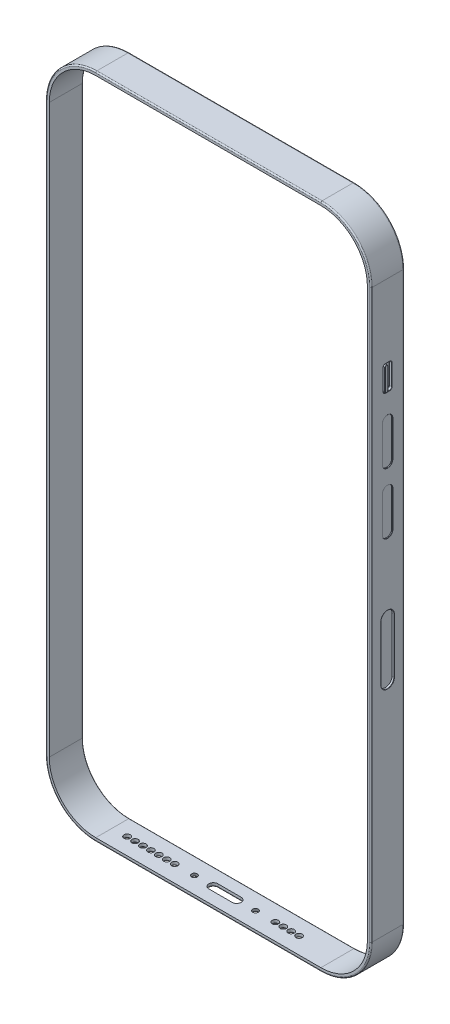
ISO-10303-21;
HEADER;
FILE_DESCRIPTION(('STEP AP214'),'2;1');
FILE_NAME('part.step','',(''),(''),'','','');
FILE_SCHEMA(('AUTOMOTIVE_DESIGN { 1 0 10303 214 1 1 1 1 }'));
ENDSEC;
DATA;
#1=APPLICATION_CONTEXT('core data for automotive mechanical design processes');
#2=APPLICATION_PROTOCOL_DEFINITION('international standard','automotive_design',2000,#1);
#3=PRODUCT_CONTEXT('',#1,'mechanical');
#4=PRODUCT('Part','Part','',(#3));
#5=PRODUCT_RELATED_PRODUCT_CATEGORY('part','',(#4));
#6=PRODUCT_DEFINITION_FORMATION('','',#4);
#7=PRODUCT_DEFINITION_CONTEXT('part definition',#1,'design');
#8=PRODUCT_DEFINITION('design','',#6,#7);
#9=PRODUCT_DEFINITION_SHAPE('','',#8);
#10=(LENGTH_UNIT() NAMED_UNIT(*) SI_UNIT(.MILLI.,.METRE.));
#11=(NAMED_UNIT(*) PLANE_ANGLE_UNIT() SI_UNIT($,.RADIAN.));
#12=(NAMED_UNIT(*) SI_UNIT($,.STERADIAN.) SOLID_ANGLE_UNIT());
#13=UNCERTAINTY_MEASURE_WITH_UNIT(LENGTH_MEASURE(1.E-05),#10,'distance_accuracy_value','');
#14=(GEOMETRIC_REPRESENTATION_CONTEXT(3) GLOBAL_UNCERTAINTY_ASSIGNED_CONTEXT((#13)) GLOBAL_UNIT_ASSIGNED_CONTEXT((#10,
#11,#12)) REPRESENTATION_CONTEXT('',''));
#15=CARTESIAN_POINT('',(0.,0.,0.));
#16=DIRECTION('',(0.,0.,1.));
#17=DIRECTION('',(1.,0.,0.));
#18=AXIS2_PLACEMENT_3D('',#15,#16,#17);
#19=CARTESIAN_POINT('',(39.25,-68.,-178.));
#20=DIRECTION('',(1.,0.,0.));
#21=DIRECTION('',(0.,0.,-1.));
#22=AXIS2_PLACEMENT_3D('',#19,#20,#21);
#23=PLANE('',#22);
#24=DIRECTION('',(0.,1.,0.));
#25=VECTOR('',#24,1.);
#26=CARTESIAN_POINT('',(39.25,-68.,4.77499999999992));
#27=LINE('',#26,#25);
#28=CARTESIAN_POINT('',(39.25,45.,4.77499999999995));
#29=VERTEX_POINT('',#28);
#30=CARTESIAN_POINT('',(39.25,50.,4.77499999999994));
#31=VERTEX_POINT('',#30);
#32=EDGE_CURVE('E5155',#29,#31,#27,.T.);
#33=ORIENTED_EDGE('',*,*,#32,.F.);
#34=CARTESIAN_POINT('',(39.25,45.,4.49999999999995));
#35=DIRECTION('',(-1.,0.,0.));
#36=DIRECTION('',(0.,0.,-1.));
#37=AXIS2_PLACEMENT_3D('',#34,#35,#36);
#38=CIRCLE('',#37,0.275);
#39=CARTESIAN_POINT('',(39.25,45.,4.22499999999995));
#40=VERTEX_POINT('',#39);
#41=EDGE_CURVE('E5165',#29,#40,#38,.F.);
#42=ORIENTED_EDGE('',*,*,#41,.T.);
#43=DIRECTION('',(0.,-1.,0.));
#44=VECTOR('',#43,1.);
#45=CARTESIAN_POINT('',(39.25,-68.,4.22499999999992));
#46=LINE('',#45,#44);
#47=CARTESIAN_POINT('',(39.25,50.,4.22499999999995));
#48=VERTEX_POINT('',#47);
#49=EDGE_CURVE('E5160',#48,#40,#46,.T.);
#50=ORIENTED_EDGE('',*,*,#49,.F.);
#51=CARTESIAN_POINT('',(39.25,50.,4.49999999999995));
#52=DIRECTION('',(-1.,0.,0.));
#53=DIRECTION('',(0.,0.,1.));
#54=AXIS2_PLACEMENT_3D('',#51,#52,#53);
#55=CIRCLE('',#54,0.27499999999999);
#56=EDGE_CURVE('E5123',#48,#31,#55,.F.);
#57=ORIENTED_EDGE('',*,*,#56,.T.);
#58=EDGE_LOOP('',(#33,#42,#50,#57));
#59=FACE_BOUND('',#58,.T.);
#60=ADVANCED_FACE('F17',(#59),#23,.T.);
#61=CARTESIAN_POINT('',(39.15,-68.,4.22499999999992));
#62=DIRECTION('',(0.,-1.,0.));
#63=DIRECTION('',(0.,0.,-1.));
#64=AXIS2_PLACEMENT_3D('',#61,#62,#63);
#65=CYLINDRICAL_SURFACE('',#64,0.1);
#66=CARTESIAN_POINT('',(39.15,50.,4.22499999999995));
#67=DIRECTION('',(0.,1.,0.));
#68=DIRECTION('',(0.,0.,-1.));
#69=AXIS2_PLACEMENT_3D('',#66,#67,#68);
#70=CIRCLE('',#69,0.1);
#71=CARTESIAN_POINT('',(39.15,50.,4.12499999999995));
#72=VERTEX_POINT('',#71);
#73=EDGE_CURVE('E5142',#48,#72,#70,.T.);
#74=ORIENTED_EDGE('',*,*,#73,.F.);
#75=ORIENTED_EDGE('',*,*,#49,.T.);
#76=CARTESIAN_POINT('',(39.15,45.,4.22499999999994));
#77=DIRECTION('',(0.,-1.,0.));
#78=DIRECTION('',(0.,0.,-1.));
#79=AXIS2_PLACEMENT_3D('',#76,#77,#78);
#80=CIRCLE('',#79,0.1);
#81=CARTESIAN_POINT('',(39.15,45.,4.12499999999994));
#82=VERTEX_POINT('',#81);
#83=EDGE_CURVE('E5163',#40,#82,#80,.F.);
#84=ORIENTED_EDGE('',*,*,#83,.T.);
#85=DIRECTION('',(0.,-1.,0.));
#86=VECTOR('',#85,1.);
#87=CARTESIAN_POINT('',(39.15,50.,4.12499999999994));
#88=LINE('',#87,#86);
#89=EDGE_CURVE('E5141',#82,#72,#88,.F.);
#90=ORIENTED_EDGE('',*,*,#89,.T.);
#91=EDGE_LOOP('',(#74,#75,#84,#90));
#92=FACE_BOUND('',#91,.T.);
#93=ADVANCED_FACE('F3814',(#92),#65,.T.);
#94=CARTESIAN_POINT('',(39.15,-68.,4.77499999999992));
#95=DIRECTION('',(0.,1.,0.));
#96=DIRECTION('',(0.,0.,1.));
#97=AXIS2_PLACEMENT_3D('',#94,#95,#96);
#98=CYLINDRICAL_SURFACE('',#97,0.1);
#99=CARTESIAN_POINT('',(39.15,50.,4.77499999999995));
#100=DIRECTION('',(0.,-1.,0.));
#101=DIRECTION('',(0.,0.,1.));
#102=AXIS2_PLACEMENT_3D('',#99,#100,#101);
#103=CIRCLE('',#102,0.1);
#104=CARTESIAN_POINT('',(39.15,50.,4.87499999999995));
#105=VERTEX_POINT('',#104);
#106=EDGE_CURVE('E5139',#105,#31,#103,.F.);
#107=ORIENTED_EDGE('',*,*,#106,.F.);
#108=DIRECTION('',(0.,1.,0.));
#109=VECTOR('',#108,1.);
#110=CARTESIAN_POINT('',(39.15,50.,4.87499999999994));
#111=LINE('',#110,#109);
#112=CARTESIAN_POINT('',(39.15,45.,4.87499999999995));
#113=VERTEX_POINT('',#112);
#114=EDGE_CURVE('E5108',#105,#113,#111,.F.);
#115=ORIENTED_EDGE('',*,*,#114,.T.);
#116=CARTESIAN_POINT('',(39.15,45.,4.77499999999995));
#117=DIRECTION('',(0.,-1.,0.));
#118=DIRECTION('',(0.,0.,1.));
#119=AXIS2_PLACEMENT_3D('',#116,#117,#118);
#120=CIRCLE('',#119,0.1);
#121=EDGE_CURVE('E5197',#29,#113,#120,.T.);
#122=ORIENTED_EDGE('',*,*,#121,.F.);
#123=ORIENTED_EDGE('',*,*,#32,.T.);
#124=EDGE_LOOP('',(#107,#115,#122,#123));
#125=FACE_BOUND('',#124,.T.);
#126=ADVANCED_FACE('F3824',(#125),#98,.T.);
#127=CARTESIAN_POINT('',(39.15,50.,4.49999999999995));
#128=DIRECTION('',(1.,0.,0.));
#129=DIRECTION('',(0.,0.,-1.));
#130=AXIS2_PLACEMENT_3D('',#127,#128,#129);
#131=TOROIDAL_SURFACE('',#130,0.275000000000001,0.1);
#132=ORIENTED_EDGE('',*,*,#106,.T.);
#133=ORIENTED_EDGE('',*,*,#56,.F.);
#134=ORIENTED_EDGE('',*,*,#73,.T.);
#135=CARTESIAN_POINT('',(39.15,50.,4.49999999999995));
#136=DIRECTION('',(-1.,0.,0.));
#137=DIRECTION('',(0.,0.,1.));
#138=AXIS2_PLACEMENT_3D('',#135,#136,#137);
#139=CIRCLE('',#138,0.375000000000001);
#140=EDGE_CURVE('E5076',#105,#72,#139,.T.);
#141=ORIENTED_EDGE('',*,*,#140,.F.);
#142=EDGE_LOOP('',(#132,#133,#134,#141));
#143=FACE_BOUND('',#142,.T.);
#144=ADVANCED_FACE('F3834',(#143),#131,.T.);
#145=CARTESIAN_POINT('',(45.2987067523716,50.,4.12499999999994));
#146=DIRECTION('',(0.,0.,1.));
#147=DIRECTION('',(0.,-1.,0.));
#148=AXIS2_PLACEMENT_3D('',#145,#146,#147);
#149=PLANE('',#148);
#150=DIRECTION('',(0.,-1.,0.));
#151=VECTOR('',#150,1.);
#152=CARTESIAN_POINT('',(38.4,50.,4.12499999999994));
#153=LINE('',#152,#151);
#154=CARTESIAN_POINT('',(38.4,45.,4.12499999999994));
#155=VERTEX_POINT('',#154);
#156=CARTESIAN_POINT('',(38.4,50.,4.12499999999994));
#157=VERTEX_POINT('',#156);
#158=EDGE_CURVE('E5075',#155,#157,#153,.F.);
#159=ORIENTED_EDGE('',*,*,#158,.T.);
#160=DIRECTION('',(-1.,0.,0.));
#161=VECTOR('',#160,1.);
#162=CARTESIAN_POINT('',(45.2987067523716,50.,4.12499999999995));
#163=LINE('',#162,#161);
#164=EDGE_CURVE('E5103',#72,#157,#163,.T.);
#165=ORIENTED_EDGE('',*,*,#164,.F.);
#166=ORIENTED_EDGE('',*,*,#89,.F.);
#167=DIRECTION('',(1.,0.,0.));
#168=VECTOR('',#167,1.);
#169=CARTESIAN_POINT('',(45.2987067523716,45.,4.12499999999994));
#170=LINE('',#169,#168);
#171=EDGE_CURVE('E5151',#155,#82,#170,.T.);
#172=ORIENTED_EDGE('',*,*,#171,.F.);
#173=EDGE_LOOP('',(#159,#165,#166,#172));
#174=FACE_BOUND('',#173,.T.);
#175=ADVANCED_FACE('F3845',(#174),#149,.F.);
#176=CARTESIAN_POINT('',(39.15,45.,4.49999999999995));
#177=DIRECTION('',(1.,0.,0.));
#178=DIRECTION('',(0.,0.,-1.));
#179=AXIS2_PLACEMENT_3D('',#176,#177,#178);
#180=TOROIDAL_SURFACE('',#179,0.275000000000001,0.1);
#181=ORIENTED_EDGE('',*,*,#83,.F.);
#182=ORIENTED_EDGE('',*,*,#41,.F.);
#183=ORIENTED_EDGE('',*,*,#121,.T.);
#184=CARTESIAN_POINT('',(39.15,45.,4.49999999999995));
#185=DIRECTION('',(-1.,0.,0.));
#186=DIRECTION('',(0.,0.,1.));
#187=AXIS2_PLACEMENT_3D('',#184,#185,#186);
#188=CIRCLE('',#187,0.375);
#189=EDGE_CURVE('E5195',#82,#113,#188,.T.);
#190=ORIENTED_EDGE('',*,*,#189,.F.);
#191=EDGE_LOOP('',(#181,#182,#183,#190));
#192=FACE_BOUND('',#191,.T.);
#193=ADVANCED_FACE('F3856',(#192),#180,.T.);
#194=CARTESIAN_POINT('',(45.2987067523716,50.,4.87499999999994));
#195=DIRECTION('',(0.,0.,-1.));
#196=DIRECTION('',(0.,1.,0.));
#197=AXIS2_PLACEMENT_3D('',#194,#195,#196);
#198=PLANE('',#197);
#199=DIRECTION('',(0.,1.,0.));
#200=VECTOR('',#199,1.);
#201=CARTESIAN_POINT('',(38.4066987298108,45.,4.87499999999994));
#202=LINE('',#201,#200);
#203=CARTESIAN_POINT('',(38.4066987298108,50.,4.87499999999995));
#204=VERTEX_POINT('',#203);
#205=CARTESIAN_POINT('',(38.4066987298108,45.,4.87499999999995));
#206=VERTEX_POINT('',#205);
#207=EDGE_CURVE('E783',#204,#206,#202,.F.);
#208=ORIENTED_EDGE('',*,*,#207,.T.);
#209=DIRECTION('',(-1.,0.,0.));
#210=VECTOR('',#209,1.);
#211=CARTESIAN_POINT('',(45.2987067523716,45.,4.87499999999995));
#212=LINE('',#211,#210);
#213=EDGE_CURVE('E906',#113,#206,#212,.T.);
#214=ORIENTED_EDGE('',*,*,#213,.F.);
#215=ORIENTED_EDGE('',*,*,#114,.F.);
#216=DIRECTION('',(-1.,0.,0.));
#217=VECTOR('',#216,1.);
#218=CARTESIAN_POINT('',(45.2987067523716,50.,4.87499999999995));
#219=LINE('',#218,#217);
#220=EDGE_CURVE('E5095',#204,#105,#219,.F.);
#221=ORIENTED_EDGE('',*,*,#220,.F.);
#222=EDGE_LOOP('',(#208,#214,#215,#221));
#223=FACE_BOUND('',#222,.T.);
#224=ADVANCED_FACE('F3867',(#223),#198,.F.);
#225=CARTESIAN_POINT('',(45.2987067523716,50.,4.49999999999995));
#226=DIRECTION('',(-1.,0.,0.));
#227=DIRECTION('',(0.,0.,1.));
#228=AXIS2_PLACEMENT_3D('',#225,#226,#227);
#229=CYLINDRICAL_SURFACE('',#228,0.375000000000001);
#230=ORIENTED_EDGE('',*,*,#220,.T.);
#231=ORIENTED_EDGE('',*,*,#140,.T.);
#232=ORIENTED_EDGE('',*,*,#164,.T.);
#233=CARTESIAN_POINT('',(38.4,50.,4.49999999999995));
#234=DIRECTION('',(-1.,0.,0.));
#235=DIRECTION('',(0.,0.,1.));
#236=AXIS2_PLACEMENT_3D('',#233,#234,#235);
#237=CIRCLE('',#236,0.375000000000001);
#238=CARTESIAN_POINT('',(38.4,50.3529411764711,4.37328170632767));
#239=VERTEX_POINT('',#238);
#240=EDGE_CURVE('E5067',#157,#239,#237,.F.);
#241=ORIENTED_EDGE('',*,*,#240,.T.);
#242=CARTESIAN_POINT('',(38.4066987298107,50.375,4.49999999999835));
#243=CARTESIAN_POINT('',(38.406698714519,50.3750000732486,4.49461977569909));
#244=CARTESIAN_POINT('',(38.4065939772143,50.3748833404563,4.48924140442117));
#245=CARTESIAN_POINT('',(38.4062276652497,50.3744182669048,4.47849358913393));
#246=CARTESIAN_POINT('',(38.4059659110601,50.3740696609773,4.47312416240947));
#247=CARTESIAN_POINT('',(38.4053379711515,50.3731422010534,4.46240427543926));
#248=CARTESIAN_POINT('',(38.4049716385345,50.3725630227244,4.45705385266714));
#249=CARTESIAN_POINT('',(38.404186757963,50.3711756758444,4.44638074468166));
#250=CARTESIAN_POINT('',(38.4037681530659,50.3703672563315,4.44105809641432));
#251=CARTESIAN_POINT('',(38.4029309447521,50.3685225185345,4.43044966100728));
#252=CARTESIAN_POINT('',(38.4025123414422,50.367486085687,4.42516389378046));
#253=CARTESIAN_POINT('',(38.4017274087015,50.365186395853,4.41463835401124));
#254=CARTESIAN_POINT('',(38.4013610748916,50.3639231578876,4.40939857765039));
#255=CARTESIAN_POINT('',(38.4007330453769,50.3611707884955,4.39897387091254));
#256=CARTESIAN_POINT('',(38.4004713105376,50.3596817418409,4.3937889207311));
#257=CARTESIAN_POINT('',(38.4001048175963,50.3564792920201,4.3834838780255));
#258=CARTESIAN_POINT('',(38.4000000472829,50.3547659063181,4.37836378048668));
#259=CARTESIAN_POINT('',(38.4,50.3529411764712,4.37328170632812));
#260=B_SPLINE_CURVE_WITH_KNOTS('',3,(#242,#243,#244,#245,#246,#247,#248,#249,#250,#251,#252,
#253,#254,#255,#256,#257,#258,#259),.UNSPECIFIED.,.F.,.F.,(4,2,2,2,2,2,2,2,4),(0.,
0.0161357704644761,0.0322900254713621,0.0484670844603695,0.0646619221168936,0.0808649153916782,
0.0970665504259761,0.113262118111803,0.129456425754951),.UNSPECIFIED.);
#261=CARTESIAN_POINT('',(38.4066987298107,50.375,4.49999999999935));
#262=VERTEX_POINT('',#261);
#263=EDGE_CURVE('E2800',#239,#262,#260,.F.);
#264=ORIENTED_EDGE('',*,*,#263,.T.);
#265=CARTESIAN_POINT('',(38.4066987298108,50.,4.49999999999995));
#266=DIRECTION('',(1.,0.,0.));
#267=DIRECTION('',(0.,0.,-1.));
#268=AXIS2_PLACEMENT_3D('',#265,#266,#267);
#269=CIRCLE('',#268,0.375000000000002);
#270=EDGE_CURVE('E2796',#262,#204,#269,.T.);
#271=ORIENTED_EDGE('',*,*,#270,.T.);
#272=EDGE_LOOP('',(#230,#231,#232,#241,#264,#271));
#273=FACE_BOUND('',#272,.T.);
#274=ADVANCED_FACE('F3878',(#273),#229,.T.);
#275=CARTESIAN_POINT('',(38.4,50.,4.49999999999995));
#276=DIRECTION('',(-1.,0.,0.));
#277=DIRECTION('',(0.,0.,1.));
#278=AXIS2_PLACEMENT_3D('',#275,#276,#277);
#279=TOROIDAL_SURFACE('',#278,0.425000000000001,0.05);
#280=CARTESIAN_POINT('',(38.35,50.,4.49999999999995));
#281=DIRECTION('',(1.,0.,0.));
#282=DIRECTION('',(0.,0.,-1.));
#283=AXIS2_PLACEMENT_3D('',#280,#281,#282);
#284=CIRCLE('',#283,0.425000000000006);
#285=CARTESIAN_POINT('',(38.35,50.,4.07499999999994));
#286=VERTEX_POINT('',#285);
#287=CARTESIAN_POINT('',(38.35,50.3999999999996,4.35638593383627));
#288=VERTEX_POINT('',#287);
#289=EDGE_CURVE('E2803',#286,#288,#284,.T.);
#290=ORIENTED_EDGE('',*,*,#289,.T.);
#291=CARTESIAN_POINT('',(38.4,50.4000000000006,4.35638593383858));
#292=DIRECTION('',(4.60871872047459E-12,0.337915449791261,0.941176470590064));
#293=DIRECTION('',(0.,-0.941176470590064,0.337915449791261));
#294=AXIS2_PLACEMENT_3D('',#291,#292,#293);
#295=CIRCLE('',#294,0.0499999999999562);
#296=EDGE_CURVE('E2799',#288,#239,#295,.T.);
#297=ORIENTED_EDGE('',*,*,#296,.T.);
#298=ORIENTED_EDGE('',*,*,#240,.F.);
#299=CARTESIAN_POINT('',(38.4,50.,4.07499999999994));
#300=DIRECTION('',(0.,-1.,0.));
#301=DIRECTION('',(0.,0.,-1.));
#302=AXIS2_PLACEMENT_3D('',#299,#300,#301);
#303=CIRCLE('',#302,0.0499999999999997);
#304=EDGE_CURVE('E5217',#157,#286,#303,.T.);
#305=ORIENTED_EDGE('',*,*,#304,.T.);
#306=EDGE_LOOP('',(#290,#297,#298,#305));
#307=FACE_BOUND('',#306,.T.);
#308=ADVANCED_FACE('F3889',(#307),#279,.F.);
#309=CARTESIAN_POINT('',(38.4,50.,4.07499999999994));
#310=DIRECTION('',(0.,-1.,0.));
#311=DIRECTION('',(0.,0.,-1.));
#312=AXIS2_PLACEMENT_3D('',#309,#310,#311);
#313=CYLINDRICAL_SURFACE('',#312,0.0499999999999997);
#314=ORIENTED_EDGE('',*,*,#158,.F.);
#315=CARTESIAN_POINT('',(38.4,45.,4.07499999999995));
#316=DIRECTION('',(0.,-1.,0.));
#317=DIRECTION('',(0.,0.,-1.));
#318=AXIS2_PLACEMENT_3D('',#315,#316,#317);
#319=CIRCLE('',#318,0.05);
#320=CARTESIAN_POINT('',(38.35,45.,4.07499999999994));
#321=VERTEX_POINT('',#320);
#322=EDGE_CURVE('E908',#155,#321,#319,.T.);
#323=ORIENTED_EDGE('',*,*,#322,.T.);
#324=DIRECTION('',(0.,1.,0.));
#325=VECTOR('',#324,1.);
#326=CARTESIAN_POINT('',(38.35,45.,4.07499999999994));
#327=LINE('',#326,#325);
#328=EDGE_CURVE('E915',#321,#286,#327,.T.);
#329=ORIENTED_EDGE('',*,*,#328,.T.);
#330=ORIENTED_EDGE('',*,*,#304,.F.);
#331=EDGE_LOOP('',(#314,#323,#329,#330));
#332=FACE_BOUND('',#331,.T.);
#333=ADVANCED_FACE('F898',(#332),#313,.F.);
#334=CARTESIAN_POINT('',(38.4,45.,4.49999999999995));
#335=DIRECTION('',(-1.,0.,0.));
#336=DIRECTION('',(0.,0.,1.));
#337=AXIS2_PLACEMENT_3D('',#334,#335,#336);
#338=TOROIDAL_SURFACE('',#337,0.425000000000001,0.05);
#339=CARTESIAN_POINT('',(38.4,45.,4.49999999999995));
#340=DIRECTION('',(-1.,0.,0.));
#341=DIRECTION('',(0.,0.,1.));
#342=AXIS2_PLACEMENT_3D('',#339,#340,#341);
#343=CIRCLE('',#342,0.375);
#344=CARTESIAN_POINT('',(38.4,44.6470588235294,4.37328170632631));
#345=VERTEX_POINT('',#344);
#346=EDGE_CURVE('E879',#345,#155,#343,.F.);
#347=ORIENTED_EDGE('',*,*,#346,.F.);
#348=CARTESIAN_POINT('',(38.4,44.6,4.35638593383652));
#349=DIRECTION('',(-5.32043627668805E-13,-0.337915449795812,0.94117647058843));
#350=DIRECTION('',(0.,-0.94117647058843,-0.337915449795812));
#351=AXIS2_PLACEMENT_3D('',#348,#349,#350);
#352=CIRCLE('',#351,0.0499999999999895);
#353=CARTESIAN_POINT('',(38.35,44.6000000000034,4.35638593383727));
#354=VERTEX_POINT('',#353);
#355=EDGE_CURVE('E836',#345,#354,#352,.T.);
#356=ORIENTED_EDGE('',*,*,#355,.T.);
#357=CARTESIAN_POINT('',(38.35,45.,4.49999999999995));
#358=DIRECTION('',(1.,0.,0.));
#359=DIRECTION('',(0.,-0.941176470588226,-0.33791544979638));
#360=AXIS2_PLACEMENT_3D('',#357,#358,#359);
#361=CIRCLE('',#360,0.425000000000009);
#362=EDGE_CURVE('E917',#354,#321,#361,.T.);
#363=ORIENTED_EDGE('',*,*,#362,.T.);
#364=ORIENTED_EDGE('',*,*,#322,.F.);
#365=EDGE_LOOP('',(#347,#356,#363,#364));
#366=FACE_BOUND('',#365,.T.);
#367=ADVANCED_FACE('F892',(#366),#338,.F.);
#368=CARTESIAN_POINT('',(45.2987067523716,45.,4.49999999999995));
#369=DIRECTION('',(-1.,0.,0.));
#370=DIRECTION('',(0.,0.,1.));
#371=AXIS2_PLACEMENT_3D('',#368,#369,#370);
#372=CYLINDRICAL_SURFACE('',#371,0.375);
#373=ORIENTED_EDGE('',*,*,#171,.T.);
#374=ORIENTED_EDGE('',*,*,#189,.T.);
#375=ORIENTED_EDGE('',*,*,#213,.T.);
#376=CARTESIAN_POINT('',(38.4066987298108,45.,4.49999999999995));
#377=DIRECTION('',(1.,0.,0.));
#378=DIRECTION('',(0.,0.,-1.));
#379=AXIS2_PLACEMENT_3D('',#376,#377,#378);
#380=CIRCLE('',#379,0.375000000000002);
#381=CARTESIAN_POINT('',(38.4066987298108,44.625,4.49999999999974));
#382=VERTEX_POINT('',#381);
#383=EDGE_CURVE('E814',#206,#382,#380,.T.);
#384=ORIENTED_EDGE('',*,*,#383,.T.);
#385=CARTESIAN_POINT('',(38.4002140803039,44.6516522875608,4.36115697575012));
#386=CARTESIAN_POINT('',(38.3984469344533,44.6324243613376,4.4093520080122));
#387=CARTESIAN_POINT('',(38.4082526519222,44.6234298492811,4.46130820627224));
#388=CARTESIAN_POINT('',(38.4064843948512,44.6252241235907,4.51290409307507));
#389=(BOUNDED_CURVE() B_SPLINE_CURVE(3,(#385,#386,#387,#388),.UNSPECIFIED.,.F.,
.F.) B_SPLINE_CURVE_WITH_KNOTS((4,4),(0.000569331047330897,0.000744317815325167),
.UNSPECIFIED.) CURVE() GEOMETRIC_REPRESENTATION_ITEM() RATIONAL_B_SPLINE_CURVE((0.999999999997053,
0.999999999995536,0.999999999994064,0.999999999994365)) REPRESENTATION_ITEM(''));
#390=EDGE_CURVE('E874',#382,#345,#389,.F.);
#391=ORIENTED_EDGE('',*,*,#390,.T.);
#392=ORIENTED_EDGE('',*,*,#346,.T.);
#393=EDGE_LOOP('',(#373,#374,#375,#384,#391,#392));
#394=FACE_BOUND('',#393,.T.);
#395=ADVANCED_FACE('F881',(#394),#372,.T.);
#396=CARTESIAN_POINT('',(-38.75,-31.965,3.99999999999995));
#397=DIRECTION('',(-1.,0.,0.));
#398=DIRECTION('',(0.,-1.,0.));
#399=AXIS2_PLACEMENT_3D('',#396,#397,#398);
#400=PLANE('',#399);
#401=CARTESIAN_POINT('',(-38.75,-31.965,3.99999999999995));
#402=DIRECTION('',(1.,0.,0.));
#403=DIRECTION('',(0.,0.,1.));
#404=AXIS2_PLACEMENT_3D('',#401,#402,#403);
#405=CIRCLE('',#404,1.825);
#406=CARTESIAN_POINT('',(-38.75,-31.965,2.17499999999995));
#407=VERTEX_POINT('',#406);
#408=CARTESIAN_POINT('',(-38.75,-31.965,5.82499999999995));
#409=VERTEX_POINT('',#408);
#410=EDGE_CURVE('E778',#407,#409,#405,.F.);
#411=ORIENTED_EDGE('',*,*,#410,.T.);
#412=DIRECTION('',(0.,1.,0.));
#413=VECTOR('',#412,1.);
#414=CARTESIAN_POINT('',(-38.75,-31.965,5.82499999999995));
#415=LINE('',#414,#413);
#416=CARTESIAN_POINT('',(-38.75,-14.265,5.82499999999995));
#417=VERTEX_POINT('',#416);
#418=EDGE_CURVE('E699',#409,#417,#415,.T.);
#419=ORIENTED_EDGE('',*,*,#418,.T.);
#420=CARTESIAN_POINT('',(-38.75,-14.265,3.99999999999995));
#421=DIRECTION('',(1.,0.,0.));
#422=DIRECTION('',(0.,0.,-1.));
#423=AXIS2_PLACEMENT_3D('',#420,#421,#422);
#424=CIRCLE('',#423,1.825);
#425=CARTESIAN_POINT('',(-38.75,-14.265,2.17499999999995));
#426=VERTEX_POINT('',#425);
#427=EDGE_CURVE('E4412',#417,#426,#424,.F.);
#428=ORIENTED_EDGE('',*,*,#427,.T.);
#429=DIRECTION('',(0.,-1.,0.));
#430=VECTOR('',#429,1.);
#431=CARTESIAN_POINT('',(-38.75,-31.965,2.17499999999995));
#432=LINE('',#431,#430);
#433=EDGE_CURVE('E4419',#426,#407,#432,.T.);
#434=ORIENTED_EDGE('',*,*,#433,.T.);
#435=EDGE_LOOP('',(#411,#419,#428,#434));
#436=FACE_BOUND('',#435,.T.);
#437=ADVANCED_FACE('F891',(#436),#400,.T.);
#438=CARTESIAN_POINT('',(-39.35,19.28,3.99999999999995));
#439=DIRECTION('',(-1.,0.,0.));
#440=DIRECTION('',(0.,-1.,0.));
#441=AXIS2_PLACEMENT_3D('',#438,#439,#440);
#442=PLANE('',#441);
#443=CARTESIAN_POINT('',(-39.35,19.28,3.99999999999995));
#444=DIRECTION('',(1.,0.,0.));
#445=DIRECTION('',(0.,0.,1.));
#446=AXIS2_PLACEMENT_3D('',#443,#444,#445);
#447=CIRCLE('',#446,1.14);
#448=CARTESIAN_POINT('',(-39.35,19.28,5.13999999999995));
#449=VERTEX_POINT('',#448);
#450=CARTESIAN_POINT('',(-39.35,19.28,2.85999999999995));
#451=VERTEX_POINT('',#450);
#452=EDGE_CURVE('E694',#449,#451,#447,.T.);
#453=ORIENTED_EDGE('',*,*,#452,.F.);
#454=DIRECTION('',(0.,-1.,0.));
#455=VECTOR('',#454,1.);
#456=CARTESIAN_POINT('',(-39.35,19.28,5.13999999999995));
#457=LINE('',#456,#455);
#458=CARTESIAN_POINT('',(-39.35,34.27,5.13999999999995));
#459=VERTEX_POINT('',#458);
#460=EDGE_CURVE('E652',#459,#449,#457,.T.);
#461=ORIENTED_EDGE('',*,*,#460,.F.);
#462=CARTESIAN_POINT('',(-39.35,34.27,3.99999999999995));
#463=DIRECTION('',(1.,0.,0.));
#464=DIRECTION('',(0.,0.,-1.));
#465=AXIS2_PLACEMENT_3D('',#462,#463,#464);
#466=CIRCLE('',#465,1.14);
#467=CARTESIAN_POINT('',(-39.35,34.27,2.85999999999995));
#468=VERTEX_POINT('',#467);
#469=EDGE_CURVE('E647',#468,#459,#466,.T.);
#470=ORIENTED_EDGE('',*,*,#469,.F.);
#471=DIRECTION('',(0.,1.,0.));
#472=VECTOR('',#471,1.);
#473=CARTESIAN_POINT('',(-39.35,19.28,2.85999999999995));
#474=LINE('',#473,#472);
#475=EDGE_CURVE('E680',#451,#468,#474,.T.);
#476=ORIENTED_EDGE('',*,*,#475,.F.);
#477=EDGE_LOOP('',(#453,#461,#470,#476));
#478=FACE_BOUND('',#477,.T.);
#479=ADVANCED_FACE('F2827',(#478),#442,.T.);
#480=CARTESIAN_POINT('',(38.4066987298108,45.,4.92499999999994));
#481=DIRECTION('',(0.,1.,0.));
#482=DIRECTION('',(0.,0.,1.));
#483=AXIS2_PLACEMENT_3D('',#480,#481,#482);
#484=CYLINDRICAL_SURFACE('',#483,0.0499999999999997);
#485=DIRECTION('',(0.,1.,0.));
#486=VECTOR('',#485,1.);
#487=CARTESIAN_POINT('',(38.3633974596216,45.,4.94999999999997));
#488=LINE('',#487,#486);
#489=CARTESIAN_POINT('',(38.3633974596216,50.,4.94999999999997));
#490=VERTEX_POINT('',#489);
#491=CARTESIAN_POINT('',(38.3633974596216,45.,4.94999999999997));
#492=VERTEX_POINT('',#491);
#493=EDGE_CURVE('E821',#490,#492,#488,.F.);
#494=ORIENTED_EDGE('',*,*,#493,.T.);
#495=CARTESIAN_POINT('',(38.4066987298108,45.,4.92499999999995));
#496=DIRECTION('',(0.,-1.,0.));
#497=DIRECTION('',(0.,0.,1.));
#498=AXIS2_PLACEMENT_3D('',#495,#496,#497);
#499=CIRCLE('',#498,0.05);
#500=EDGE_CURVE('E813',#492,#206,#499,.T.);
#501=ORIENTED_EDGE('',*,*,#500,.T.);
#502=ORIENTED_EDGE('',*,*,#207,.F.);
#503=CARTESIAN_POINT('',(38.4066987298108,50.,4.92499999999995));
#504=DIRECTION('',(0.,-1.,0.));
#505=DIRECTION('',(0.,0.,1.));
#506=AXIS2_PLACEMENT_3D('',#503,#504,#505);
#507=CIRCLE('',#506,0.05);
#508=EDGE_CURVE('E2805',#204,#490,#507,.F.);
#509=ORIENTED_EDGE('',*,*,#508,.T.);
#510=EDGE_LOOP('',(#494,#501,#502,#509));
#511=FACE_BOUND('',#510,.T.);
#512=ADVANCED_FACE('F2822',(#511),#484,.F.);
#513=CARTESIAN_POINT('',(38.4066987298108,50.,4.49999999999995));
#514=DIRECTION('',(1.,0.,0.));
#515=DIRECTION('',(0.,0.,-1.));
#516=AXIS2_PLACEMENT_3D('',#513,#514,#515);
#517=TOROIDAL_SURFACE('',#516,0.425000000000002,0.05);
#518=CARTESIAN_POINT('',(38.3633974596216,50.,4.49999999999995));
#519=DIRECTION('',(-1.,0.,0.));
#520=DIRECTION('',(0.,0.,1.));
#521=AXIS2_PLACEMENT_3D('',#518,#519,#520);
#522=CIRCLE('',#521,0.450000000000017);
#523=CARTESIAN_POINT('',(38.3633974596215,50.45,4.49999999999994));
#524=VERTEX_POINT('',#523);
#525=EDGE_CURVE('E824',#524,#490,#522,.F.);
#526=ORIENTED_EDGE('',*,*,#525,.T.);
#527=ORIENTED_EDGE('',*,*,#508,.F.);
#528=ORIENTED_EDGE('',*,*,#270,.F.);
#529=CARTESIAN_POINT('',(38.4066987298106,50.425,4.49999999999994));
#530=DIRECTION('',(0.,0.,-1.));
#531=DIRECTION('',(-1.,0.,0.));
#532=AXIS2_PLACEMENT_3D('',#529,#530,#531);
#533=CIRCLE('',#532,0.0499999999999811);
#534=EDGE_CURVE('E2793',#262,#524,#533,.T.);
#535=ORIENTED_EDGE('',*,*,#534,.T.);
#536=EDGE_LOOP('',(#526,#527,#528,#535));
#537=FACE_BOUND('',#536,.T.);
#538=ADVANCED_FACE('F2794',(#537),#517,.F.);
#539=CARTESIAN_POINT('',(38.4002140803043,50.3483477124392,4.36115697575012));
#540=CARTESIAN_POINT('',(38.354679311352,50.347748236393,4.35944154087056));
#541=CARTESIAN_POINT('',(38.3504257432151,50.3896097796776,4.34262154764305));
#542=CARTESIAN_POINT('',(38.3984469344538,50.3675756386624,4.4093520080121));
#543=CARTESIAN_POINT('',(38.3313029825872,50.3745210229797,4.42797880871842));
#544=CARTESIAN_POINT('',(38.3469006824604,50.4332331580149,4.39729281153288));
#545=CARTESIAN_POINT('',(38.4082526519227,50.3765701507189,4.46130820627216));
#546=CARTESIAN_POINT('',(38.3169580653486,50.3754605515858,4.47022903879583));
#547=CARTESIAN_POINT('',(38.3665279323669,50.453589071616,4.4561062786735));
#548=CARTESIAN_POINT('',(38.4064843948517,50.3747758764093,4.5129040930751));
#549=CARTESIAN_POINT('',(38.3204285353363,50.3749254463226,4.50999878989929));
#550=CARTESIAN_POINT('',(38.3629888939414,50.4495280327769,4.5146357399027));
#551=(BOUNDED_SURFACE() B_SPLINE_SURFACE(3,2,((#539,#540,#541),(#542,#543,#544),(#545,#546,
#547),(#548,#549,#550)),.UNSPECIFIED.,.F.,.F.,.F.) B_SPLINE_SURFACE_WITH_KNOTS((4,4),(3,3),
(0.000569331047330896,0.000744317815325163),(0.,1.0004712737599),
.UNSPECIFIED.) GEOMETRIC_REPRESENTATION_ITEM() RATIONAL_B_SPLINE_SURFACE(((1.,0.740231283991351,
1.00024484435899),(1.,0.606500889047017,1.00037089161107),(1.,0.476700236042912,
1.00049323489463),(1.,0.503227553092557,1.00046823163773))) REPRESENTATION_ITEM('') SURFACE());
#552=CARTESIAN_POINT('',(38.3504287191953,50.3895805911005,4.34263327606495));
#553=CARTESIAN_POINT('',(38.346891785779,50.4331996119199,4.39731033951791));
#554=CARTESIAN_POINT('',(38.3665056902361,50.4535539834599,4.45611261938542));
#555=CARTESIAN_POINT('',(38.3629687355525,50.4494926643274,4.514633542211));
#556=(BOUNDED_CURVE() B_SPLINE_CURVE(3,(#552,#553,#554,#555),.UNSPECIFIED.,.F.,
.F.) B_SPLINE_CURVE_WITH_KNOTS((4,4),(0.000569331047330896,0.000744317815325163),
.UNSPECIFIED.) CURVE() GEOMETRIC_REPRESENTATION_ITEM() RATIONAL_B_SPLINE_CURVE((1.00000000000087,
1.00000000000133,1.00000000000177,1.00000000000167)) REPRESENTATION_ITEM(''));
#557=EDGE_CURVE('E985',#288,#524,#556,.T.);
#558=ORIENTED_EDGE('',*,*,#557,.T.);
#559=ORIENTED_EDGE('',*,*,#534,.F.);
#560=ORIENTED_EDGE('',*,*,#263,.F.);
#561=ORIENTED_EDGE('',*,*,#296,.F.);
#562=EDGE_LOOP('',(#558,#559,#560,#561));
#563=FACE_BOUND('',#562,.T.);
#564=ADVANCED_FACE('F2821',(#563),#551,.F.);
#565=CARTESIAN_POINT('',(38.35,45.,4.49999999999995));
#566=DIRECTION('',(-1.,0.,0.));
#567=DIRECTION('',(0.,0.,1.));
#568=AXIS2_PLACEMENT_3D('',#565,#566,#567);
#569=PLANE('',#568);
#570=ORIENTED_EDGE('',*,*,#362,.F.);
#571=DIRECTION('',(0.,0.,1.));
#572=VECTOR('',#571,1.);
#573=CARTESIAN_POINT('',(38.35,44.6,4.49999999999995));
#574=LINE('',#573,#572);
#575=CARTESIAN_POINT('',(38.35,44.6,3.49999999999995));
#576=VERTEX_POINT('',#575);
#577=EDGE_CURVE('E922',#576,#354,#574,.T.);
#578=ORIENTED_EDGE('',*,*,#577,.F.);
#579=CARTESIAN_POINT('',(38.35,45.,3.49999999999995));
#580=DIRECTION('',(-1.,0.,0.));
#581=DIRECTION('',(0.,0.,-1.));
#582=AXIS2_PLACEMENT_3D('',#579,#580,#581);
#583=CIRCLE('',#582,0.399999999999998);
#584=CARTESIAN_POINT('',(38.35,45.,3.09999999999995));
#585=VERTEX_POINT('',#584);
#586=EDGE_CURVE('E931',#585,#576,#583,.T.);
#587=ORIENTED_EDGE('',*,*,#586,.F.);
#588=DIRECTION('',(0.,-1.,0.));
#589=VECTOR('',#588,1.);
#590=CARTESIAN_POINT('',(38.35,45.,3.09999999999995));
#591=LINE('',#590,#589);
#592=CARTESIAN_POINT('',(38.35,50.,3.09999999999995));
#593=VERTEX_POINT('',#592);
#594=EDGE_CURVE('E970',#585,#593,#591,.F.);
#595=ORIENTED_EDGE('',*,*,#594,.T.);
#596=CARTESIAN_POINT('',(38.35,50.,3.49999999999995));
#597=DIRECTION('',(-1.,0.,0.));
#598=DIRECTION('',(0.,1.,0.));
#599=AXIS2_PLACEMENT_3D('',#596,#597,#598);
#600=CIRCLE('',#599,0.399999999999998);
#601=CARTESIAN_POINT('',(38.35,50.4,3.49999999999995));
#602=VERTEX_POINT('',#601);
#603=EDGE_CURVE('E939',#593,#602,#600,.F.);
#604=ORIENTED_EDGE('',*,*,#603,.T.);
#605=DIRECTION('',(0.,0.,-1.));
#606=VECTOR('',#605,1.);
#607=CARTESIAN_POINT('',(38.35,50.4,4.49999999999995));
#608=LINE('',#607,#606);
#609=EDGE_CURVE('E1000',#602,#288,#608,.F.);
#610=ORIENTED_EDGE('',*,*,#609,.T.);
#611=ORIENTED_EDGE('',*,*,#289,.F.);
#612=ORIENTED_EDGE('',*,*,#328,.F.);
#613=EDGE_LOOP('',(#570,#578,#587,#595,#604,#610,#611,#612));
#614=FACE_BOUND('',#613,.T.);
#615=ADVANCED_FACE('F849',(#614),#569,.F.);
#616=CARTESIAN_POINT('',(38.3504104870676,44.6102373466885,4.34256013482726));
#617=CARTESIAN_POINT('',(38.3545273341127,44.6522537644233,4.35943581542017));
#618=CARTESIAN_POINT('',(38.4002140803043,44.6516522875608,4.36115697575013));
#619=CARTESIAN_POINT('',(38.3469477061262,44.5665914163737,4.39720098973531));
#620=CARTESIAN_POINT('',(38.3310292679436,44.6254506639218,4.42805474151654));
#621=CARTESIAN_POINT('',(38.3984469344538,44.6324243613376,4.40935200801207));
#622=CARTESIAN_POINT('',(38.3666447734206,44.5462276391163,4.45607309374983));
#623=CARTESIAN_POINT('',(38.3164840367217,44.6245452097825,4.47027535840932));
#624=CARTESIAN_POINT('',(38.4082526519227,44.6234298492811,4.46130820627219));
#625=CARTESIAN_POINT('',(38.3630948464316,44.5502871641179,4.51464724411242));
#626=CARTESIAN_POINT('',(38.3200053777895,44.6250738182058,4.50998450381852));
#627=CARTESIAN_POINT('',(38.4064843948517,44.6252241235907,4.51290409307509));
#628=(BOUNDED_SURFACE() B_SPLINE_SURFACE(3,2,((#616,#617,#618),(#619,#620,#621),(#622,#623,
#624),(#625,#626,#627)),.UNSPECIFIED.,.F.,.F.,.F.) B_SPLINE_SURFACE_WITH_KNOTS((4,4),(3,3),
(0.000569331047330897,0.000744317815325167),(-0.00294089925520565,1.),
.UNSPECIFIED.) GEOMETRIC_REPRESENTATION_ITEM() RATIONAL_B_SPLINE_SURFACE(((1.00153167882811,
0.739590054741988,1.),(1.00232019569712,0.605529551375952,1.),(1.00308554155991,
0.475408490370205,1.),(1.00292912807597,0.502001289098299,1.))) REPRESENTATION_ITEM('') SURFACE());
#629=CARTESIAN_POINT('',(38.4066987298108,44.575,4.49999999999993));
#630=DIRECTION('',(0.,0.,-1.));
#631=DIRECTION('',(0.,-1.,0.));
#632=AXIS2_PLACEMENT_3D('',#629,#630,#631);
#633=CIRCLE('',#632,0.05);
#634=CARTESIAN_POINT('',(38.3633974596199,44.5500000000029,4.49999999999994));
#635=VERTEX_POINT('',#634);
#636=EDGE_CURVE('E810',#382,#635,#633,.F.);
#637=CARTESIAN_POINT('',(38.3629687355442,44.5505073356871,4.51463354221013));
#638=CARTESIAN_POINT('',(38.366505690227,44.5464460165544,4.45611261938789));
#639=CARTESIAN_POINT('',(38.3468917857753,44.5668003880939,4.39731033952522));
#640=CARTESIAN_POINT('',(38.3504287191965,44.6104194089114,4.3426332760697));
#641=(BOUNDED_CURVE() B_SPLINE_CURVE(3,(#637,#638,#639,#640),.UNSPECIFIED.,.F.,
.F.) B_SPLINE_CURVE_WITH_KNOTS((4,4),(0.000569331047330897,0.000744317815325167),
.UNSPECIFIED.) CURVE() GEOMETRIC_REPRESENTATION_ITEM() RATIONAL_B_SPLINE_CURVE((0.999999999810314,
0.999999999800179,0.999999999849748,0.999999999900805)) REPRESENTATION_ITEM(''));
#642=EDGE_CURVE('E831',#635,#354,#641,.T.);
#643=ORIENTED_EDGE('',*,*,#390,.F.);
#644=ORIENTED_EDGE('',*,*,#636,.T.);
#645=ORIENTED_EDGE('',*,*,#642,.T.);
#646=ORIENTED_EDGE('',*,*,#355,.F.);
#647=EDGE_LOOP('',(#643,#644,#645,#646));
#648=FACE_BOUND('',#647,.T.);
#649=ADVANCED_FACE('F838',(#648),#628,.F.);
#650=CARTESIAN_POINT('',(38.4066987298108,45.,4.49999999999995));
#651=DIRECTION('',(1.,0.,0.));
#652=DIRECTION('',(0.,0.,-1.));
#653=AXIS2_PLACEMENT_3D('',#650,#651,#652);
#654=TOROIDAL_SURFACE('',#653,0.425000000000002,0.05);
#655=CARTESIAN_POINT('',(38.3633974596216,45.,4.49999999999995));
#656=DIRECTION('',(-1.,0.,0.));
#657=DIRECTION('',(0.,0.,1.));
#658=AXIS2_PLACEMENT_3D('',#655,#656,#657);
#659=CIRCLE('',#658,0.450000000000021);
#660=EDGE_CURVE('E803',#492,#635,#659,.F.);
#661=ORIENTED_EDGE('',*,*,#660,.T.);
#662=ORIENTED_EDGE('',*,*,#636,.F.);
#663=ORIENTED_EDGE('',*,*,#383,.F.);
#664=ORIENTED_EDGE('',*,*,#500,.F.);
#665=EDGE_LOOP('',(#661,#662,#663,#664));
#666=FACE_BOUND('',#665,.T.);
#667=ADVANCED_FACE('F795',(#666),#654,.F.);
#668=CARTESIAN_POINT('',(-38.8,-31.965,3.99999999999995));
#669=DIRECTION('',(-1.,0.,0.));
#670=DIRECTION('',(0.,-1.,0.));
#671=AXIS2_PLACEMENT_3D('',#668,#669,#670);
#672=TOROIDAL_SURFACE('',#671,1.825,0.05);
#673=CARTESIAN_POINT('',(-38.8,-31.965,2.17499999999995));
#674=DIRECTION('',(0.,-1.,0.));
#675=DIRECTION('',(1.,0.,0.));
#676=AXIS2_PLACEMENT_3D('',#673,#674,#675);
#677=CIRCLE('',#676,0.0500000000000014);
#678=CARTESIAN_POINT('',(-38.8,-31.965,2.12499999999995));
#679=VERTEX_POINT('',#678);
#680=EDGE_CURVE('E4418',#407,#679,#677,.F.);
#681=ORIENTED_EDGE('',*,*,#680,.T.);
#682=CARTESIAN_POINT('',(-38.8,-31.965,3.99999999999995));
#683=DIRECTION('',(-1.,0.,0.));
#684=DIRECTION('',(0.,-1.,0.));
#685=AXIS2_PLACEMENT_3D('',#682,#683,#684);
#686=CIRCLE('',#685,1.875);
#687=CARTESIAN_POINT('',(-38.8,-31.965,5.87499999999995));
#688=VERTEX_POINT('',#687);
#689=EDGE_CURVE('E718',#679,#688,#686,.T.);
#690=ORIENTED_EDGE('',*,*,#689,.T.);
#691=CARTESIAN_POINT('',(-38.8,-31.965,5.82499999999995));
#692=DIRECTION('',(0.,1.,0.));
#693=DIRECTION('',(-1.,0.,0.));
#694=AXIS2_PLACEMENT_3D('',#691,#692,#693);
#695=CIRCLE('',#694,0.0500000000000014);
#696=EDGE_CURVE('E738',#688,#409,#695,.T.);
#697=ORIENTED_EDGE('',*,*,#696,.T.);
#698=ORIENTED_EDGE('',*,*,#410,.F.);
#699=EDGE_LOOP('',(#681,#690,#697,#698));
#700=FACE_BOUND('',#699,.T.);
#701=ADVANCED_FACE('F785',(#700),#672,.F.);
#702=CARTESIAN_POINT('',(-38.8,-31.965,2.17499999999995));
#703=DIRECTION('',(0.,-1.,0.));
#704=DIRECTION('',(1.,0.,0.));
#705=AXIS2_PLACEMENT_3D('',#702,#703,#704);
#706=CYLINDRICAL_SURFACE('',#705,0.0500000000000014);
#707=DIRECTION('',(0.,1.,0.));
#708=VECTOR('',#707,1.);
#709=CARTESIAN_POINT('',(-38.8,-31.965,2.12499999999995));
#710=LINE('',#709,#708);
#711=CARTESIAN_POINT('',(-38.8,-14.265,2.12499999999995));
#712=VERTEX_POINT('',#711);
#713=EDGE_CURVE('E721',#712,#679,#710,.F.);
#714=ORIENTED_EDGE('',*,*,#713,.T.);
#715=ORIENTED_EDGE('',*,*,#680,.F.);
#716=ORIENTED_EDGE('',*,*,#433,.F.);
#717=CARTESIAN_POINT('',(-38.8,-14.265,2.17499999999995));
#718=DIRECTION('',(0.,-1.,0.));
#719=DIRECTION('',(0.,0.,-1.));
#720=AXIS2_PLACEMENT_3D('',#717,#718,#719);
#721=CIRCLE('',#720,0.05);
#722=EDGE_CURVE('E754',#426,#712,#721,.F.);
#723=ORIENTED_EDGE('',*,*,#722,.T.);
#724=EDGE_LOOP('',(#714,#715,#716,#723));
#725=FACE_BOUND('',#724,.T.);
#726=ADVANCED_FACE('F760',(#725),#706,.F.);
#727=CARTESIAN_POINT('',(-38.8,-14.265,3.99999999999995));
#728=DIRECTION('',(-1.,0.,0.));
#729=DIRECTION('',(0.,1.,0.));
#730=AXIS2_PLACEMENT_3D('',#727,#728,#729);
#731=TOROIDAL_SURFACE('',#730,1.825,0.05);
#732=CARTESIAN_POINT('',(-38.8,-14.265,3.99999999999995));
#733=DIRECTION('',(-1.,0.,0.));
#734=DIRECTION('',(0.,-1.,0.));
#735=AXIS2_PLACEMENT_3D('',#732,#733,#734);
#736=CIRCLE('',#735,1.875);
#737=CARTESIAN_POINT('',(-38.8,-14.265,5.87499999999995));
#738=VERTEX_POINT('',#737);
#739=EDGE_CURVE('E732',#738,#712,#736,.T.);
#740=ORIENTED_EDGE('',*,*,#739,.T.);
#741=ORIENTED_EDGE('',*,*,#722,.F.);
#742=ORIENTED_EDGE('',*,*,#427,.F.);
#743=CARTESIAN_POINT('',(-38.8,-14.265,5.82499999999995));
#744=DIRECTION('',(0.,1.,0.));
#745=DIRECTION('',(-1.,0.,0.));
#746=AXIS2_PLACEMENT_3D('',#743,#744,#745);
#747=CIRCLE('',#746,0.0500000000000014);
#748=EDGE_CURVE('E741',#417,#738,#747,.F.);
#749=ORIENTED_EDGE('',*,*,#748,.T.);
#750=EDGE_LOOP('',(#740,#741,#742,#749));
#751=FACE_BOUND('',#750,.T.);
#752=ADVANCED_FACE('F756',(#751),#731,.F.);
#753=CARTESIAN_POINT('',(-38.8,-31.965,5.82499999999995));
#754=DIRECTION('',(0.,1.,0.));
#755=DIRECTION('',(-1.,0.,0.));
#756=AXIS2_PLACEMENT_3D('',#753,#754,#755);
#757=CYLINDRICAL_SURFACE('',#756,0.0500000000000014);
#758=DIRECTION('',(0.,1.,0.));
#759=VECTOR('',#758,1.);
#760=CARTESIAN_POINT('',(-38.8,-31.965,5.87499999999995));
#761=LINE('',#760,#759);
#762=EDGE_CURVE('E725',#688,#738,#761,.T.);
#763=ORIENTED_EDGE('',*,*,#762,.T.);
#764=ORIENTED_EDGE('',*,*,#748,.F.);
#765=ORIENTED_EDGE('',*,*,#418,.F.);
#766=ORIENTED_EDGE('',*,*,#696,.F.);
#767=EDGE_LOOP('',(#763,#764,#765,#766));
#768=FACE_BOUND('',#767,.T.);
#769=ADVANCED_FACE('F711',(#768),#757,.F.);
#770=CARTESIAN_POINT('',(-39.26,19.28,3.99999999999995));
#771=DIRECTION('',(-1.,0.,0.));
#772=DIRECTION('',(0.,-1.,0.));
#773=AXIS2_PLACEMENT_3D('',#770,#771,#772);
#774=TOROIDAL_SURFACE('',#773,1.14,0.09);
#775=ORIENTED_EDGE('',*,*,#452,.T.);
#776=CARTESIAN_POINT('',(-39.26,19.28,2.85999999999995));
#777=DIRECTION('',(0.,1.,0.));
#778=DIRECTION('',(-1.,0.,0.));
#779=AXIS2_PLACEMENT_3D('',#776,#777,#778);
#780=CIRCLE('',#779,0.0899999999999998);
#781=CARTESIAN_POINT('',(-39.26,19.28,2.76999999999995));
#782=VERTEX_POINT('',#781);
#783=EDGE_CURVE('E687',#782,#451,#780,.T.);
#784=ORIENTED_EDGE('',*,*,#783,.F.);
#785=CARTESIAN_POINT('',(-39.26,19.28,3.99999999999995));
#786=DIRECTION('',(1.,0.,0.));
#787=DIRECTION('',(0.,1.,0.));
#788=AXIS2_PLACEMENT_3D('',#785,#786,#787);
#789=CIRCLE('',#788,1.23);
#790=CARTESIAN_POINT('',(-39.26,19.28,5.22999999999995));
#791=VERTEX_POINT('',#790);
#792=EDGE_CURVE('E626',#791,#782,#789,.T.);
#793=ORIENTED_EDGE('',*,*,#792,.F.);
#794=CARTESIAN_POINT('',(-39.26,19.28,5.13999999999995));
#795=DIRECTION('',(0.,-1.,0.));
#796=DIRECTION('',(1.,0.,0.));
#797=AXIS2_PLACEMENT_3D('',#794,#795,#796);
#798=CIRCLE('',#797,0.0899999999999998);
#799=EDGE_CURVE('E644',#449,#791,#798,.F.);
#800=ORIENTED_EDGE('',*,*,#799,.F.);
#801=EDGE_LOOP('',(#775,#784,#793,#800));
#802=FACE_BOUND('',#801,.T.);
#803=ADVANCED_FACE('F701',(#802),#774,.T.);
#804=CARTESIAN_POINT('',(-39.26,19.28,2.85999999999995));
#805=DIRECTION('',(0.,1.,0.));
#806=DIRECTION('',(-1.,0.,0.));
#807=AXIS2_PLACEMENT_3D('',#804,#805,#806);
#808=CYLINDRICAL_SURFACE('',#807,0.0899999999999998);
#809=ORIENTED_EDGE('',*,*,#783,.T.);
#810=ORIENTED_EDGE('',*,*,#475,.T.);
#811=CARTESIAN_POINT('',(-39.26,34.27,2.85999999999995));
#812=DIRECTION('',(0.,-1.,0.));
#813=DIRECTION('',(0.,0.,-1.));
#814=AXIS2_PLACEMENT_3D('',#811,#812,#813);
#815=CIRCLE('',#814,0.09);
#816=CARTESIAN_POINT('',(-39.26,34.27,2.76999999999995));
#817=VERTEX_POINT('',#816);
#818=EDGE_CURVE('E661',#817,#468,#815,.F.);
#819=ORIENTED_EDGE('',*,*,#818,.F.);
#820=DIRECTION('',(0.,1.,0.));
#821=VECTOR('',#820,1.);
#822=CARTESIAN_POINT('',(-39.26,19.28,2.76999999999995));
#823=LINE('',#822,#821);
#824=EDGE_CURVE('E628',#817,#782,#823,.F.);
#825=ORIENTED_EDGE('',*,*,#824,.T.);
#826=EDGE_LOOP('',(#809,#810,#819,#825));
#827=FACE_BOUND('',#826,.T.);
#828=ADVANCED_FACE('F670',(#827),#808,.T.);
#829=CARTESIAN_POINT('',(-39.26,34.27,3.99999999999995));
#830=DIRECTION('',(-1.,0.,0.));
#831=DIRECTION('',(0.,1.,0.));
#832=AXIS2_PLACEMENT_3D('',#829,#830,#831);
#833=TOROIDAL_SURFACE('',#832,1.14,0.09);
#834=ORIENTED_EDGE('',*,*,#818,.T.);
#835=ORIENTED_EDGE('',*,*,#469,.T.);
#836=CARTESIAN_POINT('',(-39.26,34.27,5.13999999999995));
#837=DIRECTION('',(0.,-1.,0.));
#838=DIRECTION('',(1.,0.,0.));
#839=AXIS2_PLACEMENT_3D('',#836,#837,#838);
#840=CIRCLE('',#839,0.0899999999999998);
#841=CARTESIAN_POINT('',(-39.26,34.27,5.22999999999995));
#842=VERTEX_POINT('',#841);
#843=EDGE_CURVE('E646',#842,#459,#840,.T.);
#844=ORIENTED_EDGE('',*,*,#843,.F.);
#845=CARTESIAN_POINT('',(-39.26,34.27,3.99999999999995));
#846=DIRECTION('',(1.,0.,0.));
#847=DIRECTION('',(0.,1.,0.));
#848=AXIS2_PLACEMENT_3D('',#845,#846,#847);
#849=CIRCLE('',#848,1.23);
#850=EDGE_CURVE('E639',#817,#842,#849,.T.);
#851=ORIENTED_EDGE('',*,*,#850,.F.);
#852=EDGE_LOOP('',(#834,#835,#844,#851));
#853=FACE_BOUND('',#852,.T.);
#854=ADVANCED_FACE('F664',(#853),#833,.T.);
#855=CARTESIAN_POINT('',(-39.26,19.28,5.13999999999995));
#856=DIRECTION('',(0.,-1.,0.));
#857=DIRECTION('',(1.,0.,0.));
#858=AXIS2_PLACEMENT_3D('',#855,#856,#857);
#859=CYLINDRICAL_SURFACE('',#858,0.0899999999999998);
#860=ORIENTED_EDGE('',*,*,#843,.T.);
#861=ORIENTED_EDGE('',*,*,#460,.T.);
#862=ORIENTED_EDGE('',*,*,#799,.T.);
#863=DIRECTION('',(0.,1.,0.));
#864=VECTOR('',#863,1.);
#865=CARTESIAN_POINT('',(-39.26,19.28,5.22999999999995));
#866=LINE('',#865,#864);
#867=EDGE_CURVE('E632',#791,#842,#866,.T.);
#868=ORIENTED_EDGE('',*,*,#867,.T.);
#869=EDGE_LOOP('',(#860,#861,#862,#868));
#870=FACE_BOUND('',#869,.T.);
#871=ADVANCED_FACE('F669',(#870),#859,.T.);
#872=CARTESIAN_POINT('',(38.5,-2.51999999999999,3.99999999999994));
#873=DIRECTION('',(1.,0.,0.));
#874=DIRECTION('',(0.,0.,-1.));
#875=AXIS2_PLACEMENT_3D('',#872,#873,#874);
#876=PLANE('',#875);
#877=CARTESIAN_POINT('',(38.5,-15.63,3.99999999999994));
#878=DIRECTION('',(1.,0.,0.));
#879=DIRECTION('',(0.,0.,-1.));
#880=AXIS2_PLACEMENT_3D('',#877,#878,#879);
#881=CIRCLE('',#880,1.57);
#882=CARTESIAN_POINT('',(38.5,-15.63,5.56999999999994));
#883=VERTEX_POINT('',#882);
#884=CARTESIAN_POINT('',(38.5,-15.63,2.42999999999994));
#885=VERTEX_POINT('',#884);
#886=EDGE_CURVE('E599',#883,#885,#881,.T.);
#887=ORIENTED_EDGE('',*,*,#886,.T.);
#888=DIRECTION('',(0.,1.,0.));
#889=VECTOR('',#888,1.);
#890=CARTESIAN_POINT('',(38.5,-2.51999999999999,2.42999999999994));
#891=LINE('',#890,#889);
#892=CARTESIAN_POINT('',(38.5,-2.51999999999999,2.42999999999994));
#893=VERTEX_POINT('',#892);
#894=EDGE_CURVE('E624',#885,#893,#891,.T.);
#895=ORIENTED_EDGE('',*,*,#894,.T.);
#896=CARTESIAN_POINT('',(38.5,-2.51999999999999,3.99999999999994));
#897=DIRECTION('',(1.,0.,0.));
#898=DIRECTION('',(0.,0.,-1.));
#899=AXIS2_PLACEMENT_3D('',#896,#897,#898);
#900=CIRCLE('',#899,1.57);
#901=CARTESIAN_POINT('',(38.5,-2.51999999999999,5.56999999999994));
#902=VERTEX_POINT('',#901);
#903=EDGE_CURVE('E617',#893,#902,#900,.T.);
#904=ORIENTED_EDGE('',*,*,#903,.T.);
#905=DIRECTION('',(0.,-1.,0.));
#906=VECTOR('',#905,1.);
#907=CARTESIAN_POINT('',(38.5,-2.51999999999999,5.56999999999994));
#908=LINE('',#907,#906);
#909=EDGE_CURVE('E609',#902,#883,#908,.T.);
#910=ORIENTED_EDGE('',*,*,#909,.T.);
#911=EDGE_LOOP('',(#887,#895,#904,#910));
#912=FACE_BOUND('',#911,.T.);
#913=ADVANCED_FACE('F620',(#912),#876,.T.);
#914=CARTESIAN_POINT('',(38.75,23.825,3.99999999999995));
#915=DIRECTION('',(1.,0.,0.));
#916=DIRECTION('',(0.,0.,-1.));
#917=AXIS2_PLACEMENT_3D('',#914,#915,#916);
#918=PLANE('',#917);
#919=CARTESIAN_POINT('',(38.75,15.275,3.99999999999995));
#920=DIRECTION('',(1.,0.,0.));
#921=DIRECTION('',(0.,0.,-1.));
#922=AXIS2_PLACEMENT_3D('',#919,#920,#921);
#923=CIRCLE('',#922,1.225);
#924=CARTESIAN_POINT('',(38.75,15.275,5.22499999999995));
#925=VERTEX_POINT('',#924);
#926=CARTESIAN_POINT('',(38.75,15.275,2.77499999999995));
#927=VERTEX_POINT('',#926);
#928=EDGE_CURVE('E1541',#925,#927,#923,.T.);
#929=ORIENTED_EDGE('',*,*,#928,.T.);
#930=DIRECTION('',(0.,1.,0.));
#931=VECTOR('',#930,1.);
#932=CARTESIAN_POINT('',(38.75,23.825,2.77499999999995));
#933=LINE('',#932,#931);
#934=CARTESIAN_POINT('',(38.75,23.825,2.77499999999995));
#935=VERTEX_POINT('',#934);
#936=EDGE_CURVE('E1549',#927,#935,#933,.T.);
#937=ORIENTED_EDGE('',*,*,#936,.T.);
#938=CARTESIAN_POINT('',(38.75,23.825,3.99999999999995));
#939=DIRECTION('',(1.,0.,0.));
#940=DIRECTION('',(0.,0.,-1.));
#941=AXIS2_PLACEMENT_3D('',#938,#939,#940);
#942=CIRCLE('',#941,1.225);
#943=CARTESIAN_POINT('',(38.75,23.825,5.22499999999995));
#944=VERTEX_POINT('',#943);
#945=EDGE_CURVE('E1546',#935,#944,#942,.T.);
#946=ORIENTED_EDGE('',*,*,#945,.T.);
#947=DIRECTION('',(0.,1.,0.));
#948=VECTOR('',#947,1.);
#949=CARTESIAN_POINT('',(38.75,23.825,5.22499999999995));
#950=LINE('',#949,#948);
#951=EDGE_CURVE('E2602',#944,#925,#950,.F.);
#952=ORIENTED_EDGE('',*,*,#951,.T.);
#953=EDGE_LOOP('',(#929,#937,#946,#952));
#954=FACE_BOUND('',#953,.T.);
#955=ADVANCED_FACE('F1019',(#954),#918,.T.);
#956=CARTESIAN_POINT('',(38.75,38.425,3.99999999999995));
#957=DIRECTION('',(1.,0.,0.));
#958=DIRECTION('',(0.,0.,-1.));
#959=AXIS2_PLACEMENT_3D('',#956,#957,#958);
#960=PLANE('',#959);
#961=CARTESIAN_POINT('',(38.75,29.875,3.99999999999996));
#962=DIRECTION('',(1.,0.,0.));
#963=DIRECTION('',(0.,0.,-1.));
#964=AXIS2_PLACEMENT_3D('',#961,#962,#963);
#965=CIRCLE('',#964,1.225);
#966=CARTESIAN_POINT('',(38.75,29.875,5.22499999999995));
#967=VERTEX_POINT('',#966);
#968=CARTESIAN_POINT('',(38.75,29.875,2.77499999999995));
#969=VERTEX_POINT('',#968);
#970=EDGE_CURVE('E1536',#967,#969,#965,.T.);
#971=ORIENTED_EDGE('',*,*,#970,.T.);
#972=DIRECTION('',(0.,1.,0.));
#973=VECTOR('',#972,1.);
#974=CARTESIAN_POINT('',(38.75,38.425,2.77499999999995));
#975=LINE('',#974,#973);
#976=CARTESIAN_POINT('',(38.75,38.425,2.77499999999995));
#977=VERTEX_POINT('',#976);
#978=EDGE_CURVE('E2571',#969,#977,#975,.T.);
#979=ORIENTED_EDGE('',*,*,#978,.T.);
#980=CARTESIAN_POINT('',(38.75,38.425,3.99999999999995));
#981=DIRECTION('',(1.,0.,0.));
#982=DIRECTION('',(0.,0.,-1.));
#983=AXIS2_PLACEMENT_3D('',#980,#981,#982);
#984=CIRCLE('',#983,1.225);
#985=CARTESIAN_POINT('',(38.75,38.425,5.22499999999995));
#986=VERTEX_POINT('',#985);
#987=EDGE_CURVE('E1531',#977,#986,#984,.T.);
#988=ORIENTED_EDGE('',*,*,#987,.T.);
#989=DIRECTION('',(0.,1.,0.));
#990=VECTOR('',#989,1.);
#991=CARTESIAN_POINT('',(38.75,38.425,5.22499999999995));
#992=LINE('',#991,#990);
#993=EDGE_CURVE('E1539',#986,#967,#992,.F.);
#994=ORIENTED_EDGE('',*,*,#993,.T.);
#995=EDGE_LOOP('',(#971,#979,#988,#994));
#996=FACE_BOUND('',#995,.T.);
#997=ADVANCED_FACE('F1015',(#996),#960,.T.);
#998=CARTESIAN_POINT('',(38.45,45.,4.89999999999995));
#999=DIRECTION('',(0.,1.,0.));
#1000=DIRECTION('',(0.,0.,1.));
#1001=AXIS2_PLACEMENT_3D('',#998,#999,#1000);
#1002=CYLINDRICAL_SURFACE('',#1001,0.1);
#1003=ORIENTED_EDGE('',*,*,#493,.F.);
#1004=CARTESIAN_POINT('',(38.45,50.,4.89999999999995));
#1005=DIRECTION('',(0.,1.,0.));
#1006=DIRECTION('',(0.,0.,1.));
#1007=AXIS2_PLACEMENT_3D('',#1004,#1005,#1006);
#1008=CIRCLE('',#1007,0.1);
#1009=CARTESIAN_POINT('',(38.45,50.,4.99999999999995));
#1010=VERTEX_POINT('',#1009);
#1011=EDGE_CURVE('E1002',#490,#1010,#1008,.T.);
#1012=ORIENTED_EDGE('',*,*,#1011,.T.);
#1013=DIRECTION('',(0.,-1.,0.));
#1014=VECTOR('',#1013,1.);
#1015=CARTESIAN_POINT('',(38.45,50.,4.99999999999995));
#1016=LINE('',#1015,#1014);
#1017=CARTESIAN_POINT('',(38.45,45.,4.99999999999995));
#1018=VERTEX_POINT('',#1017);
#1019=EDGE_CURVE('E977',#1010,#1018,#1016,.T.);
#1020=ORIENTED_EDGE('',*,*,#1019,.T.);
#1021=CARTESIAN_POINT('',(38.45,45.,4.89999999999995));
#1022=DIRECTION('',(0.,1.,0.));
#1023=DIRECTION('',(0.,0.,1.));
#1024=AXIS2_PLACEMENT_3D('',#1021,#1022,#1023);
#1025=CIRCLE('',#1024,0.1);
#1026=EDGE_CURVE('E806',#1018,#492,#1025,.F.);
#1027=ORIENTED_EDGE('',*,*,#1026,.T.);
#1028=EDGE_LOOP('',(#1003,#1012,#1020,#1027));
#1029=FACE_BOUND('',#1028,.T.);
#1030=ADVANCED_FACE('F1011',(#1029),#1002,.F.);
#1031=CARTESIAN_POINT('',(38.45,50.,4.49999999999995));
#1032=DIRECTION('',(-1.,0.,0.));
#1033=DIRECTION('',(0.,0.,1.));
#1034=AXIS2_PLACEMENT_3D('',#1031,#1032,#1033);
#1035=TOROIDAL_SURFACE('',#1034,0.4,0.1);
#1036=ORIENTED_EDGE('',*,*,#525,.F.);
#1037=CARTESIAN_POINT('',(38.45,50.4,4.49999999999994));
#1038=DIRECTION('',(0.,0.,-1.));
#1039=DIRECTION('',(-1.,0.,0.));
#1040=AXIS2_PLACEMENT_3D('',#1037,#1038,#1039);
#1041=CIRCLE('',#1040,0.100000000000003);
#1042=CARTESIAN_POINT('',(38.45,50.5,4.49999999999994));
#1043=VERTEX_POINT('',#1042);
#1044=EDGE_CURVE('E990',#524,#1043,#1041,.T.);
#1045=ORIENTED_EDGE('',*,*,#1044,.T.);
#1046=CARTESIAN_POINT('',(38.45,50.,4.49999999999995));
#1047=DIRECTION('',(1.,0.,0.));
#1048=DIRECTION('',(0.,0.,-1.));
#1049=AXIS2_PLACEMENT_3D('',#1046,#1047,#1048);
#1050=CIRCLE('',#1049,0.5);
#1051=EDGE_CURVE('E973',#1043,#1010,#1050,.T.);
#1052=ORIENTED_EDGE('',*,*,#1051,.T.);
#1053=ORIENTED_EDGE('',*,*,#1011,.F.);
#1054=EDGE_LOOP('',(#1036,#1045,#1052,#1053));
#1055=FACE_BOUND('',#1054,.T.);
#1056=ADVANCED_FACE('F1008',(#1055),#1035,.F.);
#1057=CARTESIAN_POINT('',(38.45,50.4,4.49999999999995));
#1058=DIRECTION('',(0.,0.,-1.));
#1059=DIRECTION('',(-1.,0.,0.));
#1060=AXIS2_PLACEMENT_3D('',#1057,#1058,#1059);
#1061=CYLINDRICAL_SURFACE('',#1060,0.100000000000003);
#1062=ORIENTED_EDGE('',*,*,#557,.F.);
#1063=ORIENTED_EDGE('',*,*,#609,.F.);
#1064=CARTESIAN_POINT('',(38.45,50.4,3.49999999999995));
#1065=DIRECTION('',(0.,0.,-1.));
#1066=DIRECTION('',(0.,1.,0.));
#1067=AXIS2_PLACEMENT_3D('',#1064,#1065,#1066);
#1068=CIRCLE('',#1067,0.1);
#1069=CARTESIAN_POINT('',(38.45,50.5,3.49999999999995));
#1070=VERTEX_POINT('',#1069);
#1071=EDGE_CURVE('E967',#602,#1070,#1068,.T.);
#1072=ORIENTED_EDGE('',*,*,#1071,.T.);
#1073=DIRECTION('',(0.,0.,1.));
#1074=VECTOR('',#1073,1.);
#1075=CARTESIAN_POINT('',(38.45,50.5,3.49999999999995));
#1076=LINE('',#1075,#1074);
#1077=EDGE_CURVE('E2554',#1070,#1043,#1076,.T.);
#1078=ORIENTED_EDGE('',*,*,#1077,.T.);
#1079=ORIENTED_EDGE('',*,*,#1044,.F.);
#1080=EDGE_LOOP('',(#1062,#1063,#1072,#1078,#1079));
#1081=FACE_BOUND('',#1080,.T.);
#1082=ADVANCED_FACE('F958',(#1081),#1061,.F.);
#1083=CARTESIAN_POINT('',(38.45,50.,3.49999999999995));
#1084=DIRECTION('',(-1.,0.,0.));
#1085=DIRECTION('',(0.,0.,1.));
#1086=AXIS2_PLACEMENT_3D('',#1083,#1084,#1085);
#1087=TOROIDAL_SURFACE('',#1086,0.4,0.1);
#1088=CARTESIAN_POINT('',(38.45,50.,3.49999999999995));
#1089=DIRECTION('',(1.,0.,0.));
#1090=DIRECTION('',(0.,0.,-1.));
#1091=AXIS2_PLACEMENT_3D('',#1088,#1089,#1090);
#1092=CIRCLE('',#1091,0.5);
#1093=CARTESIAN_POINT('',(38.45,50.,2.99999999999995));
#1094=VERTEX_POINT('',#1093);
#1095=EDGE_CURVE('E2545',#1094,#1070,#1092,.T.);
#1096=ORIENTED_EDGE('',*,*,#1095,.T.);
#1097=ORIENTED_EDGE('',*,*,#1071,.F.);
#1098=ORIENTED_EDGE('',*,*,#603,.F.);
#1099=CARTESIAN_POINT('',(38.45,50.,3.09999999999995));
#1100=DIRECTION('',(0.,-1.,0.));
#1101=DIRECTION('',(0.,0.,-1.));
#1102=AXIS2_PLACEMENT_3D('',#1099,#1100,#1101);
#1103=CIRCLE('',#1102,0.0999999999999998);
#1104=EDGE_CURVE('E2766',#593,#1094,#1103,.T.);
#1105=ORIENTED_EDGE('',*,*,#1104,.T.);
#1106=EDGE_LOOP('',(#1096,#1097,#1098,#1105));
#1107=FACE_BOUND('',#1106,.T.);
#1108=ADVANCED_FACE('F946',(#1107),#1087,.F.);
#1109=CARTESIAN_POINT('',(38.45,45.,3.09999999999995));
#1110=DIRECTION('',(0.,-1.,0.));
#1111=DIRECTION('',(0.,0.,-1.));
#1112=AXIS2_PLACEMENT_3D('',#1109,#1110,#1111);
#1113=CYLINDRICAL_SURFACE('',#1112,0.0999999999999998);
#1114=DIRECTION('',(0.,1.,0.));
#1115=VECTOR('',#1114,1.);
#1116=CARTESIAN_POINT('',(38.45,50.,2.99999999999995));
#1117=LINE('',#1116,#1115);
#1118=CARTESIAN_POINT('',(38.45,45.,2.99999999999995));
#1119=VERTEX_POINT('',#1118);
#1120=EDGE_CURVE('E2536',#1119,#1094,#1117,.T.);
#1121=ORIENTED_EDGE('',*,*,#1120,.T.);
#1122=ORIENTED_EDGE('',*,*,#1104,.F.);
#1123=ORIENTED_EDGE('',*,*,#594,.F.);
#1124=CARTESIAN_POINT('',(38.45,45.,3.09999999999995));
#1125=DIRECTION('',(0.,-1.,0.));
#1126=DIRECTION('',(0.,0.,-1.));
#1127=AXIS2_PLACEMENT_3D('',#1124,#1125,#1126);
#1128=CIRCLE('',#1127,0.1);
#1129=EDGE_CURVE('E2756',#585,#1119,#1128,.T.);
#1130=ORIENTED_EDGE('',*,*,#1129,.T.);
#1131=EDGE_LOOP('',(#1121,#1122,#1123,#1130));
#1132=FACE_BOUND('',#1131,.T.);
#1133=ADVANCED_FACE('F957',(#1132),#1113,.F.);
#1134=CARTESIAN_POINT('',(38.45,45.,3.49999999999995));
#1135=DIRECTION('',(-1.,0.,0.));
#1136=DIRECTION('',(0.,0.,1.));
#1137=AXIS2_PLACEMENT_3D('',#1134,#1135,#1136);
#1138=TOROIDAL_SURFACE('',#1137,0.4,0.1);
#1139=ORIENTED_EDGE('',*,*,#586,.T.);
#1140=CARTESIAN_POINT('',(38.45,44.6,3.49999999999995));
#1141=DIRECTION('',(0.,0.,1.));
#1142=DIRECTION('',(1.,0.,0.));
#1143=AXIS2_PLACEMENT_3D('',#1140,#1141,#1142);
#1144=CIRCLE('',#1143,0.100000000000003);
#1145=CARTESIAN_POINT('',(38.45,44.5,3.49999999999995));
#1146=VERTEX_POINT('',#1145);
#1147=EDGE_CURVE('E2748',#576,#1146,#1144,.T.);
#1148=ORIENTED_EDGE('',*,*,#1147,.T.);
#1149=CARTESIAN_POINT('',(38.45,45.,3.49999999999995));
#1150=DIRECTION('',(1.,0.,0.));
#1151=DIRECTION('',(0.,0.,-1.));
#1152=AXIS2_PLACEMENT_3D('',#1149,#1150,#1151);
#1153=CIRCLE('',#1152,0.5);
#1154=EDGE_CURVE('E2527',#1146,#1119,#1153,.T.);
#1155=ORIENTED_EDGE('',*,*,#1154,.T.);
#1156=ORIENTED_EDGE('',*,*,#1129,.F.);
#1157=EDGE_LOOP('',(#1139,#1148,#1155,#1156));
#1158=FACE_BOUND('',#1157,.T.);
#1159=ADVANCED_FACE('F2738',(#1158),#1138,.F.);
#1160=CARTESIAN_POINT('',(38.45,44.6,4.49999999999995));
#1161=DIRECTION('',(0.,0.,1.));
#1162=DIRECTION('',(1.,0.,0.));
#1163=AXIS2_PLACEMENT_3D('',#1160,#1161,#1162);
#1164=CYLINDRICAL_SURFACE('',#1163,0.100000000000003);
#1165=ORIENTED_EDGE('',*,*,#642,.F.);
#1166=CARTESIAN_POINT('',(38.45,44.6,4.49999999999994));
#1167=DIRECTION('',(0.,0.,1.));
#1168=DIRECTION('',(0.,-1.,0.));
#1169=AXIS2_PLACEMENT_3D('',#1166,#1167,#1168);
#1170=CIRCLE('',#1169,0.1);
#1171=CARTESIAN_POINT('',(38.45,44.5,4.49999999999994));
#1172=VERTEX_POINT('',#1171);
#1173=EDGE_CURVE('E722',#635,#1172,#1170,.T.);
#1174=ORIENTED_EDGE('',*,*,#1173,.T.);
#1175=DIRECTION('',(0.,0.,-1.));
#1176=VECTOR('',#1175,1.);
#1177=CARTESIAN_POINT('',(38.45,44.5,3.49999999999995));
#1178=LINE('',#1177,#1176);
#1179=EDGE_CURVE('E2518',#1172,#1146,#1178,.T.);
#1180=ORIENTED_EDGE('',*,*,#1179,.T.);
#1181=ORIENTED_EDGE('',*,*,#1147,.F.);
#1182=ORIENTED_EDGE('',*,*,#577,.T.);
#1183=EDGE_LOOP('',(#1165,#1174,#1180,#1181,#1182));
#1184=FACE_BOUND('',#1183,.T.);
#1185=ADVANCED_FACE('F2733',(#1184),#1164,.F.);
#1186=CARTESIAN_POINT('',(38.45,45.,4.49999999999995));
#1187=DIRECTION('',(-1.,0.,0.));
#1188=DIRECTION('',(0.,0.,1.));
#1189=AXIS2_PLACEMENT_3D('',#1186,#1187,#1188);
#1190=TOROIDAL_SURFACE('',#1189,0.4,0.1);
#1191=ORIENTED_EDGE('',*,*,#660,.F.);
#1192=ORIENTED_EDGE('',*,*,#1026,.F.);
#1193=CARTESIAN_POINT('',(38.45,45.,4.49999999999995));
#1194=DIRECTION('',(1.,0.,0.));
#1195=DIRECTION('',(0.,0.,-1.));
#1196=AXIS2_PLACEMENT_3D('',#1193,#1194,#1195);
#1197=CIRCLE('',#1196,0.5);
#1198=EDGE_CURVE('E2509',#1018,#1172,#1197,.T.);
#1199=ORIENTED_EDGE('',*,*,#1198,.T.);
#1200=ORIENTED_EDGE('',*,*,#1173,.F.);
#1201=EDGE_LOOP('',(#1191,#1192,#1199,#1200));
#1202=FACE_BOUND('',#1201,.T.);
#1203=ADVANCED_FACE('F2728',(#1202),#1190,.F.);
#1204=CARTESIAN_POINT('',(-38.75,-31.965,3.99999999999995));
#1205=DIRECTION('',(-1.,0.,0.));
#1206=DIRECTION('',(0.,-1.,0.));
#1207=AXIS2_PLACEMENT_3D('',#1204,#1205,#1206);
#1208=CYLINDRICAL_SURFACE('',#1207,1.875);
#1209=DIRECTION('',(-1.,0.,0.));
#1210=VECTOR('',#1209,1.);
#1211=CARTESIAN_POINT('',(-38.75,-31.965,2.12499999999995));
#1212=LINE('',#1211,#1210);
#1213=CARTESIAN_POINT('',(-38.95,-31.965,2.12499999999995));
#1214=VERTEX_POINT('',#1213);
#1215=EDGE_CURVE('E735',#679,#1214,#1212,.T.);
#1216=ORIENTED_EDGE('',*,*,#1215,.T.);
#1217=CARTESIAN_POINT('',(-38.95,-31.965,3.99999999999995));
#1218=DIRECTION('',(-1.,0.,0.));
#1219=DIRECTION('',(0.,-1.,0.));
#1220=AXIS2_PLACEMENT_3D('',#1217,#1218,#1219);
#1221=CIRCLE('',#1220,1.875);
#1222=CARTESIAN_POINT('',(-38.95,-31.965,5.87499999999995));
#1223=VERTEX_POINT('',#1222);
#1224=EDGE_CURVE('E2473',#1223,#1214,#1221,.F.);
#1225=ORIENTED_EDGE('',*,*,#1224,.F.);
#1226=DIRECTION('',(1.,0.,0.));
#1227=VECTOR('',#1226,1.);
#1228=CARTESIAN_POINT('',(-38.75,-31.965,5.87499999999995));
#1229=LINE('',#1228,#1227);
#1230=EDGE_CURVE('E629',#1223,#688,#1229,.T.);
#1231=ORIENTED_EDGE('',*,*,#1230,.T.);
#1232=ORIENTED_EDGE('',*,*,#689,.F.);
#1233=EDGE_LOOP('',(#1216,#1225,#1231,#1232));
#1234=FACE_BOUND('',#1233,.T.);
#1235=ADVANCED_FACE('F2732',(#1234),#1208,.F.);
#1236=CARTESIAN_POINT('',(-38.75,-31.965,2.12499999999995));
#1237=DIRECTION('',(0.,0.,-1.));
#1238=DIRECTION('',(-1.,0.,0.));
#1239=AXIS2_PLACEMENT_3D('',#1236,#1237,#1238);
#1240=PLANE('',#1239);
#1241=DIRECTION('',(0.,1.,0.));
#1242=VECTOR('',#1241,1.);
#1243=CARTESIAN_POINT('',(-38.95,-31.965,2.12499999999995));
#1244=LINE('',#1243,#1242);
#1245=CARTESIAN_POINT('',(-38.95,-14.265,2.12499999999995));
#1246=VERTEX_POINT('',#1245);
#1247=EDGE_CURVE('E2467',#1214,#1246,#1244,.T.);
#1248=ORIENTED_EDGE('',*,*,#1247,.F.);
#1249=ORIENTED_EDGE('',*,*,#1215,.F.);
#1250=ORIENTED_EDGE('',*,*,#713,.F.);
#1251=DIRECTION('',(-1.,0.,0.));
#1252=VECTOR('',#1251,1.);
#1253=CARTESIAN_POINT('',(-38.75,-14.265,2.12499999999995));
#1254=LINE('',#1253,#1252);
#1255=EDGE_CURVE('E729',#712,#1246,#1254,.T.);
#1256=ORIENTED_EDGE('',*,*,#1255,.T.);
#1257=EDGE_LOOP('',(#1248,#1249,#1250,#1256));
#1258=FACE_BOUND('',#1257,.T.);
#1259=ADVANCED_FACE('F4280',(#1258),#1240,.F.);
#1260=CARTESIAN_POINT('',(-38.75,-14.265,3.99999999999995));
#1261=DIRECTION('',(-1.,0.,0.));
#1262=DIRECTION('',(0.,-1.,0.));
#1263=AXIS2_PLACEMENT_3D('',#1260,#1261,#1262);
#1264=CYLINDRICAL_SURFACE('',#1263,1.875);
#1265=CARTESIAN_POINT('',(-38.95,-14.265,3.99999999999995));
#1266=DIRECTION('',(-1.,0.,0.));
#1267=DIRECTION('',(0.,1.,0.));
#1268=AXIS2_PLACEMENT_3D('',#1265,#1266,#1267);
#1269=CIRCLE('',#1268,1.875);
#1270=CARTESIAN_POINT('',(-38.95,-14.265,5.87499999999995));
#1271=VERTEX_POINT('',#1270);
#1272=EDGE_CURVE('E2442',#1246,#1271,#1269,.F.);
#1273=ORIENTED_EDGE('',*,*,#1272,.F.);
#1274=ORIENTED_EDGE('',*,*,#1255,.F.);
#1275=ORIENTED_EDGE('',*,*,#739,.F.);
#1276=DIRECTION('',(1.,0.,0.));
#1277=VECTOR('',#1276,1.);
#1278=CARTESIAN_POINT('',(-38.75,-14.265,5.87499999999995));
#1279=LINE('',#1278,#1277);
#1280=EDGE_CURVE('E728',#738,#1271,#1279,.F.);
#1281=ORIENTED_EDGE('',*,*,#1280,.T.);
#1282=EDGE_LOOP('',(#1273,#1274,#1275,#1281));
#1283=FACE_BOUND('',#1282,.T.);
#1284=ADVANCED_FACE('F4290',(#1283),#1264,.F.);
#1285=CARTESIAN_POINT('',(-38.75,-31.965,5.87499999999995));
#1286=DIRECTION('',(0.,0.,1.));
#1287=DIRECTION('',(1.,0.,0.));
#1288=AXIS2_PLACEMENT_3D('',#1285,#1286,#1287);
#1289=PLANE('',#1288);
#1290=DIRECTION('',(0.,-1.,0.));
#1291=VECTOR('',#1290,1.);
#1292=CARTESIAN_POINT('',(-38.95,-31.965,5.87499999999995));
#1293=LINE('',#1292,#1291);
#1294=EDGE_CURVE('E2437',#1271,#1223,#1293,.T.);
#1295=ORIENTED_EDGE('',*,*,#1294,.F.);
#1296=ORIENTED_EDGE('',*,*,#1280,.F.);
#1297=ORIENTED_EDGE('',*,*,#762,.F.);
#1298=ORIENTED_EDGE('',*,*,#1230,.F.);
#1299=EDGE_LOOP('',(#1295,#1296,#1297,#1298));
#1300=FACE_BOUND('',#1299,.T.);
#1301=ADVANCED_FACE('F4008',(#1300),#1289,.F.);
#1302=CARTESIAN_POINT('',(-39.35,19.28,3.99999999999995));
#1303=DIRECTION('',(1.,0.,0.));
#1304=DIRECTION('',(0.,1.,0.));
#1305=AXIS2_PLACEMENT_3D('',#1302,#1303,#1304);
#1306=CYLINDRICAL_SURFACE('',#1305,1.23);
#1307=DIRECTION('',(1.,0.,0.));
#1308=VECTOR('',#1307,1.);
#1309=CARTESIAN_POINT('',(-39.35,19.28,2.76999999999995));
#1310=LINE('',#1309,#1308);
#1311=CARTESIAN_POINT('',(-39.09,19.28,2.76999999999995));
#1312=VERTEX_POINT('',#1311);
#1313=EDGE_CURVE('E641',#782,#1312,#1310,.T.);
#1314=ORIENTED_EDGE('',*,*,#1313,.T.);
#1315=CARTESIAN_POINT('',(-39.09,19.28,3.99999999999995));
#1316=DIRECTION('',(-1.,0.,0.));
#1317=DIRECTION('',(0.,-1.,0.));
#1318=AXIS2_PLACEMENT_3D('',#1315,#1316,#1317);
#1319=CIRCLE('',#1318,1.23);
#1320=CARTESIAN_POINT('',(-39.09,19.28,5.22999999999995));
#1321=VERTEX_POINT('',#1320);
#1322=EDGE_CURVE('E2653',#1312,#1321,#1319,.T.);
#1323=ORIENTED_EDGE('',*,*,#1322,.T.);
#1324=DIRECTION('',(-1.,0.,0.));
#1325=VECTOR('',#1324,1.);
#1326=CARTESIAN_POINT('',(-39.35,19.28,5.22999999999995));
#1327=LINE('',#1326,#1325);
#1328=EDGE_CURVE('E610',#1321,#791,#1327,.T.);
#1329=ORIENTED_EDGE('',*,*,#1328,.T.);
#1330=ORIENTED_EDGE('',*,*,#792,.T.);
#1331=EDGE_LOOP('',(#1314,#1323,#1329,#1330));
#1332=FACE_BOUND('',#1331,.T.);
#1333=ADVANCED_FACE('F2856',(#1332),#1306,.T.);
#1334=CARTESIAN_POINT('',(-39.35,19.28,2.76999999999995));
#1335=DIRECTION('',(0.,0.,1.));
#1336=DIRECTION('',(1.,0.,0.));
#1337=AXIS2_PLACEMENT_3D('',#1334,#1335,#1336);
#1338=PLANE('',#1337);
#1339=DIRECTION('',(0.,-1.,0.));
#1340=VECTOR('',#1339,1.);
#1341=CARTESIAN_POINT('',(-39.09,19.28,2.76999999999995));
#1342=LINE('',#1341,#1340);
#1343=CARTESIAN_POINT('',(-39.09,34.27,2.76999999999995));
#1344=VERTEX_POINT('',#1343);
#1345=EDGE_CURVE('E2413',#1344,#1312,#1342,.T.);
#1346=ORIENTED_EDGE('',*,*,#1345,.T.);
#1347=ORIENTED_EDGE('',*,*,#1313,.F.);
#1348=ORIENTED_EDGE('',*,*,#824,.F.);
#1349=DIRECTION('',(1.,0.,0.));
#1350=VECTOR('',#1349,1.);
#1351=CARTESIAN_POINT('',(-39.35,34.27,2.76999999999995));
#1352=LINE('',#1351,#1350);
#1353=EDGE_CURVE('E636',#1344,#817,#1352,.F.);
#1354=ORIENTED_EDGE('',*,*,#1353,.F.);
#1355=EDGE_LOOP('',(#1346,#1347,#1348,#1354));
#1356=FACE_BOUND('',#1355,.T.);
#1357=ADVANCED_FACE('F2871',(#1356),#1338,.F.);
#1358=CARTESIAN_POINT('',(-39.35,34.27,3.99999999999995));
#1359=DIRECTION('',(1.,0.,0.));
#1360=DIRECTION('',(0.,1.,0.));
#1361=AXIS2_PLACEMENT_3D('',#1358,#1359,#1360);
#1362=CYLINDRICAL_SURFACE('',#1361,1.23);
#1363=CARTESIAN_POINT('',(-39.09,34.27,3.99999999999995));
#1364=DIRECTION('',(-1.,0.,0.));
#1365=DIRECTION('',(0.,1.,0.));
#1366=AXIS2_PLACEMENT_3D('',#1363,#1364,#1365);
#1367=CIRCLE('',#1366,1.23);
#1368=CARTESIAN_POINT('',(-39.09,34.27,5.22999999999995));
#1369=VERTEX_POINT('',#1368);
#1370=EDGE_CURVE('E1735',#1369,#1344,#1367,.T.);
#1371=ORIENTED_EDGE('',*,*,#1370,.T.);
#1372=ORIENTED_EDGE('',*,*,#1353,.T.);
#1373=ORIENTED_EDGE('',*,*,#850,.T.);
#1374=DIRECTION('',(-1.,0.,0.));
#1375=VECTOR('',#1374,1.);
#1376=CARTESIAN_POINT('',(-39.35,34.27,5.22999999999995));
#1377=LINE('',#1376,#1375);
#1378=EDGE_CURVE('E635',#842,#1369,#1377,.F.);
#1379=ORIENTED_EDGE('',*,*,#1378,.T.);
#1380=EDGE_LOOP('',(#1371,#1372,#1373,#1379));
#1381=FACE_BOUND('',#1380,.T.);
#1382=ADVANCED_FACE('F2861',(#1381),#1362,.T.);
#1383=CARTESIAN_POINT('',(-39.35,19.28,5.22999999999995));
#1384=DIRECTION('',(0.,0.,-1.));
#1385=DIRECTION('',(-1.,0.,0.));
#1386=AXIS2_PLACEMENT_3D('',#1383,#1384,#1385);
#1387=PLANE('',#1386);
#1388=DIRECTION('',(0.,1.,0.));
#1389=VECTOR('',#1388,1.);
#1390=CARTESIAN_POINT('',(-39.09,19.28,5.22999999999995));
#1391=LINE('',#1390,#1389);
#1392=EDGE_CURVE('E1741',#1321,#1369,#1391,.T.);
#1393=ORIENTED_EDGE('',*,*,#1392,.T.);
#1394=ORIENTED_EDGE('',*,*,#1378,.F.);
#1395=ORIENTED_EDGE('',*,*,#867,.F.);
#1396=ORIENTED_EDGE('',*,*,#1328,.F.);
#1397=EDGE_LOOP('',(#1393,#1394,#1395,#1396));
#1398=FACE_BOUND('',#1397,.T.);
#1399=ADVANCED_FACE('F2858',(#1398),#1387,.F.);
#1400=CARTESIAN_POINT('',(38.5,-15.63,3.99999999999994));
#1401=DIRECTION('',(1.,0.,0.));
#1402=DIRECTION('',(0.,0.,-1.));
#1403=AXIS2_PLACEMENT_3D('',#1400,#1401,#1402);
#1404=CYLINDRICAL_SURFACE('',#1403,1.57);
#1405=CARTESIAN_POINT('',(38.91,-15.63,3.99999999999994));
#1406=DIRECTION('',(1.,0.,0.));
#1407=DIRECTION('',(0.,0.,-1.));
#1408=AXIS2_PLACEMENT_3D('',#1405,#1406,#1407);
#1409=CIRCLE('',#1408,1.57);
#1410=CARTESIAN_POINT('',(38.91,-15.63,2.42999999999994));
#1411=VERTEX_POINT('',#1410);
#1412=CARTESIAN_POINT('',(38.91,-15.63,5.56999999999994));
#1413=VERTEX_POINT('',#1412);
#1414=EDGE_CURVE('E2368',#1411,#1413,#1409,.F.);
#1415=ORIENTED_EDGE('',*,*,#1414,.F.);
#1416=DIRECTION('',(1.,0.,0.));
#1417=VECTOR('',#1416,1.);
#1418=CARTESIAN_POINT('',(38.5,-15.63,2.42999999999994));
#1419=LINE('',#1418,#1417);
#1420=EDGE_CURVE('E605',#1411,#885,#1419,.F.);
#1421=ORIENTED_EDGE('',*,*,#1420,.T.);
#1422=ORIENTED_EDGE('',*,*,#886,.F.);
#1423=DIRECTION('',(1.,0.,0.));
#1424=VECTOR('',#1423,1.);
#1425=CARTESIAN_POINT('',(38.5,-15.63,5.56999999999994));
#1426=LINE('',#1425,#1424);
#1427=EDGE_CURVE('E603',#883,#1413,#1426,.T.);
#1428=ORIENTED_EDGE('',*,*,#1427,.T.);
#1429=EDGE_LOOP('',(#1415,#1421,#1422,#1428));
#1430=FACE_BOUND('',#1429,.T.);
#1431=ADVANCED_FACE('F602',(#1430),#1404,.F.);
#1432=CARTESIAN_POINT('',(38.5,-2.51999999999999,5.56999999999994));
#1433=DIRECTION('',(0.,0.,1.));
#1434=DIRECTION('',(0.,-1.,0.));
#1435=AXIS2_PLACEMENT_3D('',#1432,#1433,#1434);
#1436=PLANE('',#1435);
#1437=DIRECTION('',(0.,1.,0.));
#1438=VECTOR('',#1437,1.);
#1439=CARTESIAN_POINT('',(38.91,-2.51999999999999,5.56999999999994));
#1440=LINE('',#1439,#1438);
#1441=CARTESIAN_POINT('',(38.91,-2.51999999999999,5.56999999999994));
#1442=VERTEX_POINT('',#1441);
#1443=EDGE_CURVE('E616',#1413,#1442,#1440,.T.);
#1444=ORIENTED_EDGE('',*,*,#1443,.F.);
#1445=ORIENTED_EDGE('',*,*,#1427,.F.);
#1446=ORIENTED_EDGE('',*,*,#909,.F.);
#1447=DIRECTION('',(1.,0.,0.));
#1448=VECTOR('',#1447,1.);
#1449=CARTESIAN_POINT('',(38.5,-2.51999999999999,5.56999999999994));
#1450=LINE('',#1449,#1448);
#1451=EDGE_CURVE('E1550',#902,#1442,#1450,.T.);
#1452=ORIENTED_EDGE('',*,*,#1451,.T.);
#1453=EDGE_LOOP('',(#1444,#1445,#1446,#1452));
#1454=FACE_BOUND('',#1453,.T.);
#1455=ADVANCED_FACE('F613',(#1454),#1436,.F.);
#1456=CARTESIAN_POINT('',(38.5,-2.51999999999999,3.99999999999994));
#1457=DIRECTION('',(1.,0.,0.));
#1458=DIRECTION('',(0.,0.,-1.));
#1459=AXIS2_PLACEMENT_3D('',#1456,#1457,#1458);
#1460=CYLINDRICAL_SURFACE('',#1459,1.57);
#1461=CARTESIAN_POINT('',(38.91,-2.51999999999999,3.99999999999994));
#1462=DIRECTION('',(1.,0.,0.));
#1463=DIRECTION('',(0.,0.,-1.));
#1464=AXIS2_PLACEMENT_3D('',#1461,#1462,#1463);
#1465=CIRCLE('',#1464,1.57);
#1466=CARTESIAN_POINT('',(38.91,-2.51999999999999,2.42999999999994));
#1467=VERTEX_POINT('',#1466);
#1468=EDGE_CURVE('E2338',#1442,#1467,#1465,.F.);
#1469=ORIENTED_EDGE('',*,*,#1468,.F.);
#1470=ORIENTED_EDGE('',*,*,#1451,.F.);
#1471=ORIENTED_EDGE('',*,*,#903,.F.);
#1472=DIRECTION('',(1.,0.,0.));
#1473=VECTOR('',#1472,1.);
#1474=CARTESIAN_POINT('',(38.5,-2.51999999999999,2.42999999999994));
#1475=LINE('',#1474,#1473);
#1476=EDGE_CURVE('E2630',#893,#1467,#1475,.T.);
#1477=ORIENTED_EDGE('',*,*,#1476,.T.);
#1478=EDGE_LOOP('',(#1469,#1470,#1471,#1477));
#1479=FACE_BOUND('',#1478,.T.);
#1480=ADVANCED_FACE('F4056',(#1479),#1460,.F.);
#1481=CARTESIAN_POINT('',(38.5,-2.51999999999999,2.42999999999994));
#1482=DIRECTION('',(0.,0.,-1.));
#1483=DIRECTION('',(0.,1.,0.));
#1484=AXIS2_PLACEMENT_3D('',#1481,#1482,#1483);
#1485=PLANE('',#1484);
#1486=DIRECTION('',(0.,-1.,0.));
#1487=VECTOR('',#1486,1.);
#1488=CARTESIAN_POINT('',(38.91,-2.51999999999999,2.42999999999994));
#1489=LINE('',#1488,#1487);
#1490=EDGE_CURVE('E2333',#1467,#1411,#1489,.T.);
#1491=ORIENTED_EDGE('',*,*,#1490,.F.);
#1492=ORIENTED_EDGE('',*,*,#1476,.F.);
#1493=ORIENTED_EDGE('',*,*,#894,.F.);
#1494=ORIENTED_EDGE('',*,*,#1420,.F.);
#1495=EDGE_LOOP('',(#1491,#1492,#1493,#1494));
#1496=FACE_BOUND('',#1495,.T.);
#1497=ADVANCED_FACE('F4065',(#1496),#1485,.F.);
#1498=CARTESIAN_POINT('',(38.75,23.825,3.99999999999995));
#1499=DIRECTION('',(1.,0.,0.));
#1500=DIRECTION('',(0.,0.,-1.));
#1501=AXIS2_PLACEMENT_3D('',#1498,#1499,#1500);
#1502=CYLINDRICAL_SURFACE('',#1501,1.225);
#1503=CARTESIAN_POINT('',(38.95,23.825,3.99999999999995));
#1504=DIRECTION('',(1.,0.,0.));
#1505=DIRECTION('',(0.,0.,-1.));
#1506=AXIS2_PLACEMENT_3D('',#1503,#1504,#1505);
#1507=CIRCLE('',#1506,1.225);
#1508=CARTESIAN_POINT('',(38.95,23.825,5.22499999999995));
#1509=VERTEX_POINT('',#1508);
#1510=CARTESIAN_POINT('',(38.95,23.825,2.77499999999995));
#1511=VERTEX_POINT('',#1510);
#1512=EDGE_CURVE('E2308',#1509,#1511,#1507,.F.);
#1513=ORIENTED_EDGE('',*,*,#1512,.F.);
#1514=DIRECTION('',(1.,0.,0.));
#1515=VECTOR('',#1514,1.);
#1516=CARTESIAN_POINT('',(38.75,23.825,5.22499999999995));
#1517=LINE('',#1516,#1515);
#1518=EDGE_CURVE('E1540',#1509,#944,#1517,.F.);
#1519=ORIENTED_EDGE('',*,*,#1518,.T.);
#1520=ORIENTED_EDGE('',*,*,#945,.F.);
#1521=DIRECTION('',(1.,0.,0.));
#1522=VECTOR('',#1521,1.);
#1523=CARTESIAN_POINT('',(38.75,23.825,2.77499999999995));
#1524=LINE('',#1523,#1522);
#1525=EDGE_CURVE('E1545',#935,#1511,#1524,.T.);
#1526=ORIENTED_EDGE('',*,*,#1525,.T.);
#1527=EDGE_LOOP('',(#1513,#1519,#1520,#1526));
#1528=FACE_BOUND('',#1527,.T.);
#1529=ADVANCED_FACE('F4075',(#1528),#1502,.F.);
#1530=CARTESIAN_POINT('',(38.75,23.825,2.77499999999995));
#1531=DIRECTION('',(0.,0.,-1.));
#1532=DIRECTION('',(0.,1.,0.));
#1533=AXIS2_PLACEMENT_3D('',#1530,#1531,#1532);
#1534=PLANE('',#1533);
#1535=DIRECTION('',(0.,-1.,0.));
#1536=VECTOR('',#1535,1.);
#1537=CARTESIAN_POINT('',(38.95,23.825,2.77499999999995));
#1538=LINE('',#1537,#1536);
#1539=CARTESIAN_POINT('',(38.95,15.275,2.77499999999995));
#1540=VERTEX_POINT('',#1539);
#1541=EDGE_CURVE('E2302',#1511,#1540,#1538,.T.);
#1542=ORIENTED_EDGE('',*,*,#1541,.F.);
#1543=ORIENTED_EDGE('',*,*,#1525,.F.);
#1544=ORIENTED_EDGE('',*,*,#936,.F.);
#1545=DIRECTION('',(1.,0.,0.));
#1546=VECTOR('',#1545,1.);
#1547=CARTESIAN_POINT('',(38.75,15.275,2.77499999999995));
#1548=LINE('',#1547,#1546);
#1549=EDGE_CURVE('E1544',#927,#1540,#1548,.T.);
#1550=ORIENTED_EDGE('',*,*,#1549,.T.);
#1551=EDGE_LOOP('',(#1542,#1543,#1544,#1550));
#1552=FACE_BOUND('',#1551,.T.);
#1553=ADVANCED_FACE('F4085',(#1552),#1534,.F.);
#1554=CARTESIAN_POINT('',(38.75,15.275,3.99999999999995));
#1555=DIRECTION('',(1.,0.,0.));
#1556=DIRECTION('',(0.,0.,-1.));
#1557=AXIS2_PLACEMENT_3D('',#1554,#1555,#1556);
#1558=CYLINDRICAL_SURFACE('',#1557,1.225);
#1559=CARTESIAN_POINT('',(38.95,15.275,3.99999999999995));
#1560=DIRECTION('',(1.,0.,0.));
#1561=DIRECTION('',(0.,0.,-1.));
#1562=AXIS2_PLACEMENT_3D('',#1559,#1560,#1561);
#1563=CIRCLE('',#1562,1.225);
#1564=CARTESIAN_POINT('',(38.95,15.275,5.22499999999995));
#1565=VERTEX_POINT('',#1564);
#1566=EDGE_CURVE('E2277',#1540,#1565,#1563,.F.);
#1567=ORIENTED_EDGE('',*,*,#1566,.F.);
#1568=ORIENTED_EDGE('',*,*,#1549,.F.);
#1569=ORIENTED_EDGE('',*,*,#928,.F.);
#1570=DIRECTION('',(1.,0.,0.));
#1571=VECTOR('',#1570,1.);
#1572=CARTESIAN_POINT('',(38.75,15.275,5.22499999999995));
#1573=LINE('',#1572,#1571);
#1574=EDGE_CURVE('E2599',#925,#1565,#1573,.T.);
#1575=ORIENTED_EDGE('',*,*,#1574,.T.);
#1576=EDGE_LOOP('',(#1567,#1568,#1569,#1575));
#1577=FACE_BOUND('',#1576,.T.);
#1578=ADVANCED_FACE('F4094',(#1577),#1558,.F.);
#1579=CARTESIAN_POINT('',(38.75,23.825,5.22499999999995));
#1580=DIRECTION('',(0.,0.,1.));
#1581=DIRECTION('',(1.,0.,0.));
#1582=AXIS2_PLACEMENT_3D('',#1579,#1580,#1581);
#1583=PLANE('',#1582);
#1584=DIRECTION('',(0.,1.,0.));
#1585=VECTOR('',#1584,1.);
#1586=CARTESIAN_POINT('',(38.95,23.825,5.22499999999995));
#1587=LINE('',#1586,#1585);
#1588=EDGE_CURVE('E2272',#1565,#1509,#1587,.T.);
#1589=ORIENTED_EDGE('',*,*,#1588,.F.);
#1590=ORIENTED_EDGE('',*,*,#1574,.F.);
#1591=ORIENTED_EDGE('',*,*,#951,.F.);
#1592=ORIENTED_EDGE('',*,*,#1518,.F.);
#1593=EDGE_LOOP('',(#1589,#1590,#1591,#1592));
#1594=FACE_BOUND('',#1593,.T.);
#1595=ADVANCED_FACE('F4103',(#1594),#1583,.F.);
#1596=CARTESIAN_POINT('',(38.75,29.875,3.99999999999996));
#1597=DIRECTION('',(1.,0.,0.));
#1598=DIRECTION('',(0.,0.,-1.));
#1599=AXIS2_PLACEMENT_3D('',#1596,#1597,#1598);
#1600=CYLINDRICAL_SURFACE('',#1599,1.225);
#1601=CARTESIAN_POINT('',(38.95,29.875,3.99999999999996));
#1602=DIRECTION('',(1.,0.,0.));
#1603=DIRECTION('',(0.,0.,-1.));
#1604=AXIS2_PLACEMENT_3D('',#1601,#1602,#1603);
#1605=CIRCLE('',#1604,1.225);
#1606=CARTESIAN_POINT('',(38.95,29.875,2.77499999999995));
#1607=VERTEX_POINT('',#1606);
#1608=CARTESIAN_POINT('',(38.95,29.875,5.22499999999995));
#1609=VERTEX_POINT('',#1608);
#1610=EDGE_CURVE('E2247',#1607,#1609,#1605,.F.);
#1611=ORIENTED_EDGE('',*,*,#1610,.F.);
#1612=DIRECTION('',(1.,0.,0.));
#1613=VECTOR('',#1612,1.);
#1614=CARTESIAN_POINT('',(38.75,29.875,2.77499999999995));
#1615=LINE('',#1614,#1613);
#1616=EDGE_CURVE('E2570',#1607,#969,#1615,.F.);
#1617=ORIENTED_EDGE('',*,*,#1616,.T.);
#1618=ORIENTED_EDGE('',*,*,#970,.F.);
#1619=DIRECTION('',(1.,0.,0.));
#1620=VECTOR('',#1619,1.);
#1621=CARTESIAN_POINT('',(38.75,29.875,5.22499999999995));
#1622=LINE('',#1621,#1620);
#1623=EDGE_CURVE('E1535',#967,#1609,#1622,.T.);
#1624=ORIENTED_EDGE('',*,*,#1623,.T.);
#1625=EDGE_LOOP('',(#1611,#1617,#1618,#1624));
#1626=FACE_BOUND('',#1625,.T.);
#1627=ADVANCED_FACE('F4112',(#1626),#1600,.F.);
#1628=CARTESIAN_POINT('',(38.75,38.425,5.22499999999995));
#1629=DIRECTION('',(0.,0.,1.));
#1630=DIRECTION('',(1.,0.,0.));
#1631=AXIS2_PLACEMENT_3D('',#1628,#1629,#1630);
#1632=PLANE('',#1631);
#1633=DIRECTION('',(0.,1.,0.));
#1634=VECTOR('',#1633,1.);
#1635=CARTESIAN_POINT('',(38.95,38.425,5.22499999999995));
#1636=LINE('',#1635,#1634);
#1637=CARTESIAN_POINT('',(38.95,38.425,5.22499999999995));
#1638=VERTEX_POINT('',#1637);
#1639=EDGE_CURVE('E2241',#1609,#1638,#1636,.T.);
#1640=ORIENTED_EDGE('',*,*,#1639,.F.);
#1641=ORIENTED_EDGE('',*,*,#1623,.F.);
#1642=ORIENTED_EDGE('',*,*,#993,.F.);
#1643=DIRECTION('',(1.,0.,0.));
#1644=VECTOR('',#1643,1.);
#1645=CARTESIAN_POINT('',(38.75,38.425,5.22499999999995));
#1646=LINE('',#1645,#1644);
#1647=EDGE_CURVE('E1534',#986,#1638,#1646,.T.);
#1648=ORIENTED_EDGE('',*,*,#1647,.T.);
#1649=EDGE_LOOP('',(#1640,#1641,#1642,#1648));
#1650=FACE_BOUND('',#1649,.T.);
#1651=ADVANCED_FACE('F4121',(#1650),#1632,.F.);
#1652=CARTESIAN_POINT('',(38.75,38.425,3.99999999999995));
#1653=DIRECTION('',(1.,0.,0.));
#1654=DIRECTION('',(0.,0.,-1.));
#1655=AXIS2_PLACEMENT_3D('',#1652,#1653,#1654);
#1656=CYLINDRICAL_SURFACE('',#1655,1.225);
#1657=CARTESIAN_POINT('',(38.95,38.425,3.99999999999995));
#1658=DIRECTION('',(1.,0.,0.));
#1659=DIRECTION('',(0.,0.,-1.));
#1660=AXIS2_PLACEMENT_3D('',#1657,#1658,#1659);
#1661=CIRCLE('',#1660,1.225);
#1662=CARTESIAN_POINT('',(38.95,38.425,2.77499999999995));
#1663=VERTEX_POINT('',#1662);
#1664=EDGE_CURVE('E2214',#1638,#1663,#1661,.F.);
#1665=ORIENTED_EDGE('',*,*,#1664,.F.);
#1666=ORIENTED_EDGE('',*,*,#1647,.F.);
#1667=ORIENTED_EDGE('',*,*,#987,.F.);
#1668=DIRECTION('',(1.,0.,0.));
#1669=VECTOR('',#1668,1.);
#1670=CARTESIAN_POINT('',(38.75,38.425,2.77499999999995));
#1671=LINE('',#1670,#1669);
#1672=EDGE_CURVE('E2567',#977,#1663,#1671,.T.);
#1673=ORIENTED_EDGE('',*,*,#1672,.T.);
#1674=EDGE_LOOP('',(#1665,#1666,#1667,#1673));
#1675=FACE_BOUND('',#1674,.T.);
#1676=ADVANCED_FACE('F4130',(#1675),#1656,.F.);
#1677=CARTESIAN_POINT('',(38.75,38.425,2.77499999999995));
#1678=DIRECTION('',(0.,0.,-1.));
#1679=DIRECTION('',(0.,1.,0.));
#1680=AXIS2_PLACEMENT_3D('',#1677,#1678,#1679);
#1681=PLANE('',#1680);
#1682=DIRECTION('',(0.,-1.,0.));
#1683=VECTOR('',#1682,1.);
#1684=CARTESIAN_POINT('',(38.95,38.425,2.77499999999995));
#1685=LINE('',#1684,#1683);
#1686=EDGE_CURVE('E2209',#1663,#1607,#1685,.T.);
#1687=ORIENTED_EDGE('',*,*,#1686,.F.);
#1688=ORIENTED_EDGE('',*,*,#1672,.F.);
#1689=ORIENTED_EDGE('',*,*,#978,.F.);
#1690=ORIENTED_EDGE('',*,*,#1616,.F.);
#1691=EDGE_LOOP('',(#1687,#1688,#1689,#1690));
#1692=FACE_BOUND('',#1691,.T.);
#1693=ADVANCED_FACE('F3557',(#1692),#1681,.F.);
#1694=CARTESIAN_POINT('',(38.35,50.,4.99999999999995));
#1695=DIRECTION('',(0.,0.,1.));
#1696=DIRECTION('',(0.,-1.,0.));
#1697=AXIS2_PLACEMENT_3D('',#1694,#1695,#1696);
#1698=PLANE('',#1697);
#1699=ORIENTED_EDGE('',*,*,#1019,.F.);
#1700=DIRECTION('',(1.,0.,0.));
#1701=VECTOR('',#1700,1.);
#1702=CARTESIAN_POINT('',(38.35,50.,4.99999999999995));
#1703=LINE('',#1702,#1701);
#1704=CARTESIAN_POINT('',(38.9,50.,4.99999999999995));
#1705=VERTEX_POINT('',#1704);
#1706=EDGE_CURVE('E976',#1010,#1705,#1703,.T.);
#1707=ORIENTED_EDGE('',*,*,#1706,.T.);
#1708=DIRECTION('',(0.,1.,0.));
#1709=VECTOR('',#1708,1.);
#1710=CARTESIAN_POINT('',(38.9,50.,4.99999999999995));
#1711=LINE('',#1710,#1709);
#1712=CARTESIAN_POINT('',(38.9,45.,4.99999999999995));
#1713=VERTEX_POINT('',#1712);
#1714=EDGE_CURVE('E2203',#1713,#1705,#1711,.T.);
#1715=ORIENTED_EDGE('',*,*,#1714,.F.);
#1716=DIRECTION('',(1.,0.,0.));
#1717=VECTOR('',#1716,1.);
#1718=CARTESIAN_POINT('',(38.35,45.,4.99999999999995));
#1719=LINE('',#1718,#1717);
#1720=EDGE_CURVE('E2501',#1713,#1018,#1719,.F.);
#1721=ORIENTED_EDGE('',*,*,#1720,.T.);
#1722=EDGE_LOOP('',(#1699,#1707,#1715,#1721));
#1723=FACE_BOUND('',#1722,.T.);
#1724=ADVANCED_FACE('F3551',(#1723),#1698,.F.);
#1725=CARTESIAN_POINT('',(38.35,50.,4.49999999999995));
#1726=DIRECTION('',(1.,0.,0.));
#1727=DIRECTION('',(0.,0.,-1.));
#1728=AXIS2_PLACEMENT_3D('',#1725,#1726,#1727);
#1729=CYLINDRICAL_SURFACE('',#1728,0.5);
#1730=CARTESIAN_POINT('',(38.9,50.,4.49999999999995));
#1731=DIRECTION('',(1.,0.,0.));
#1732=DIRECTION('',(0.,0.,-1.));
#1733=AXIS2_PLACEMENT_3D('',#1730,#1731,#1732);
#1734=CIRCLE('',#1733,0.500000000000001);
#1735=CARTESIAN_POINT('',(38.9,50.5,4.49999999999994));
#1736=VERTEX_POINT('',#1735);
#1737=EDGE_CURVE('E2178',#1705,#1736,#1734,.F.);
#1738=ORIENTED_EDGE('',*,*,#1737,.F.);
#1739=ORIENTED_EDGE('',*,*,#1706,.F.);
#1740=ORIENTED_EDGE('',*,*,#1051,.F.);
#1741=DIRECTION('',(1.,0.,0.));
#1742=VECTOR('',#1741,1.);
#1743=CARTESIAN_POINT('',(38.35,50.5,4.49999999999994));
#1744=LINE('',#1743,#1742);
#1745=EDGE_CURVE('E2551',#1043,#1736,#1744,.T.);
#1746=ORIENTED_EDGE('',*,*,#1745,.T.);
#1747=EDGE_LOOP('',(#1738,#1739,#1740,#1746));
#1748=FACE_BOUND('',#1747,.T.);
#1749=ADVANCED_FACE('F2784',(#1748),#1729,.F.);
#1750=CARTESIAN_POINT('',(38.35,50.5,3.49999999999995));
#1751=DIRECTION('',(0.,1.,0.));
#1752=DIRECTION('',(0.,0.,1.));
#1753=AXIS2_PLACEMENT_3D('',#1750,#1751,#1752);
#1754=PLANE('',#1753);
#1755=DIRECTION('',(0.,0.,-1.));
#1756=VECTOR('',#1755,1.);
#1757=CARTESIAN_POINT('',(38.9,50.5,3.49999999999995));
#1758=LINE('',#1757,#1756);
#1759=CARTESIAN_POINT('',(38.9,50.5,3.49999999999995));
#1760=VERTEX_POINT('',#1759);
#1761=EDGE_CURVE('E2172',#1736,#1760,#1758,.T.);
#1762=ORIENTED_EDGE('',*,*,#1761,.F.);
#1763=ORIENTED_EDGE('',*,*,#1745,.F.);
#1764=ORIENTED_EDGE('',*,*,#1077,.F.);
#1765=DIRECTION('',(1.,0.,0.));
#1766=VECTOR('',#1765,1.);
#1767=CARTESIAN_POINT('',(38.35,50.5,3.49999999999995));
#1768=LINE('',#1767,#1766);
#1769=EDGE_CURVE('E2542',#1070,#1760,#1768,.T.);
#1770=ORIENTED_EDGE('',*,*,#1769,.T.);
#1771=EDGE_LOOP('',(#1762,#1763,#1764,#1770));
#1772=FACE_BOUND('',#1771,.T.);
#1773=ADVANCED_FACE('F2780',(#1772),#1754,.F.);
#1774=CARTESIAN_POINT('',(38.35,50.,3.49999999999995));
#1775=DIRECTION('',(1.,0.,0.));
#1776=DIRECTION('',(0.,0.,-1.));
#1777=AXIS2_PLACEMENT_3D('',#1774,#1775,#1776);
#1778=CYLINDRICAL_SURFACE('',#1777,0.5);
#1779=CARTESIAN_POINT('',(38.9,50.,3.49999999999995));
#1780=DIRECTION('',(1.,0.,0.));
#1781=DIRECTION('',(0.,0.,-1.));
#1782=AXIS2_PLACEMENT_3D('',#1779,#1780,#1781);
#1783=CIRCLE('',#1782,0.5);
#1784=CARTESIAN_POINT('',(38.9,50.,2.99999999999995));
#1785=VERTEX_POINT('',#1784);
#1786=EDGE_CURVE('E2147',#1760,#1785,#1783,.F.);
#1787=ORIENTED_EDGE('',*,*,#1786,.F.);
#1788=ORIENTED_EDGE('',*,*,#1769,.F.);
#1789=ORIENTED_EDGE('',*,*,#1095,.F.);
#1790=DIRECTION('',(1.,0.,0.));
#1791=VECTOR('',#1790,1.);
#1792=CARTESIAN_POINT('',(38.35,50.,2.99999999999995));
#1793=LINE('',#1792,#1791);
#1794=EDGE_CURVE('E2533',#1094,#1785,#1793,.T.);
#1795=ORIENTED_EDGE('',*,*,#1794,.T.);
#1796=EDGE_LOOP('',(#1787,#1788,#1789,#1795));
#1797=FACE_BOUND('',#1796,.T.);
#1798=ADVANCED_FACE('F3579',(#1797),#1778,.F.);
#1799=CARTESIAN_POINT('',(38.35,50.,2.99999999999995));
#1800=DIRECTION('',(0.,0.,-1.));
#1801=DIRECTION('',(0.,1.,0.));
#1802=AXIS2_PLACEMENT_3D('',#1799,#1800,#1801);
#1803=PLANE('',#1802);
#1804=DIRECTION('',(0.,-1.,0.));
#1805=VECTOR('',#1804,1.);
#1806=CARTESIAN_POINT('',(38.9,50.,2.99999999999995));
#1807=LINE('',#1806,#1805);
#1808=CARTESIAN_POINT('',(38.9,45.,2.99999999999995));
#1809=VERTEX_POINT('',#1808);
#1810=EDGE_CURVE('E2141',#1785,#1809,#1807,.T.);
#1811=ORIENTED_EDGE('',*,*,#1810,.F.);
#1812=ORIENTED_EDGE('',*,*,#1794,.F.);
#1813=ORIENTED_EDGE('',*,*,#1120,.F.);
#1814=DIRECTION('',(1.,0.,0.));
#1815=VECTOR('',#1814,1.);
#1816=CARTESIAN_POINT('',(38.35,45.,2.99999999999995));
#1817=LINE('',#1816,#1815);
#1818=EDGE_CURVE('E2524',#1119,#1809,#1817,.T.);
#1819=ORIENTED_EDGE('',*,*,#1818,.T.);
#1820=EDGE_LOOP('',(#1811,#1812,#1813,#1819));
#1821=FACE_BOUND('',#1820,.T.);
#1822=ADVANCED_FACE('F3589',(#1821),#1803,.F.);
#1823=CARTESIAN_POINT('',(38.35,45.,3.49999999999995));
#1824=DIRECTION('',(1.,0.,0.));
#1825=DIRECTION('',(0.,0.,-1.));
#1826=AXIS2_PLACEMENT_3D('',#1823,#1824,#1825);
#1827=CYLINDRICAL_SURFACE('',#1826,0.5);
#1828=CARTESIAN_POINT('',(38.9,45.,3.49999999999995));
#1829=DIRECTION('',(1.,0.,0.));
#1830=DIRECTION('',(0.,0.,-1.));
#1831=AXIS2_PLACEMENT_3D('',#1828,#1829,#1830);
#1832=CIRCLE('',#1831,0.5);
#1833=CARTESIAN_POINT('',(38.9,44.5,3.49999999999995));
#1834=VERTEX_POINT('',#1833);
#1835=EDGE_CURVE('E2114',#1809,#1834,#1832,.F.);
#1836=ORIENTED_EDGE('',*,*,#1835,.F.);
#1837=ORIENTED_EDGE('',*,*,#1818,.F.);
#1838=ORIENTED_EDGE('',*,*,#1154,.F.);
#1839=DIRECTION('',(1.,0.,0.));
#1840=VECTOR('',#1839,1.);
#1841=CARTESIAN_POINT('',(38.35,44.5,3.49999999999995));
#1842=LINE('',#1841,#1840);
#1843=EDGE_CURVE('E2515',#1146,#1834,#1842,.T.);
#1844=ORIENTED_EDGE('',*,*,#1843,.T.);
#1845=EDGE_LOOP('',(#1836,#1837,#1838,#1844));
#1846=FACE_BOUND('',#1845,.T.);
#1847=ADVANCED_FACE('F3600',(#1846),#1827,.F.);
#1848=CARTESIAN_POINT('',(38.35,44.5,3.49999999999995));
#1849=DIRECTION('',(0.,-1.,0.));
#1850=DIRECTION('',(0.,0.,-1.));
#1851=AXIS2_PLACEMENT_3D('',#1848,#1849,#1850);
#1852=PLANE('',#1851);
#1853=DIRECTION('',(0.,0.,1.));
#1854=VECTOR('',#1853,1.);
#1855=CARTESIAN_POINT('',(38.9,44.5,3.49999999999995));
#1856=LINE('',#1855,#1854);
#1857=CARTESIAN_POINT('',(38.9,44.5,4.49999999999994));
#1858=VERTEX_POINT('',#1857);
#1859=EDGE_CURVE('E2108',#1834,#1858,#1856,.T.);
#1860=ORIENTED_EDGE('',*,*,#1859,.F.);
#1861=ORIENTED_EDGE('',*,*,#1843,.F.);
#1862=ORIENTED_EDGE('',*,*,#1179,.F.);
#1863=DIRECTION('',(1.,0.,0.));
#1864=VECTOR('',#1863,1.);
#1865=CARTESIAN_POINT('',(38.35,44.5,4.49999999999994));
#1866=LINE('',#1865,#1864);
#1867=EDGE_CURVE('E2504',#1172,#1858,#1866,.T.);
#1868=ORIENTED_EDGE('',*,*,#1867,.T.);
#1869=EDGE_LOOP('',(#1860,#1861,#1862,#1868));
#1870=FACE_BOUND('',#1869,.T.);
#1871=ADVANCED_FACE('F3611',(#1870),#1852,.F.);
#1872=CARTESIAN_POINT('',(38.35,45.,4.49999999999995));
#1873=DIRECTION('',(1.,0.,0.));
#1874=DIRECTION('',(0.,0.,-1.));
#1875=AXIS2_PLACEMENT_3D('',#1872,#1873,#1874);
#1876=CYLINDRICAL_SURFACE('',#1875,0.5);
#1877=CARTESIAN_POINT('',(38.9,45.,4.49999999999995));
#1878=DIRECTION('',(1.,0.,0.));
#1879=DIRECTION('',(0.,0.,-1.));
#1880=AXIS2_PLACEMENT_3D('',#1877,#1878,#1879);
#1881=CIRCLE('',#1880,0.5);
#1882=EDGE_CURVE('E2103',#1858,#1713,#1881,.F.);
#1883=ORIENTED_EDGE('',*,*,#1882,.F.);
#1884=ORIENTED_EDGE('',*,*,#1867,.F.);
#1885=ORIENTED_EDGE('',*,*,#1198,.F.);
#1886=ORIENTED_EDGE('',*,*,#1720,.F.);
#1887=EDGE_LOOP('',(#1883,#1884,#1885,#1886));
#1888=FACE_BOUND('',#1887,.T.);
#1889=ADVANCED_FACE('F2483',(#1888),#1876,.F.);
#1890=CARTESIAN_POINT('',(-38.95,-31.965,3.99999999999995));
#1891=DIRECTION('',(-1.,0.,0.));
#1892=DIRECTION('',(0.,-1.,0.));
#1893=AXIS2_PLACEMENT_3D('',#1890,#1891,#1892);
#1894=TOROIDAL_SURFACE('',#1893,1.925,0.05);
#1895=ORIENTED_EDGE('',*,*,#1224,.T.);
#1896=CARTESIAN_POINT('',(-38.95,-31.965,2.07499999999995));
#1897=DIRECTION('',(0.,1.,0.));
#1898=DIRECTION('',(-1.,0.,0.));
#1899=AXIS2_PLACEMENT_3D('',#1896,#1897,#1898);
#1900=CIRCLE('',#1899,0.0500000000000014);
#1901=CARTESIAN_POINT('',(-39.,-31.965,2.07499999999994));
#1902=VERTEX_POINT('',#1901);
#1903=EDGE_CURVE('E2470',#1902,#1214,#1900,.T.);
#1904=ORIENTED_EDGE('',*,*,#1903,.F.);
#1905=CARTESIAN_POINT('',(-39.,-31.965,3.99999999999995));
#1906=DIRECTION('',(-1.,0.,0.));
#1907=DIRECTION('',(0.,0.,-1.));
#1908=AXIS2_PLACEMENT_3D('',#1905,#1906,#1907);
#1909=CIRCLE('',#1908,1.925);
#1910=CARTESIAN_POINT('',(-39.,-31.965,5.92499999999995));
#1911=VERTEX_POINT('',#1910);
#1912=EDGE_CURVE('E1675',#1911,#1902,#1909,.F.);
#1913=ORIENTED_EDGE('',*,*,#1912,.F.);
#1914=CARTESIAN_POINT('',(-38.95,-31.965,5.92499999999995));
#1915=DIRECTION('',(0.,-1.,0.));
#1916=DIRECTION('',(1.,0.,0.));
#1917=AXIS2_PLACEMENT_3D('',#1914,#1915,#1916);
#1918=CIRCLE('',#1917,0.0500000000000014);
#1919=EDGE_CURVE('E2438',#1223,#1911,#1918,.F.);
#1920=ORIENTED_EDGE('',*,*,#1919,.F.);
#1921=EDGE_LOOP('',(#1895,#1904,#1913,#1920));
#1922=FACE_BOUND('',#1921,.T.);
#1923=ADVANCED_FACE('F2479',(#1922),#1894,.T.);
#1924=CARTESIAN_POINT('',(-38.95,-31.965,2.07499999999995));
#1925=DIRECTION('',(0.,1.,0.));
#1926=DIRECTION('',(-1.,0.,0.));
#1927=AXIS2_PLACEMENT_3D('',#1924,#1925,#1926);
#1928=CYLINDRICAL_SURFACE('',#1927,0.0500000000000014);
#1929=ORIENTED_EDGE('',*,*,#1903,.T.);
#1930=ORIENTED_EDGE('',*,*,#1247,.T.);
#1931=CARTESIAN_POINT('',(-38.95,-14.265,2.07499999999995));
#1932=DIRECTION('',(0.,-1.,0.));
#1933=DIRECTION('',(0.,0.,-1.));
#1934=AXIS2_PLACEMENT_3D('',#1931,#1932,#1933);
#1935=CIRCLE('',#1934,0.05);
#1936=CARTESIAN_POINT('',(-39.,-14.265,2.07499999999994));
#1937=VERTEX_POINT('',#1936);
#1938=EDGE_CURVE('E2459',#1937,#1246,#1935,.F.);
#1939=ORIENTED_EDGE('',*,*,#1938,.F.);
#1940=DIRECTION('',(0.,-1.,0.));
#1941=VECTOR('',#1940,1.);
#1942=CARTESIAN_POINT('',(-39.,68.,2.07499999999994));
#1943=LINE('',#1942,#1941);
#1944=EDGE_CURVE('E1756',#1902,#1937,#1943,.F.);
#1945=ORIENTED_EDGE('',*,*,#1944,.F.);
#1946=EDGE_LOOP('',(#1929,#1930,#1939,#1945));
#1947=FACE_BOUND('',#1946,.T.);
#1948=ADVANCED_FACE('F2453',(#1947),#1928,.T.);
#1949=CARTESIAN_POINT('',(-38.95,-14.265,3.99999999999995));
#1950=DIRECTION('',(-1.,0.,0.));
#1951=DIRECTION('',(0.,1.,0.));
#1952=AXIS2_PLACEMENT_3D('',#1949,#1950,#1951);
#1953=TOROIDAL_SURFACE('',#1952,1.925,0.05);
#1954=ORIENTED_EDGE('',*,*,#1938,.T.);
#1955=ORIENTED_EDGE('',*,*,#1272,.T.);
#1956=CARTESIAN_POINT('',(-38.95,-14.265,5.92499999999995));
#1957=DIRECTION('',(0.,-1.,0.));
#1958=DIRECTION('',(1.,0.,0.));
#1959=AXIS2_PLACEMENT_3D('',#1956,#1957,#1958);
#1960=CIRCLE('',#1959,0.0500000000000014);
#1961=CARTESIAN_POINT('',(-39.,-14.265,5.92499999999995));
#1962=VERTEX_POINT('',#1961);
#1963=EDGE_CURVE('E2429',#1962,#1271,#1960,.T.);
#1964=ORIENTED_EDGE('',*,*,#1963,.F.);
#1965=CARTESIAN_POINT('',(-39.,-14.265,3.99999999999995));
#1966=DIRECTION('',(-1.,0.,0.));
#1967=DIRECTION('',(0.,0.,1.));
#1968=AXIS2_PLACEMENT_3D('',#1965,#1966,#1967);
#1969=CIRCLE('',#1968,1.925);
#1970=EDGE_CURVE('E1753',#1937,#1962,#1969,.F.);
#1971=ORIENTED_EDGE('',*,*,#1970,.F.);
#1972=EDGE_LOOP('',(#1954,#1955,#1964,#1971));
#1973=FACE_BOUND('',#1972,.T.);
#1974=ADVANCED_FACE('F2449',(#1973),#1953,.T.);
#1975=CARTESIAN_POINT('',(-38.95,-31.965,5.92499999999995));
#1976=DIRECTION('',(0.,-1.,0.));
#1977=DIRECTION('',(1.,0.,0.));
#1978=AXIS2_PLACEMENT_3D('',#1975,#1976,#1977);
#1979=CYLINDRICAL_SURFACE('',#1978,0.0500000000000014);
#1980=ORIENTED_EDGE('',*,*,#1963,.T.);
#1981=ORIENTED_EDGE('',*,*,#1294,.T.);
#1982=ORIENTED_EDGE('',*,*,#1919,.T.);
#1983=DIRECTION('',(0.,-1.,0.));
#1984=VECTOR('',#1983,1.);
#1985=CARTESIAN_POINT('',(-39.,68.,5.92499999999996));
#1986=LINE('',#1985,#1984);
#1987=EDGE_CURVE('E1751',#1962,#1911,#1986,.T.);
#1988=ORIENTED_EDGE('',*,*,#1987,.F.);
#1989=EDGE_LOOP('',(#1980,#1981,#1982,#1988));
#1990=FACE_BOUND('',#1989,.T.);
#1991=ADVANCED_FACE('F2423',(#1990),#1979,.T.);
#1992=CARTESIAN_POINT('',(-39.09,19.28,3.99999999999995));
#1993=DIRECTION('',(-1.,0.,0.));
#1994=DIRECTION('',(0.,-1.,0.));
#1995=AXIS2_PLACEMENT_3D('',#1992,#1993,#1994);
#1996=TOROIDAL_SURFACE('',#1995,1.32,0.09);
#1997=CARTESIAN_POINT('',(-39.09,19.28,2.67999999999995));
#1998=DIRECTION('',(0.,-1.,0.));
#1999=DIRECTION('',(1.,0.,0.));
#2000=AXIS2_PLACEMENT_3D('',#1997,#1998,#1999);
#2001=CIRCLE('',#2000,0.0899999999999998);
#2002=CARTESIAN_POINT('',(-39.,19.28,2.67999999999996));
#2003=VERTEX_POINT('',#2002);
#2004=EDGE_CURVE('E2411',#1312,#2003,#2001,.F.);
#2005=ORIENTED_EDGE('',*,*,#2004,.T.);
#2006=CARTESIAN_POINT('',(-39.,19.28,3.99999999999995));
#2007=DIRECTION('',(-1.,0.,0.));
#2008=DIRECTION('',(0.,0.,-1.));
#2009=AXIS2_PLACEMENT_3D('',#2006,#2007,#2008);
#2010=CIRCLE('',#2009,1.32);
#2011=CARTESIAN_POINT('',(-39.,19.28,5.31999999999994));
#2012=VERTEX_POINT('',#2011);
#2013=EDGE_CURVE('E1712',#2012,#2003,#2010,.F.);
#2014=ORIENTED_EDGE('',*,*,#2013,.F.);
#2015=CARTESIAN_POINT('',(-39.09,19.28,5.31999999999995));
#2016=DIRECTION('',(0.,1.,0.));
#2017=DIRECTION('',(-1.,0.,0.));
#2018=AXIS2_PLACEMENT_3D('',#2015,#2016,#2017);
#2019=CIRCLE('',#2018,0.0899999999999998);
#2020=EDGE_CURVE('E1740',#2012,#1321,#2019,.T.);
#2021=ORIENTED_EDGE('',*,*,#2020,.T.);
#2022=ORIENTED_EDGE('',*,*,#1322,.F.);
#2023=EDGE_LOOP('',(#2005,#2014,#2021,#2022));
#2024=FACE_BOUND('',#2023,.T.);
#2025=ADVANCED_FACE('F2419',(#2024),#1996,.F.);
#2026=CARTESIAN_POINT('',(-39.09,19.28,2.67999999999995));
#2027=DIRECTION('',(0.,-1.,0.));
#2028=DIRECTION('',(1.,0.,0.));
#2029=AXIS2_PLACEMENT_3D('',#2026,#2027,#2028);
#2030=CYLINDRICAL_SURFACE('',#2029,0.0899999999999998);
#2031=DIRECTION('',(0.,-1.,0.));
#2032=VECTOR('',#2031,1.);
#2033=CARTESIAN_POINT('',(-39.,68.,2.67999999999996));
#2034=LINE('',#2033,#2032);
#2035=CARTESIAN_POINT('',(-39.,34.27,2.67999999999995));
#2036=VERTEX_POINT('',#2035);
#2037=EDGE_CURVE('E1726',#2003,#2036,#2034,.F.);
#2038=ORIENTED_EDGE('',*,*,#2037,.F.);
#2039=ORIENTED_EDGE('',*,*,#2004,.F.);
#2040=ORIENTED_EDGE('',*,*,#1345,.F.);
#2041=CARTESIAN_POINT('',(-39.09,34.27,2.67999999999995));
#2042=DIRECTION('',(0.,-1.,0.));
#2043=DIRECTION('',(0.,0.,-1.));
#2044=AXIS2_PLACEMENT_3D('',#2041,#2042,#2043);
#2045=CIRCLE('',#2044,0.09);
#2046=EDGE_CURVE('E2402',#1344,#2036,#2045,.F.);
#2047=ORIENTED_EDGE('',*,*,#2046,.T.);
#2048=EDGE_LOOP('',(#2038,#2039,#2040,#2047));
#2049=FACE_BOUND('',#2048,.T.);
#2050=ADVANCED_FACE('F2392',(#2049),#2030,.F.);
#2051=CARTESIAN_POINT('',(-39.09,34.27,3.99999999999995));
#2052=DIRECTION('',(-1.,0.,0.));
#2053=DIRECTION('',(0.,1.,0.));
#2054=AXIS2_PLACEMENT_3D('',#2051,#2052,#2053);
#2055=TOROIDAL_SURFACE('',#2054,1.32,0.09);
#2056=CARTESIAN_POINT('',(-39.,34.27,3.99999999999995));
#2057=DIRECTION('',(-1.,0.,0.));
#2058=DIRECTION('',(0.,0.,1.));
#2059=AXIS2_PLACEMENT_3D('',#2056,#2057,#2058);
#2060=CIRCLE('',#2059,1.32);
#2061=CARTESIAN_POINT('',(-39.,34.27,5.31999999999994));
#2062=VERTEX_POINT('',#2061);
#2063=EDGE_CURVE('E1722',#2036,#2062,#2060,.F.);
#2064=ORIENTED_EDGE('',*,*,#2063,.F.);
#2065=ORIENTED_EDGE('',*,*,#2046,.F.);
#2066=ORIENTED_EDGE('',*,*,#1370,.F.);
#2067=CARTESIAN_POINT('',(-39.09,34.27,5.31999999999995));
#2068=DIRECTION('',(0.,1.,0.));
#2069=DIRECTION('',(-1.,0.,0.));
#2070=AXIS2_PLACEMENT_3D('',#2067,#2068,#2069);
#2071=CIRCLE('',#2070,0.0899999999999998);
#2072=EDGE_CURVE('E1732',#1369,#2062,#2071,.F.);
#2073=ORIENTED_EDGE('',*,*,#2072,.T.);
#2074=EDGE_LOOP('',(#2064,#2065,#2066,#2073));
#2075=FACE_BOUND('',#2074,.T.);
#2076=ADVANCED_FACE('F1733',(#2075),#2055,.F.);
#2077=CARTESIAN_POINT('',(-39.09,19.28,5.31999999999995));
#2078=DIRECTION('',(0.,1.,0.));
#2079=DIRECTION('',(-1.,0.,0.));
#2080=AXIS2_PLACEMENT_3D('',#2077,#2078,#2079);
#2081=CYLINDRICAL_SURFACE('',#2080,0.0899999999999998);
#2082=DIRECTION('',(0.,-1.,0.));
#2083=VECTOR('',#2082,1.);
#2084=CARTESIAN_POINT('',(-39.,68.,5.31999999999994));
#2085=LINE('',#2084,#2083);
#2086=EDGE_CURVE('E1661',#2062,#2012,#2085,.T.);
#2087=ORIENTED_EDGE('',*,*,#2086,.F.);
#2088=ORIENTED_EDGE('',*,*,#2072,.F.);
#2089=ORIENTED_EDGE('',*,*,#1392,.F.);
#2090=ORIENTED_EDGE('',*,*,#2020,.F.);
#2091=EDGE_LOOP('',(#2087,#2088,#2089,#2090));
#2092=FACE_BOUND('',#2091,.T.);
#2093=ADVANCED_FACE('F1743',(#2092),#2081,.F.);
#2094=CARTESIAN_POINT('',(38.91,-15.63,3.99999999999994));
#2095=DIRECTION('',(1.,0.,0.));
#2096=DIRECTION('',(0.,0.,-1.));
#2097=AXIS2_PLACEMENT_3D('',#2094,#2095,#2096);
#2098=TOROIDAL_SURFACE('',#2097,1.66,0.09);
#2099=CARTESIAN_POINT('',(38.91,-15.63,5.65999999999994));
#2100=DIRECTION('',(0.,1.,0.));
#2101=DIRECTION('',(0.,0.,1.));
#2102=AXIS2_PLACEMENT_3D('',#2099,#2100,#2101);
#2103=CIRCLE('',#2102,0.0899999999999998);
#2104=CARTESIAN_POINT('',(39.,-15.63,5.65999999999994));
#2105=VERTEX_POINT('',#2104);
#2106=EDGE_CURVE('E2365',#2105,#1413,#2103,.T.);
#2107=ORIENTED_EDGE('',*,*,#2106,.F.);
#2108=CARTESIAN_POINT('',(39.,-15.63,3.99999999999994));
#2109=DIRECTION('',(1.,0.,0.));
#2110=DIRECTION('',(0.,0.,1.));
#2111=AXIS2_PLACEMENT_3D('',#2108,#2109,#2110);
#2112=CIRCLE('',#2111,1.66);
#2113=CARTESIAN_POINT('',(39.,-15.63,2.33999999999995));
#2114=VERTEX_POINT('',#2113);
#2115=EDGE_CURVE('E4474',#2114,#2105,#2112,.F.);
#2116=ORIENTED_EDGE('',*,*,#2115,.F.);
#2117=CARTESIAN_POINT('',(38.91,-15.63,2.33999999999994));
#2118=DIRECTION('',(0.,-1.,0.));
#2119=DIRECTION('',(0.,0.,-1.));
#2120=AXIS2_PLACEMENT_3D('',#2117,#2118,#2119);
#2121=CIRCLE('',#2120,0.0899999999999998);
#2122=EDGE_CURVE('E2334',#1411,#2114,#2121,.F.);
#2123=ORIENTED_EDGE('',*,*,#2122,.F.);
#2124=ORIENTED_EDGE('',*,*,#1414,.T.);
#2125=EDGE_LOOP('',(#2107,#2116,#2123,#2124));
#2126=FACE_BOUND('',#2125,.T.);
#2127=ADVANCED_FACE('F2374',(#2126),#2098,.T.);
#2128=CARTESIAN_POINT('',(38.91,-2.51999999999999,5.65999999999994));
#2129=DIRECTION('',(0.,1.,0.));
#2130=DIRECTION('',(0.,0.,1.));
#2131=AXIS2_PLACEMENT_3D('',#2128,#2129,#2130);
#2132=CYLINDRICAL_SURFACE('',#2131,0.0899999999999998);
#2133=ORIENTED_EDGE('',*,*,#2106,.T.);
#2134=ORIENTED_EDGE('',*,*,#1443,.T.);
#2135=CARTESIAN_POINT('',(38.91,-2.51999999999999,5.65999999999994));
#2136=DIRECTION('',(0.,-1.,0.));
#2137=DIRECTION('',(0.,0.,1.));
#2138=AXIS2_PLACEMENT_3D('',#2135,#2136,#2137);
#2139=CIRCLE('',#2138,0.09);
#2140=CARTESIAN_POINT('',(39.,-2.51999999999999,5.65999999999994));
#2141=VERTEX_POINT('',#2140);
#2142=EDGE_CURVE('E2355',#2141,#1442,#2139,.F.);
#2143=ORIENTED_EDGE('',*,*,#2142,.F.);
#2144=DIRECTION('',(0.,1.,0.));
#2145=VECTOR('',#2144,1.);
#2146=CARTESIAN_POINT('',(39.,-68.,5.65999999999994));
#2147=LINE('',#2146,#2145);
#2148=EDGE_CURVE('E4477',#2105,#2141,#2147,.T.);
#2149=ORIENTED_EDGE('',*,*,#2148,.F.);
#2150=EDGE_LOOP('',(#2133,#2134,#2143,#2149));
#2151=FACE_BOUND('',#2150,.T.);
#2152=ADVANCED_FACE('F2349',(#2151),#2132,.T.);
#2153=CARTESIAN_POINT('',(38.91,-2.51999999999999,3.99999999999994));
#2154=DIRECTION('',(1.,0.,0.));
#2155=DIRECTION('',(0.,0.,-1.));
#2156=AXIS2_PLACEMENT_3D('',#2153,#2154,#2155);
#2157=TOROIDAL_SURFACE('',#2156,1.66,0.09);
#2158=ORIENTED_EDGE('',*,*,#2142,.T.);
#2159=ORIENTED_EDGE('',*,*,#1468,.T.);
#2160=CARTESIAN_POINT('',(38.91,-2.51999999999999,2.33999999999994));
#2161=DIRECTION('',(0.,-1.,0.));
#2162=DIRECTION('',(0.,0.,-1.));
#2163=AXIS2_PLACEMENT_3D('',#2160,#2161,#2162);
#2164=CIRCLE('',#2163,0.0899999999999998);
#2165=CARTESIAN_POINT('',(39.,-2.51999999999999,2.33999999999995));
#2166=VERTEX_POINT('',#2165);
#2167=EDGE_CURVE('E2325',#2166,#1467,#2164,.T.);
#2168=ORIENTED_EDGE('',*,*,#2167,.F.);
#2169=CARTESIAN_POINT('',(39.,-2.51999999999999,3.99999999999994));
#2170=DIRECTION('',(1.,0.,0.));
#2171=DIRECTION('',(0.,0.,-1.));
#2172=AXIS2_PLACEMENT_3D('',#2169,#2170,#2171);
#2173=CIRCLE('',#2172,1.66);
#2174=EDGE_CURVE('E4479',#2141,#2166,#2173,.F.);
#2175=ORIENTED_EDGE('',*,*,#2174,.F.);
#2176=EDGE_LOOP('',(#2158,#2159,#2168,#2175));
#2177=FACE_BOUND('',#2176,.T.);
#2178=ADVANCED_FACE('F2345',(#2177),#2157,.T.);
#2179=CARTESIAN_POINT('',(38.91,-2.51999999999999,2.33999999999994));
#2180=DIRECTION('',(0.,-1.,0.));
#2181=DIRECTION('',(0.,0.,-1.));
#2182=AXIS2_PLACEMENT_3D('',#2179,#2180,#2181);
#2183=CYLINDRICAL_SURFACE('',#2182,0.0899999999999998);
#2184=ORIENTED_EDGE('',*,*,#2167,.T.);
#2185=ORIENTED_EDGE('',*,*,#1490,.T.);
#2186=ORIENTED_EDGE('',*,*,#2122,.T.);
#2187=DIRECTION('',(0.,1.,0.));
#2188=VECTOR('',#2187,1.);
#2189=CARTESIAN_POINT('',(39.,-68.,2.33999999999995));
#2190=LINE('',#2189,#2188);
#2191=EDGE_CURVE('E4482',#2166,#2114,#2190,.F.);
#2192=ORIENTED_EDGE('',*,*,#2191,.F.);
#2193=EDGE_LOOP('',(#2184,#2185,#2186,#2192));
#2194=FACE_BOUND('',#2193,.T.);
#2195=ADVANCED_FACE('F2319',(#2194),#2183,.T.);
#2196=CARTESIAN_POINT('',(38.95,23.825,3.99999999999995));
#2197=DIRECTION('',(1.,0.,0.));
#2198=DIRECTION('',(0.,0.,-1.));
#2199=AXIS2_PLACEMENT_3D('',#2196,#2197,#2198);
#2200=TOROIDAL_SURFACE('',#2199,1.275,0.05);
#2201=CARTESIAN_POINT('',(38.95,23.825,2.72499999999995));
#2202=DIRECTION('',(0.,-1.,0.));
#2203=DIRECTION('',(0.,0.,-1.));
#2204=AXIS2_PLACEMENT_3D('',#2201,#2202,#2203);
#2205=CIRCLE('',#2204,0.0500000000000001);
#2206=CARTESIAN_POINT('',(39.,23.825,2.72499999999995));
#2207=VERTEX_POINT('',#2206);
#2208=EDGE_CURVE('E2305',#2207,#1511,#2205,.T.);
#2209=ORIENTED_EDGE('',*,*,#2208,.F.);
#2210=CARTESIAN_POINT('',(39.,23.825,3.99999999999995));
#2211=DIRECTION('',(1.,0.,0.));
#2212=DIRECTION('',(0.,0.,-1.));
#2213=AXIS2_PLACEMENT_3D('',#2210,#2211,#2212);
#2214=CIRCLE('',#2213,1.275);
#2215=CARTESIAN_POINT('',(39.,23.825,5.27499999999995));
#2216=VERTEX_POINT('',#2215);
#2217=EDGE_CURVE('E4485',#2216,#2207,#2214,.F.);
#2218=ORIENTED_EDGE('',*,*,#2217,.F.);
#2219=CARTESIAN_POINT('',(38.95,23.825,5.27499999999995));
#2220=DIRECTION('',(0.,1.,0.));
#2221=DIRECTION('',(0.,0.,1.));
#2222=AXIS2_PLACEMENT_3D('',#2219,#2220,#2221);
#2223=CIRCLE('',#2222,0.0499999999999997);
#2224=EDGE_CURVE('E2273',#1509,#2216,#2223,.F.);
#2225=ORIENTED_EDGE('',*,*,#2224,.F.);
#2226=ORIENTED_EDGE('',*,*,#1512,.T.);
#2227=EDGE_LOOP('',(#2209,#2218,#2225,#2226));
#2228=FACE_BOUND('',#2227,.T.);
#2229=ADVANCED_FACE('F2315',(#2228),#2200,.T.);
#2230=CARTESIAN_POINT('',(38.95,23.825,2.72499999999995));
#2231=DIRECTION('',(0.,-1.,0.));
#2232=DIRECTION('',(0.,0.,-1.));
#2233=AXIS2_PLACEMENT_3D('',#2230,#2231,#2232);
#2234=CYLINDRICAL_SURFACE('',#2233,0.0500000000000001);
#2235=ORIENTED_EDGE('',*,*,#2208,.T.);
#2236=ORIENTED_EDGE('',*,*,#1541,.T.);
#2237=CARTESIAN_POINT('',(38.95,15.275,2.72499999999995));
#2238=DIRECTION('',(0.,1.,0.));
#2239=DIRECTION('',(0.,0.,-1.));
#2240=AXIS2_PLACEMENT_3D('',#2237,#2238,#2239);
#2241=CIRCLE('',#2240,0.05);
#2242=CARTESIAN_POINT('',(39.,15.275,2.72499999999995));
#2243=VERTEX_POINT('',#2242);
#2244=EDGE_CURVE('E2294',#2243,#1540,#2241,.F.);
#2245=ORIENTED_EDGE('',*,*,#2244,.F.);
#2246=DIRECTION('',(0.,1.,0.));
#2247=VECTOR('',#2246,1.);
#2248=CARTESIAN_POINT('',(39.,-68.,2.72499999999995));
#2249=LINE('',#2248,#2247);
#2250=EDGE_CURVE('E4488',#2207,#2243,#2249,.F.);
#2251=ORIENTED_EDGE('',*,*,#2250,.F.);
#2252=EDGE_LOOP('',(#2235,#2236,#2245,#2251));
#2253=FACE_BOUND('',#2252,.T.);
#2254=ADVANCED_FACE('F2288',(#2253),#2234,.T.);
#2255=CARTESIAN_POINT('',(38.95,15.275,3.99999999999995));
#2256=DIRECTION('',(1.,0.,0.));
#2257=DIRECTION('',(0.,0.,-1.));
#2258=AXIS2_PLACEMENT_3D('',#2255,#2256,#2257);
#2259=TOROIDAL_SURFACE('',#2258,1.275,0.05);
#2260=ORIENTED_EDGE('',*,*,#2244,.T.);
#2261=ORIENTED_EDGE('',*,*,#1566,.T.);
#2262=CARTESIAN_POINT('',(38.95,15.275,5.27499999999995));
#2263=DIRECTION('',(0.,1.,0.));
#2264=DIRECTION('',(0.,0.,1.));
#2265=AXIS2_PLACEMENT_3D('',#2262,#2263,#2264);
#2266=CIRCLE('',#2265,0.0499999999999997);
#2267=CARTESIAN_POINT('',(39.,15.275,5.27499999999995));
#2268=VERTEX_POINT('',#2267);
#2269=EDGE_CURVE('E2264',#2268,#1565,#2266,.T.);
#2270=ORIENTED_EDGE('',*,*,#2269,.F.);
#2271=CARTESIAN_POINT('',(39.,15.275,3.99999999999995));
#2272=DIRECTION('',(1.,0.,0.));
#2273=DIRECTION('',(0.,0.,1.));
#2274=AXIS2_PLACEMENT_3D('',#2271,#2272,#2273);
#2275=CIRCLE('',#2274,1.275);
#2276=EDGE_CURVE('E4490',#2243,#2268,#2275,.F.);
#2277=ORIENTED_EDGE('',*,*,#2276,.F.);
#2278=EDGE_LOOP('',(#2260,#2261,#2270,#2277));
#2279=FACE_BOUND('',#2278,.T.);
#2280=ADVANCED_FACE('F2284',(#2279),#2259,.T.);
#2281=CARTESIAN_POINT('',(38.95,23.825,5.27499999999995));
#2282=DIRECTION('',(0.,1.,0.));
#2283=DIRECTION('',(0.,0.,1.));
#2284=AXIS2_PLACEMENT_3D('',#2281,#2282,#2283);
#2285=CYLINDRICAL_SURFACE('',#2284,0.0499999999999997);
#2286=ORIENTED_EDGE('',*,*,#2269,.T.);
#2287=ORIENTED_EDGE('',*,*,#1588,.T.);
#2288=ORIENTED_EDGE('',*,*,#2224,.T.);
#2289=DIRECTION('',(0.,1.,0.));
#2290=VECTOR('',#2289,1.);
#2291=CARTESIAN_POINT('',(39.,-68.,5.27499999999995));
#2292=LINE('',#2291,#2290);
#2293=EDGE_CURVE('E4493',#2268,#2216,#2292,.T.);
#2294=ORIENTED_EDGE('',*,*,#2293,.F.);
#2295=EDGE_LOOP('',(#2286,#2287,#2288,#2294));
#2296=FACE_BOUND('',#2295,.T.);
#2297=ADVANCED_FACE('F2258',(#2296),#2285,.T.);
#2298=CARTESIAN_POINT('',(38.95,29.875,3.99999999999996));
#2299=DIRECTION('',(1.,0.,0.));
#2300=DIRECTION('',(0.,0.,-1.));
#2301=AXIS2_PLACEMENT_3D('',#2298,#2299,#2300);
#2302=TOROIDAL_SURFACE('',#2301,1.275,0.05);
#2303=CARTESIAN_POINT('',(38.95,29.875,5.27499999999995));
#2304=DIRECTION('',(0.,1.,0.));
#2305=DIRECTION('',(0.,0.,1.));
#2306=AXIS2_PLACEMENT_3D('',#2303,#2304,#2305);
#2307=CIRCLE('',#2306,0.0499999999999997);
#2308=CARTESIAN_POINT('',(39.,29.875,5.27499999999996));
#2309=VERTEX_POINT('',#2308);
#2310=EDGE_CURVE('E2244',#2309,#1609,#2307,.T.);
#2311=ORIENTED_EDGE('',*,*,#2310,.F.);
#2312=CARTESIAN_POINT('',(39.,29.875,3.99999999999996));
#2313=DIRECTION('',(1.,0.,0.));
#2314=DIRECTION('',(0.,0.,1.));
#2315=AXIS2_PLACEMENT_3D('',#2312,#2313,#2314);
#2316=CIRCLE('',#2315,1.275);
#2317=CARTESIAN_POINT('',(39.,29.875,2.72499999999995));
#2318=VERTEX_POINT('',#2317);
#2319=EDGE_CURVE('E4496',#2318,#2309,#2316,.F.);
#2320=ORIENTED_EDGE('',*,*,#2319,.F.);
#2321=CARTESIAN_POINT('',(38.95,29.875,2.72499999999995));
#2322=DIRECTION('',(0.,-1.,0.));
#2323=DIRECTION('',(0.,0.,-1.));
#2324=AXIS2_PLACEMENT_3D('',#2321,#2322,#2323);
#2325=CIRCLE('',#2324,0.0500000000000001);
#2326=EDGE_CURVE('E2210',#1607,#2318,#2325,.F.);
#2327=ORIENTED_EDGE('',*,*,#2326,.F.);
#2328=ORIENTED_EDGE('',*,*,#1610,.T.);
#2329=EDGE_LOOP('',(#2311,#2320,#2327,#2328));
#2330=FACE_BOUND('',#2329,.T.);
#2331=ADVANCED_FACE('F2254',(#2330),#2302,.T.);
#2332=CARTESIAN_POINT('',(38.95,38.425,5.27499999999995));
#2333=DIRECTION('',(0.,1.,0.));
#2334=DIRECTION('',(0.,0.,1.));
#2335=AXIS2_PLACEMENT_3D('',#2332,#2333,#2334);
#2336=CYLINDRICAL_SURFACE('',#2335,0.0499999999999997);
#2337=ORIENTED_EDGE('',*,*,#2310,.T.);
#2338=ORIENTED_EDGE('',*,*,#1639,.T.);
#2339=CARTESIAN_POINT('',(38.95,38.425,5.27499999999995));
#2340=DIRECTION('',(0.,-1.,0.));
#2341=DIRECTION('',(0.,0.,1.));
#2342=AXIS2_PLACEMENT_3D('',#2339,#2340,#2341);
#2343=CIRCLE('',#2342,0.05);
#2344=CARTESIAN_POINT('',(39.,38.425,5.27499999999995));
#2345=VERTEX_POINT('',#2344);
#2346=EDGE_CURVE('E2233',#2345,#1638,#2343,.F.);
#2347=ORIENTED_EDGE('',*,*,#2346,.F.);
#2348=DIRECTION('',(0.,1.,0.));
#2349=VECTOR('',#2348,1.);
#2350=CARTESIAN_POINT('',(39.,-68.,5.27499999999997));
#2351=LINE('',#2350,#2349);
#2352=EDGE_CURVE('E4499',#2309,#2345,#2351,.T.);
#2353=ORIENTED_EDGE('',*,*,#2352,.F.);
#2354=EDGE_LOOP('',(#2337,#2338,#2347,#2353));
#2355=FACE_BOUND('',#2354,.T.);
#2356=ADVANCED_FACE('F2227',(#2355),#2336,.T.);
#2357=CARTESIAN_POINT('',(38.95,38.425,3.99999999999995));
#2358=DIRECTION('',(1.,0.,0.));
#2359=DIRECTION('',(0.,0.,-1.));
#2360=AXIS2_PLACEMENT_3D('',#2357,#2358,#2359);
#2361=TOROIDAL_SURFACE('',#2360,1.275,0.05);
#2362=ORIENTED_EDGE('',*,*,#2346,.T.);
#2363=ORIENTED_EDGE('',*,*,#1664,.T.);
#2364=CARTESIAN_POINT('',(38.95,38.425,2.72499999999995));
#2365=DIRECTION('',(0.,-1.,0.));
#2366=DIRECTION('',(0.,0.,-1.));
#2367=AXIS2_PLACEMENT_3D('',#2364,#2365,#2366);
#2368=CIRCLE('',#2367,0.0500000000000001);
#2369=CARTESIAN_POINT('',(39.,38.425,2.72499999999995));
#2370=VERTEX_POINT('',#2369);
#2371=EDGE_CURVE('E2206',#2370,#1663,#2368,.T.);
#2372=ORIENTED_EDGE('',*,*,#2371,.F.);
#2373=CARTESIAN_POINT('',(39.,38.425,3.99999999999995));
#2374=DIRECTION('',(1.,0.,0.));
#2375=DIRECTION('',(0.,0.,-1.));
#2376=AXIS2_PLACEMENT_3D('',#2373,#2374,#2375);
#2377=CIRCLE('',#2376,1.275);
#2378=EDGE_CURVE('E4501',#2345,#2370,#2377,.F.);
#2379=ORIENTED_EDGE('',*,*,#2378,.F.);
#2380=EDGE_LOOP('',(#2362,#2363,#2372,#2379));
#2381=FACE_BOUND('',#2380,.T.);
#2382=ADVANCED_FACE('F2222',(#2381),#2361,.T.);
#2383=CARTESIAN_POINT('',(38.95,38.425,2.72499999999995));
#2384=DIRECTION('',(0.,-1.,0.));
#2385=DIRECTION('',(0.,0.,-1.));
#2386=AXIS2_PLACEMENT_3D('',#2383,#2384,#2385);
#2387=CYLINDRICAL_SURFACE('',#2386,0.0500000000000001);
#2388=ORIENTED_EDGE('',*,*,#2371,.T.);
#2389=ORIENTED_EDGE('',*,*,#1686,.T.);
#2390=ORIENTED_EDGE('',*,*,#2326,.T.);
#2391=DIRECTION('',(0.,1.,0.));
#2392=VECTOR('',#2391,1.);
#2393=CARTESIAN_POINT('',(39.,-68.,2.72499999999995));
#2394=LINE('',#2393,#2392);
#2395=EDGE_CURVE('E4504',#2370,#2318,#2394,.F.);
#2396=ORIENTED_EDGE('',*,*,#2395,.F.);
#2397=EDGE_LOOP('',(#2388,#2389,#2390,#2396));
#2398=FACE_BOUND('',#2397,.T.);
#2399=ADVANCED_FACE('F2226',(#2398),#2387,.T.);
#2400=CARTESIAN_POINT('',(38.9,50.,5.09999999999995));
#2401=DIRECTION('',(0.,1.,0.));
#2402=DIRECTION('',(0.,0.,1.));
#2403=AXIS2_PLACEMENT_3D('',#2400,#2401,#2402);
#2404=CYLINDRICAL_SURFACE('',#2403,0.1);
#2405=CARTESIAN_POINT('',(38.9,50.,5.09999999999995));
#2406=DIRECTION('',(0.,-1.,0.));
#2407=DIRECTION('',(0.,0.,1.));
#2408=AXIS2_PLACEMENT_3D('',#2405,#2406,#2407);
#2409=CIRCLE('',#2408,0.1);
#2410=CARTESIAN_POINT('',(39.,50.,5.09999999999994));
#2411=VERTEX_POINT('',#2410);
#2412=EDGE_CURVE('E2195',#2411,#1705,#2409,.F.);
#2413=ORIENTED_EDGE('',*,*,#2412,.F.);
#2414=DIRECTION('',(0.,1.,0.));
#2415=VECTOR('',#2414,1.);
#2416=CARTESIAN_POINT('',(39.,-68.,5.09999999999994));
#2417=LINE('',#2416,#2415);
#2418=CARTESIAN_POINT('',(39.,45.,5.09999999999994));
#2419=VERTEX_POINT('',#2418);
#2420=EDGE_CURVE('E4507',#2419,#2411,#2417,.T.);
#2421=ORIENTED_EDGE('',*,*,#2420,.F.);
#2422=CARTESIAN_POINT('',(38.9,45.,5.09999999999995));
#2423=DIRECTION('',(0.,-1.,0.));
#2424=DIRECTION('',(0.,0.,1.));
#2425=AXIS2_PLACEMENT_3D('',#2422,#2423,#2424);
#2426=CIRCLE('',#2425,0.1);
#2427=EDGE_CURVE('E2095',#1713,#2419,#2426,.T.);
#2428=ORIENTED_EDGE('',*,*,#2427,.F.);
#2429=ORIENTED_EDGE('',*,*,#1714,.T.);
#2430=EDGE_LOOP('',(#2413,#2421,#2428,#2429));
#2431=FACE_BOUND('',#2430,.T.);
#2432=ADVANCED_FACE('F2189',(#2431),#2404,.T.);
#2433=CARTESIAN_POINT('',(38.9,50.,4.49999999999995));
#2434=DIRECTION('',(1.,0.,0.));
#2435=DIRECTION('',(0.,0.,-1.));
#2436=AXIS2_PLACEMENT_3D('',#2433,#2434,#2435);
#2437=TOROIDAL_SURFACE('',#2436,0.600000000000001,0.1);
#2438=ORIENTED_EDGE('',*,*,#2412,.T.);
#2439=ORIENTED_EDGE('',*,*,#1737,.T.);
#2440=CARTESIAN_POINT('',(38.9,50.6,4.49999999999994));
#2441=DIRECTION('',(0.,0.,-1.));
#2442=DIRECTION('',(-1.,0.,0.));
#2443=AXIS2_PLACEMENT_3D('',#2440,#2441,#2442);
#2444=CIRCLE('',#2443,0.100000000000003);
#2445=CARTESIAN_POINT('',(39.,50.6,4.49999999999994));
#2446=VERTEX_POINT('',#2445);
#2447=EDGE_CURVE('E2175',#2446,#1736,#2444,.T.);
#2448=ORIENTED_EDGE('',*,*,#2447,.F.);
#2449=CARTESIAN_POINT('',(39.,50.,4.49999999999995));
#2450=DIRECTION('',(1.,0.,0.));
#2451=DIRECTION('',(0.,1.,0.));
#2452=AXIS2_PLACEMENT_3D('',#2449,#2450,#2451);
#2453=CIRCLE('',#2452,0.599999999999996);
#2454=EDGE_CURVE('E4511',#2411,#2446,#2453,.F.);
#2455=ORIENTED_EDGE('',*,*,#2454,.F.);
#2456=EDGE_LOOP('',(#2438,#2439,#2448,#2455));
#2457=FACE_BOUND('',#2456,.T.);
#2458=ADVANCED_FACE('F2185',(#2457),#2437,.T.);
#2459=CARTESIAN_POINT('',(38.9,50.6,3.49999999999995));
#2460=DIRECTION('',(0.,0.,-1.));
#2461=DIRECTION('',(-1.,0.,0.));
#2462=AXIS2_PLACEMENT_3D('',#2459,#2460,#2461);
#2463=CYLINDRICAL_SURFACE('',#2462,0.100000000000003);
#2464=ORIENTED_EDGE('',*,*,#2447,.T.);
#2465=ORIENTED_EDGE('',*,*,#1761,.T.);
#2466=CARTESIAN_POINT('',(38.9,50.6,3.49999999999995));
#2467=DIRECTION('',(0.,0.,1.));
#2468=DIRECTION('',(0.,1.,0.));
#2469=AXIS2_PLACEMENT_3D('',#2466,#2467,#2468);
#2470=CIRCLE('',#2469,0.1);
#2471=CARTESIAN_POINT('',(39.,50.6,3.49999999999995));
#2472=VERTEX_POINT('',#2471);
#2473=EDGE_CURVE('E2164',#2472,#1760,#2470,.F.);
#2474=ORIENTED_EDGE('',*,*,#2473,.F.);
#2475=DIRECTION('',(0.,0.,-1.));
#2476=VECTOR('',#2475,1.);
#2477=CARTESIAN_POINT('',(39.,50.6,-178.));
#2478=LINE('',#2477,#2476);
#2479=EDGE_CURVE('E4514',#2446,#2472,#2478,.T.);
#2480=ORIENTED_EDGE('',*,*,#2479,.F.);
#2481=EDGE_LOOP('',(#2464,#2465,#2474,#2480));
#2482=FACE_BOUND('',#2481,.T.);
#2483=ADVANCED_FACE('F2158',(#2482),#2463,.T.);
#2484=CARTESIAN_POINT('',(38.9,50.,3.49999999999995));
#2485=DIRECTION('',(1.,0.,0.));
#2486=DIRECTION('',(0.,0.,-1.));
#2487=AXIS2_PLACEMENT_3D('',#2484,#2485,#2486);
#2488=TOROIDAL_SURFACE('',#2487,0.6,0.1);
#2489=ORIENTED_EDGE('',*,*,#2473,.T.);
#2490=ORIENTED_EDGE('',*,*,#1786,.T.);
#2491=CARTESIAN_POINT('',(38.9,50.,2.89999999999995));
#2492=DIRECTION('',(0.,-1.,0.));
#2493=DIRECTION('',(0.,0.,-1.));
#2494=AXIS2_PLACEMENT_3D('',#2491,#2492,#2493);
#2495=CIRCLE('',#2494,0.0999999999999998);
#2496=CARTESIAN_POINT('',(39.,50.,2.89999999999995));
#2497=VERTEX_POINT('',#2496);
#2498=EDGE_CURVE('E2144',#2497,#1785,#2495,.T.);
#2499=ORIENTED_EDGE('',*,*,#2498,.F.);
#2500=CARTESIAN_POINT('',(39.,50.,3.49999999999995));
#2501=DIRECTION('',(1.,0.,0.));
#2502=DIRECTION('',(0.,0.,-1.));
#2503=AXIS2_PLACEMENT_3D('',#2500,#2501,#2502);
#2504=CIRCLE('',#2503,0.599999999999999);
#2505=EDGE_CURVE('E4516',#2472,#2497,#2504,.F.);
#2506=ORIENTED_EDGE('',*,*,#2505,.F.);
#2507=EDGE_LOOP('',(#2489,#2490,#2499,#2506));
#2508=FACE_BOUND('',#2507,.T.);
#2509=ADVANCED_FACE('F2154',(#2508),#2488,.T.);
#2510=CARTESIAN_POINT('',(38.9,50.,2.89999999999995));
#2511=DIRECTION('',(0.,-1.,0.));
#2512=DIRECTION('',(0.,0.,-1.));
#2513=AXIS2_PLACEMENT_3D('',#2510,#2511,#2512);
#2514=CYLINDRICAL_SURFACE('',#2513,0.0999999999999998);
#2515=ORIENTED_EDGE('',*,*,#2498,.T.);
#2516=ORIENTED_EDGE('',*,*,#1810,.T.);
#2517=CARTESIAN_POINT('',(38.9,45.,2.89999999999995));
#2518=DIRECTION('',(0.,1.,0.));
#2519=DIRECTION('',(0.,0.,-1.));
#2520=AXIS2_PLACEMENT_3D('',#2517,#2518,#2519);
#2521=CIRCLE('',#2520,0.1);
#2522=CARTESIAN_POINT('',(39.,45.,2.89999999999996));
#2523=VERTEX_POINT('',#2522);
#2524=EDGE_CURVE('E2133',#2523,#1809,#2521,.F.);
#2525=ORIENTED_EDGE('',*,*,#2524,.F.);
#2526=DIRECTION('',(0.,1.,0.));
#2527=VECTOR('',#2526,1.);
#2528=CARTESIAN_POINT('',(39.,-68.,2.89999999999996));
#2529=LINE('',#2528,#2527);
#2530=EDGE_CURVE('E4519',#2497,#2523,#2529,.F.);
#2531=ORIENTED_EDGE('',*,*,#2530,.F.);
#2532=EDGE_LOOP('',(#2515,#2516,#2525,#2531));
#2533=FACE_BOUND('',#2532,.T.);
#2534=ADVANCED_FACE('F2127',(#2533),#2514,.T.);
#2535=CARTESIAN_POINT('',(38.9,45.,3.49999999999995));
#2536=DIRECTION('',(1.,0.,0.));
#2537=DIRECTION('',(0.,0.,-1.));
#2538=AXIS2_PLACEMENT_3D('',#2535,#2536,#2537);
#2539=TOROIDAL_SURFACE('',#2538,0.6,0.1);
#2540=ORIENTED_EDGE('',*,*,#2524,.T.);
#2541=ORIENTED_EDGE('',*,*,#1835,.T.);
#2542=CARTESIAN_POINT('',(38.9,44.4,3.49999999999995));
#2543=DIRECTION('',(0.,0.,1.));
#2544=DIRECTION('',(1.,0.,0.));
#2545=AXIS2_PLACEMENT_3D('',#2542,#2543,#2544);
#2546=CIRCLE('',#2545,0.100000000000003);
#2547=CARTESIAN_POINT('',(39.,44.4,3.49999999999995));
#2548=VERTEX_POINT('',#2547);
#2549=EDGE_CURVE('E2111',#2548,#1834,#2546,.T.);
#2550=ORIENTED_EDGE('',*,*,#2549,.F.);
#2551=CARTESIAN_POINT('',(39.,45.,3.49999999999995));
#2552=DIRECTION('',(1.,0.,0.));
#2553=DIRECTION('',(0.,-1.,0.));
#2554=AXIS2_PLACEMENT_3D('',#2551,#2552,#2553);
#2555=CIRCLE('',#2554,0.599999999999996);
#2556=EDGE_CURVE('E4521',#2523,#2548,#2555,.F.);
#2557=ORIENTED_EDGE('',*,*,#2556,.F.);
#2558=EDGE_LOOP('',(#2540,#2541,#2550,#2557));
#2559=FACE_BOUND('',#2558,.T.);
#2560=ADVANCED_FACE('F2122',(#2559),#2539,.T.);
#2561=CARTESIAN_POINT('',(38.9,44.4,3.49999999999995));
#2562=DIRECTION('',(0.,0.,1.));
#2563=DIRECTION('',(1.,0.,0.));
#2564=AXIS2_PLACEMENT_3D('',#2561,#2562,#2563);
#2565=CYLINDRICAL_SURFACE('',#2564,0.100000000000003);
#2566=CARTESIAN_POINT('',(38.9,44.4,4.49999999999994));
#2567=DIRECTION('',(0.,0.,-1.));
#2568=DIRECTION('',(0.,-1.,0.));
#2569=AXIS2_PLACEMENT_3D('',#2566,#2567,#2568);
#2570=CIRCLE('',#2569,0.1);
#2571=CARTESIAN_POINT('',(39.,44.4,4.49999999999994));
#2572=VERTEX_POINT('',#2571);
#2573=EDGE_CURVE('E2106',#2572,#1858,#2570,.F.);
#2574=ORIENTED_EDGE('',*,*,#2573,.F.);
#2575=DIRECTION('',(0.,0.,-1.));
#2576=VECTOR('',#2575,1.);
#2577=CARTESIAN_POINT('',(39.,44.4,-178.));
#2578=LINE('',#2577,#2576);
#2579=EDGE_CURVE('E4524',#2548,#2572,#2578,.F.);
#2580=ORIENTED_EDGE('',*,*,#2579,.F.);
#2581=ORIENTED_EDGE('',*,*,#2549,.T.);
#2582=ORIENTED_EDGE('',*,*,#1859,.T.);
#2583=EDGE_LOOP('',(#2574,#2580,#2581,#2582));
#2584=FACE_BOUND('',#2583,.T.);
#2585=ADVANCED_FACE('F2126',(#2584),#2565,.T.);
#2586=CARTESIAN_POINT('',(38.9,45.,4.49999999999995));
#2587=DIRECTION('',(1.,0.,0.));
#2588=DIRECTION('',(0.,0.,-1.));
#2589=AXIS2_PLACEMENT_3D('',#2586,#2587,#2588);
#2590=TOROIDAL_SURFACE('',#2589,0.6,0.1);
#2591=ORIENTED_EDGE('',*,*,#2427,.T.);
#2592=CARTESIAN_POINT('',(39.,45.,4.49999999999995));
#2593=DIRECTION('',(1.,0.,0.));
#2594=DIRECTION('',(0.,0.,1.));
#2595=AXIS2_PLACEMENT_3D('',#2592,#2593,#2594);
#2596=CIRCLE('',#2595,0.6);
#2597=EDGE_CURVE('E2091',#2572,#2419,#2596,.F.);
#2598=ORIENTED_EDGE('',*,*,#2597,.F.);
#2599=ORIENTED_EDGE('',*,*,#2573,.T.);
#2600=ORIENTED_EDGE('',*,*,#1882,.T.);
#2601=EDGE_LOOP('',(#2591,#2598,#2599,#2600));
#2602=FACE_BOUND('',#2601,.T.);
#2603=ADVANCED_FACE('F2079',(#2602),#2590,.T.);
#2604=CARTESIAN_POINT('',(12.075,-79.85,3.99999999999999));
#2605=DIRECTION('',(0.,-1.,0.));
#2606=DIRECTION('',(1.,0.,0.));
#2607=AXIS2_PLACEMENT_3D('',#2604,#2605,#2606);
#2608=TOROIDAL_SURFACE('',#2607,0.900000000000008,0.15);
#2609=CARTESIAN_POINT('',(12.075,-80.,3.99999999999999));
#2610=DIRECTION('',(0.,-1.,0.));
#2611=DIRECTION('',(-1.,0.,0.));
#2612=AXIS2_PLACEMENT_3D('',#2609,#2610,#2611);
#2613=CIRCLE('',#2612,0.899999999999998);
#2614=CARTESIAN_POINT('',(11.175,-80.,3.99999999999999));
#2615=VERTEX_POINT('',#2614);
#2616=EDGE_CURVE('E2065',#2615,#2615,#2613,.F.);
#2617=ORIENTED_EDGE('',*,*,#2616,.F.);
#2618=EDGE_LOOP('',(#2617));
#2619=FACE_BOUND('',#2618,.T.);
#2620=CARTESIAN_POINT('',(12.075,-79.85,3.99999999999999));
#2621=DIRECTION('',(0.,-1.,0.));
#2622=DIRECTION('',(1.,0.,0.));
#2623=AXIS2_PLACEMENT_3D('',#2620,#2621,#2622);
#2624=CIRCLE('',#2623,0.750000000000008);
#2625=CARTESIAN_POINT('',(12.825,-79.85,3.99999999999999));
#2626=VERTEX_POINT('',#2625);
#2627=EDGE_CURVE('E4654',#2626,#2626,#2624,.F.);
#2628=ORIENTED_EDGE('',*,*,#2627,.T.);
#2629=EDGE_LOOP('',(#2628));
#2630=FACE_BOUND('',#2629,.T.);
#2631=ADVANCED_FACE('F2070',(#2619,#2630),#2608,.T.);
#2632=CARTESIAN_POINT('',(13.975,-79.85,3.99999999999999));
#2633=DIRECTION('',(0.,-1.,0.));
#2634=DIRECTION('',(1.,0.,0.));
#2635=AXIS2_PLACEMENT_3D('',#2632,#2633,#2634);
#2636=TOROIDAL_SURFACE('',#2635,0.900000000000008,0.15);
#2637=CARTESIAN_POINT('',(13.975,-80.,3.99999999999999));
#2638=DIRECTION('',(0.,-1.,0.));
#2639=DIRECTION('',(-1.,0.,0.));
#2640=AXIS2_PLACEMENT_3D('',#2637,#2638,#2639);
#2641=CIRCLE('',#2640,0.9);
#2642=CARTESIAN_POINT('',(13.075,-80.,3.99999999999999));
#2643=VERTEX_POINT('',#2642);
#2644=EDGE_CURVE('E4919',#2643,#2643,#2641,.F.);
#2645=ORIENTED_EDGE('',*,*,#2644,.F.);
#2646=EDGE_LOOP('',(#2645));
#2647=FACE_BOUND('',#2646,.T.);
#2648=CARTESIAN_POINT('',(13.975,-79.85,3.99999999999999));
#2649=DIRECTION('',(0.,-1.,0.));
#2650=DIRECTION('',(1.,0.,0.));
#2651=AXIS2_PLACEMENT_3D('',#2648,#2649,#2650);
#2652=CIRCLE('',#2651,0.750000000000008);
#2653=CARTESIAN_POINT('',(14.725,-79.85,3.99999999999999));
#2654=VERTEX_POINT('',#2653);
#2655=EDGE_CURVE('E4672',#2654,#2654,#2652,.F.);
#2656=ORIENTED_EDGE('',*,*,#2655,.T.);
#2657=EDGE_LOOP('',(#2656));
#2658=FACE_BOUND('',#2657,.T.);
#2659=ADVANCED_FACE('F1965',(#2647,#2658),#2636,.T.);
#2660=CARTESIAN_POINT('',(15.875,-79.85,3.99999999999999));
#2661=DIRECTION('',(0.,-1.,0.));
#2662=DIRECTION('',(1.,0.,0.));
#2663=AXIS2_PLACEMENT_3D('',#2660,#2661,#2662);
#2664=TOROIDAL_SURFACE('',#2663,0.900000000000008,0.15);
#2665=CARTESIAN_POINT('',(15.875,-80.,3.99999999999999));
#2666=DIRECTION('',(0.,-1.,0.));
#2667=DIRECTION('',(-1.,0.,0.));
#2668=AXIS2_PLACEMENT_3D('',#2665,#2666,#2667);
#2669=CIRCLE('',#2668,0.899999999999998);
#2670=CARTESIAN_POINT('',(14.975,-80.,3.99999999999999));
#2671=VERTEX_POINT('',#2670);
#2672=EDGE_CURVE('E4922',#2671,#2671,#2669,.F.);
#2673=ORIENTED_EDGE('',*,*,#2672,.F.);
#2674=EDGE_LOOP('',(#2673));
#2675=FACE_BOUND('',#2674,.T.);
#2676=CARTESIAN_POINT('',(15.875,-79.85,3.99999999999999));
#2677=DIRECTION('',(0.,-1.,0.));
#2678=DIRECTION('',(1.,0.,0.));
#2679=AXIS2_PLACEMENT_3D('',#2676,#2677,#2678);
#2680=CIRCLE('',#2679,0.750000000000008);
#2681=CARTESIAN_POINT('',(16.625,-79.85,3.99999999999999));
#2682=VERTEX_POINT('',#2681);
#2683=EDGE_CURVE('E4675',#2682,#2682,#2680,.F.);
#2684=ORIENTED_EDGE('',*,*,#2683,.T.);
#2685=EDGE_LOOP('',(#2684));
#2686=FACE_BOUND('',#2685,.T.);
#2687=ADVANCED_FACE('F1961',(#2675,#2686),#2664,.T.);
#2688=CARTESIAN_POINT('',(17.775,-79.85,3.99999999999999));
#2689=DIRECTION('',(0.,-1.,0.));
#2690=DIRECTION('',(1.,0.,0.));
#2691=AXIS2_PLACEMENT_3D('',#2688,#2689,#2690);
#2692=TOROIDAL_SURFACE('',#2691,0.900000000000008,0.15);
#2693=CARTESIAN_POINT('',(17.775,-80.,3.99999999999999));
#2694=DIRECTION('',(0.,-1.,0.));
#2695=DIRECTION('',(-1.,0.,0.));
#2696=AXIS2_PLACEMENT_3D('',#2693,#2694,#2695);
#2697=CIRCLE('',#2696,0.899999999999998);
#2698=CARTESIAN_POINT('',(16.875,-80.,3.99999999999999));
#2699=VERTEX_POINT('',#2698);
#2700=EDGE_CURVE('E1985',#2699,#2699,#2697,.F.);
#2701=ORIENTED_EDGE('',*,*,#2700,.F.);
#2702=EDGE_LOOP('',(#2701));
#2703=FACE_BOUND('',#2702,.T.);
#2704=CARTESIAN_POINT('',(17.775,-79.85,3.99999999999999));
#2705=DIRECTION('',(0.,-1.,0.));
#2706=DIRECTION('',(1.,0.,0.));
#2707=AXIS2_PLACEMENT_3D('',#2704,#2705,#2706);
#2708=CIRCLE('',#2707,0.750000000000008);
#2709=CARTESIAN_POINT('',(18.525,-79.85,3.99999999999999));
#2710=VERTEX_POINT('',#2709);
#2711=EDGE_CURVE('E4678',#2710,#2710,#2708,.F.);
#2712=ORIENTED_EDGE('',*,*,#2711,.T.);
#2713=EDGE_LOOP('',(#2712));
#2714=FACE_BOUND('',#2713,.T.);
#2715=ADVANCED_FACE('F1945',(#2703,#2714),#2692,.T.);
#2716=CARTESIAN_POINT('',(-17.775,-79.85,3.99999999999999));
#2717=DIRECTION('',(0.,-1.,0.));
#2718=DIRECTION('',(1.,0.,0.));
#2719=AXIS2_PLACEMENT_3D('',#2716,#2717,#2718);
#2720=TOROIDAL_SURFACE('',#2719,0.900000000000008,0.15);
#2721=CARTESIAN_POINT('',(-17.775,-80.,3.99999999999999));
#2722=DIRECTION('',(0.,-1.,0.));
#2723=DIRECTION('',(-1.,0.,0.));
#2724=AXIS2_PLACEMENT_3D('',#2721,#2722,#2723);
#2725=CIRCLE('',#2724,0.900000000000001);
#2726=CARTESIAN_POINT('',(-18.675,-80.,3.99999999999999));
#2727=VERTEX_POINT('',#2726);
#2728=EDGE_CURVE('E1926',#2727,#2727,#2725,.F.);
#2729=ORIENTED_EDGE('',*,*,#2728,.F.);
#2730=EDGE_LOOP('',(#2729));
#2731=FACE_BOUND('',#2730,.T.);
#2732=CARTESIAN_POINT('',(-17.775,-79.85,3.99999999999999));
#2733=DIRECTION('',(0.,-1.,0.));
#2734=DIRECTION('',(1.,0.,0.));
#2735=AXIS2_PLACEMENT_3D('',#2732,#2733,#2734);
#2736=CIRCLE('',#2735,0.750000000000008);
#2737=CARTESIAN_POINT('',(-17.025,-79.85,3.99999999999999));
#2738=VERTEX_POINT('',#2737);
#2739=EDGE_CURVE('E4681',#2738,#2738,#2736,.F.);
#2740=ORIENTED_EDGE('',*,*,#2739,.T.);
#2741=EDGE_LOOP('',(#2740));
#2742=FACE_BOUND('',#2741,.T.);
#2743=ADVANCED_FACE('F1933',(#2731,#2742),#2720,.T.);
#2744=CARTESIAN_POINT('',(-15.875,-79.85,3.99999999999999));
#2745=DIRECTION('',(0.,-1.,0.));
#2746=DIRECTION('',(1.,0.,0.));
#2747=AXIS2_PLACEMENT_3D('',#2744,#2745,#2746);
#2748=TOROIDAL_SURFACE('',#2747,0.900000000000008,0.15);
#2749=CARTESIAN_POINT('',(-15.875,-80.,3.99999999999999));
#2750=DIRECTION('',(0.,-1.,0.));
#2751=DIRECTION('',(-1.,0.,0.));
#2752=AXIS2_PLACEMENT_3D('',#2749,#2750,#2751);
#2753=CIRCLE('',#2752,0.899999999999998);
#2754=CARTESIAN_POINT('',(-16.775,-80.,3.99999999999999));
#2755=VERTEX_POINT('',#2754);
#2756=EDGE_CURVE('E4911',#2755,#2755,#2753,.F.);
#2757=ORIENTED_EDGE('',*,*,#2756,.F.);
#2758=EDGE_LOOP('',(#2757));
#2759=FACE_BOUND('',#2758,.T.);
#2760=CARTESIAN_POINT('',(-15.875,-79.85,3.99999999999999));
#2761=DIRECTION('',(0.,-1.,0.));
#2762=DIRECTION('',(1.,0.,0.));
#2763=AXIS2_PLACEMENT_3D('',#2760,#2761,#2762);
#2764=CIRCLE('',#2763,0.750000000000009);
#2765=CARTESIAN_POINT('',(-15.125,-79.85,3.99999999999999));
#2766=VERTEX_POINT('',#2765);
#2767=EDGE_CURVE('E4684',#2766,#2766,#2764,.F.);
#2768=ORIENTED_EDGE('',*,*,#2767,.T.);
#2769=EDGE_LOOP('',(#2768));
#2770=FACE_BOUND('',#2769,.T.);
#2771=ADVANCED_FACE('F1944',(#2759,#2770),#2748,.T.);
#2772=CARTESIAN_POINT('',(-13.975,-79.85,3.99999999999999));
#2773=DIRECTION('',(0.,-1.,0.));
#2774=DIRECTION('',(1.,0.,0.));
#2775=AXIS2_PLACEMENT_3D('',#2772,#2773,#2774);
#2776=TOROIDAL_SURFACE('',#2775,0.900000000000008,0.15);
#2777=CARTESIAN_POINT('',(-13.975,-80.,3.99999999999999));
#2778=DIRECTION('',(0.,-1.,0.));
#2779=DIRECTION('',(-1.,0.,0.));
#2780=AXIS2_PLACEMENT_3D('',#2777,#2778,#2779);
#2781=CIRCLE('',#2780,0.900000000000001);
#2782=CARTESIAN_POINT('',(-14.875,-80.,3.99999999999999));
#2783=VERTEX_POINT('',#2782);
#2784=EDGE_CURVE('E4914',#2783,#2783,#2781,.F.);
#2785=ORIENTED_EDGE('',*,*,#2784,.F.);
#2786=EDGE_LOOP('',(#2785));
#2787=FACE_BOUND('',#2786,.T.);
#2788=CARTESIAN_POINT('',(-13.975,-79.85,3.99999999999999));
#2789=DIRECTION('',(0.,-1.,0.));
#2790=DIRECTION('',(1.,0.,0.));
#2791=AXIS2_PLACEMENT_3D('',#2788,#2789,#2790);
#2792=CIRCLE('',#2791,0.750000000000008);
#2793=CARTESIAN_POINT('',(-13.225,-79.85,3.99999999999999));
#2794=VERTEX_POINT('',#2793);
#2795=EDGE_CURVE('E4687',#2794,#2794,#2792,.F.);
#2796=ORIENTED_EDGE('',*,*,#2795,.T.);
#2797=EDGE_LOOP('',(#2796));
#2798=FACE_BOUND('',#2797,.T.);
#2799=ADVANCED_FACE('F2033',(#2787,#2798),#2776,.T.);
#2800=CARTESIAN_POINT('',(-12.075,-79.85,3.99999999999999));
#2801=DIRECTION('',(0.,-1.,0.));
#2802=DIRECTION('',(1.,0.,0.));
#2803=AXIS2_PLACEMENT_3D('',#2800,#2801,#2802);
#2804=TOROIDAL_SURFACE('',#2803,0.900000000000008,0.15);
#2805=CARTESIAN_POINT('',(-12.075,-80.,3.99999999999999));
#2806=DIRECTION('',(0.,-1.,0.));
#2807=DIRECTION('',(-1.,0.,0.));
#2808=AXIS2_PLACEMENT_3D('',#2805,#2806,#2807);
#2809=CIRCLE('',#2808,0.900000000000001);
#2810=CARTESIAN_POINT('',(-12.975,-80.,3.99999999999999));
#2811=VERTEX_POINT('',#2810);
#2812=EDGE_CURVE('E2052',#2811,#2811,#2809,.F.);
#2813=ORIENTED_EDGE('',*,*,#2812,.F.);
#2814=EDGE_LOOP('',(#2813));
#2815=FACE_BOUND('',#2814,.T.);
#2816=CARTESIAN_POINT('',(-12.075,-79.85,3.99999999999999));
#2817=DIRECTION('',(0.,-1.,0.));
#2818=DIRECTION('',(1.,0.,0.));
#2819=AXIS2_PLACEMENT_3D('',#2816,#2817,#2818);
#2820=CIRCLE('',#2819,0.750000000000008);
#2821=CARTESIAN_POINT('',(-11.325,-79.85,3.99999999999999));
#2822=VERTEX_POINT('',#2821);
#2823=EDGE_CURVE('E4690',#2822,#2822,#2820,.F.);
#2824=ORIENTED_EDGE('',*,*,#2823,.T.);
#2825=EDGE_LOOP('',(#2824));
#2826=FACE_BOUND('',#2825,.T.);
#2827=ADVANCED_FACE('F2024',(#2815,#2826),#2804,.T.);
#2828=CARTESIAN_POINT('',(-21.575,-79.85,3.99999999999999));
#2829=DIRECTION('',(0.,-1.,0.));
#2830=DIRECTION('',(1.,0.,0.));
#2831=AXIS2_PLACEMENT_3D('',#2828,#2829,#2830);
#2832=TOROIDAL_SURFACE('',#2831,0.900000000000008,0.15);
#2833=CARTESIAN_POINT('',(-21.575,-80.,3.99999999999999));
#2834=DIRECTION('',(0.,-1.,0.));
#2835=DIRECTION('',(-1.,0.,0.));
#2836=AXIS2_PLACEMENT_3D('',#2833,#2834,#2835);
#2837=CIRCLE('',#2836,0.900000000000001);
#2838=CARTESIAN_POINT('',(-22.475,-80.,3.99999999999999));
#2839=VERTEX_POINT('',#2838);
#2840=EDGE_CURVE('E1654',#2839,#2839,#2837,.F.);
#2841=ORIENTED_EDGE('',*,*,#2840,.F.);
#2842=EDGE_LOOP('',(#2841));
#2843=FACE_BOUND('',#2842,.T.);
#2844=CARTESIAN_POINT('',(-21.575,-79.85,3.99999999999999));
#2845=DIRECTION('',(0.,-1.,0.));
#2846=DIRECTION('',(1.,0.,0.));
#2847=AXIS2_PLACEMENT_3D('',#2844,#2845,#2846);
#2848=CIRCLE('',#2847,0.750000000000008);
#2849=CARTESIAN_POINT('',(-20.825,-79.85,3.99999999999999));
#2850=VERTEX_POINT('',#2849);
#2851=EDGE_CURVE('E4693',#2850,#2850,#2848,.F.);
#2852=ORIENTED_EDGE('',*,*,#2851,.T.);
#2853=EDGE_LOOP('',(#2852));
#2854=FACE_BOUND('',#2853,.T.);
#2855=ADVANCED_FACE('F2013',(#2843,#2854),#2832,.T.);
#2856=CARTESIAN_POINT('',(-23.475,-79.85,3.99999999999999));
#2857=DIRECTION('',(0.,-1.,0.));
#2858=DIRECTION('',(1.,0.,0.));
#2859=AXIS2_PLACEMENT_3D('',#2856,#2857,#2858);
#2860=TOROIDAL_SURFACE('',#2859,0.900000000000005,0.15);
#2861=CARTESIAN_POINT('',(-23.475,-80.,3.99999999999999));
#2862=DIRECTION('',(0.,-1.,0.));
#2863=DIRECTION('',(-1.,0.,0.));
#2864=AXIS2_PLACEMENT_3D('',#2861,#2862,#2863);
#2865=CIRCLE('',#2864,0.899999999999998);
#2866=CARTESIAN_POINT('',(-24.375,-80.,3.99999999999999));
#2867=VERTEX_POINT('',#2866);
#2868=EDGE_CURVE('E1651',#2867,#2867,#2865,.F.);
#2869=ORIENTED_EDGE('',*,*,#2868,.F.);
#2870=EDGE_LOOP('',(#2869));
#2871=FACE_BOUND('',#2870,.T.);
#2872=CARTESIAN_POINT('',(-23.475,-79.85,3.99999999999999));
#2873=DIRECTION('',(0.,-1.,0.));
#2874=DIRECTION('',(1.,0.,0.));
#2875=AXIS2_PLACEMENT_3D('',#2872,#2873,#2874);
#2876=CIRCLE('',#2875,0.750000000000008);
#2877=CARTESIAN_POINT('',(-22.725,-79.85,3.99999999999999));
#2878=VERTEX_POINT('',#2877);
#2879=EDGE_CURVE('E4696',#2878,#2878,#2876,.F.);
#2880=ORIENTED_EDGE('',*,*,#2879,.T.);
#2881=EDGE_LOOP('',(#2880));
#2882=FACE_BOUND('',#2881,.T.);
#2883=ADVANCED_FACE('F2023',(#2871,#2882),#2860,.T.);
#2884=CARTESIAN_POINT('',(-19.675,-79.85,3.99999999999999));
#2885=DIRECTION('',(0.,-1.,0.));
#2886=DIRECTION('',(1.,0.,0.));
#2887=AXIS2_PLACEMENT_3D('',#2884,#2885,#2886);
#2888=TOROIDAL_SURFACE('',#2887,0.900000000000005,0.15);
#2889=CARTESIAN_POINT('',(-19.675,-80.,3.99999999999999));
#2890=DIRECTION('',(0.,-1.,0.));
#2891=DIRECTION('',(-1.,0.,0.));
#2892=AXIS2_PLACEMENT_3D('',#2889,#2890,#2891);
#2893=CIRCLE('',#2892,0.899999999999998);
#2894=CARTESIAN_POINT('',(-20.575,-80.,3.99999999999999));
#2895=VERTEX_POINT('',#2894);
#2896=EDGE_CURVE('E1656',#2895,#2895,#2893,.F.);
#2897=ORIENTED_EDGE('',*,*,#2896,.F.);
#2898=EDGE_LOOP('',(#2897));
#2899=FACE_BOUND('',#2898,.T.);
#2900=CARTESIAN_POINT('',(-19.675,-79.85,3.99999999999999));
#2901=DIRECTION('',(0.,-1.,0.));
#2902=DIRECTION('',(1.,0.,0.));
#2903=AXIS2_PLACEMENT_3D('',#2900,#2901,#2902);
#2904=CIRCLE('',#2903,0.750000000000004);
#2905=CARTESIAN_POINT('',(-18.925,-79.85,3.99999999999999));
#2906=VERTEX_POINT('',#2905);
#2907=EDGE_CURVE('E4699',#2906,#2906,#2904,.F.);
#2908=ORIENTED_EDGE('',*,*,#2907,.T.);
#2909=EDGE_LOOP('',(#2908));
#2910=FACE_BOUND('',#2909,.T.);
#2911=ADVANCED_FACE('F1897',(#2899,#2910),#2888,.T.);
#2912=CARTESIAN_POINT('',(7.32500000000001,-79.85,3.99999999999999));
#2913=DIRECTION('',(0.,-1.,0.));
#2914=DIRECTION('',(1.,0.,0.));
#2915=AXIS2_PLACEMENT_3D('',#2912,#2913,#2914);
#2916=TOROIDAL_SURFACE('',#2915,1.01509904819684,0.15);
#2917=CARTESIAN_POINT('',(7.32500000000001,-80.,3.99999999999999));
#2918=DIRECTION('',(0.,-1.,0.));
#2919=DIRECTION('',(-1.,0.,0.));
#2920=AXIS2_PLACEMENT_3D('',#2917,#2918,#2919);
#2921=CIRCLE('',#2920,1.01509904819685);
#2922=CARTESIAN_POINT('',(6.30990095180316,-80.,3.99999999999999));
#2923=VERTEX_POINT('',#2922);
#2924=EDGE_CURVE('E4454',#2923,#2923,#2921,.F.);
#2925=ORIENTED_EDGE('',*,*,#2924,.F.);
#2926=EDGE_LOOP('',(#2925));
#2927=FACE_BOUND('',#2926,.T.);
#2928=CARTESIAN_POINT('',(7.32500000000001,-79.8888228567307,3.99999999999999));
#2929=DIRECTION('',(0.,-1.,0.));
#2930=DIRECTION('',(1.,0.,0.));
#2931=AXIS2_PLACEMENT_3D('',#2928,#2929,#2930);
#2932=CIRCLE('',#2931,0.87021017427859);
#2933=CARTESIAN_POINT('',(8.1952101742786,-79.8888228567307,3.99999999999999));
#2934=VERTEX_POINT('',#2933);
#2935=EDGE_CURVE('E1889',#2934,#2934,#2932,.F.);
#2936=ORIENTED_EDGE('',*,*,#2935,.T.);
#2937=EDGE_LOOP('',(#2936));
#2938=FACE_BOUND('',#2937,.T.);
#2939=ADVANCED_FACE('F1893',(#2927,#2938),#2916,.T.);
#2940=CARTESIAN_POINT('',(-7.325,-79.85,3.99999999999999));
#2941=DIRECTION('',(0.,-1.,0.));
#2942=DIRECTION('',(1.,0.,0.));
#2943=AXIS2_PLACEMENT_3D('',#2940,#2941,#2942);
#2944=TOROIDAL_SURFACE('',#2943,1.01509904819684,0.15);
#2945=CARTESIAN_POINT('',(-7.325,-80.,3.99999999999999));
#2946=DIRECTION('',(0.,-1.,0.));
#2947=DIRECTION('',(-1.,0.,0.));
#2948=AXIS2_PLACEMENT_3D('',#2945,#2946,#2947);
#2949=CIRCLE('',#2948,1.01509904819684);
#2950=CARTESIAN_POINT('',(-8.34009904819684,-80.,3.99999999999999));
#2951=VERTEX_POINT('',#2950);
#2952=EDGE_CURVE('E1913',#2951,#2951,#2949,.F.);
#2953=ORIENTED_EDGE('',*,*,#2952,.F.);
#2954=EDGE_LOOP('',(#2953));
#2955=FACE_BOUND('',#2954,.T.);
#2956=CARTESIAN_POINT('',(-7.325,-79.8888228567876,3.99999999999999));
#2957=DIRECTION('',(0.,-1.,0.));
#2958=DIRECTION('',(-1.,0.,0.));
#2959=AXIS2_PLACEMENT_3D('',#2956,#2957,#2958);
#2960=CIRCLE('',#2959,0.8702101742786);
#2961=CARTESIAN_POINT('',(-8.1952101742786,-79.8888228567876,3.99999999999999));
#2962=VERTEX_POINT('',#2961);
#2963=EDGE_CURVE('E1811',#2962,#2962,#2960,.F.);
#2964=ORIENTED_EDGE('',*,*,#2963,.T.);
#2965=EDGE_LOOP('',(#2964));
#2966=FACE_BOUND('',#2965,.T.);
#2967=ADVANCED_FACE('F1877',(#2955,#2966),#2944,.T.);
#2968=CARTESIAN_POINT('',(-2.8,-79.76,3.99999999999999));
#2969=DIRECTION('',(0.,-1.,0.));
#2970=DIRECTION('',(-1.,0.,0.));
#2971=AXIS2_PLACEMENT_3D('',#2968,#2969,#2970);
#2972=TOROIDAL_SURFACE('',#2971,1.315,0.24);
#2973=CARTESIAN_POINT('',(-2.8,-79.76,2.685));
#2974=DIRECTION('',(-1.,0.,0.));
#2975=DIRECTION('',(0.,-1.,0.));
#2976=AXIS2_PLACEMENT_3D('',#2973,#2974,#2975);
#2977=CIRCLE('',#2976,0.240000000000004);
#2978=CARTESIAN_POINT('',(-2.8,-79.76,2.925));
#2979=VERTEX_POINT('',#2978);
#2980=CARTESIAN_POINT('',(-2.8,-80.,2.68499999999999));
#2981=VERTEX_POINT('',#2980);
#2982=EDGE_CURVE('E1820',#2979,#2981,#2977,.F.);
#2983=ORIENTED_EDGE('',*,*,#2982,.F.);
#2984=CARTESIAN_POINT('',(-2.8,-79.76,3.99999999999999));
#2985=DIRECTION('',(0.,-1.,0.));
#2986=DIRECTION('',(1.,0.,0.));
#2987=AXIS2_PLACEMENT_3D('',#2984,#2985,#2986);
#2988=CIRCLE('',#2987,1.075);
#2989=CARTESIAN_POINT('',(-2.8,-79.76,5.07499999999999));
#2990=VERTEX_POINT('',#2989);
#2991=EDGE_CURVE('E1807',#2979,#2990,#2988,.F.);
#2992=ORIENTED_EDGE('',*,*,#2991,.T.);
#2993=CARTESIAN_POINT('',(-2.8,-79.76,5.31499999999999));
#2994=DIRECTION('',(1.,0.,0.));
#2995=DIRECTION('',(0.,1.,0.));
#2996=AXIS2_PLACEMENT_3D('',#2993,#2994,#2995);
#2997=CIRCLE('',#2996,0.240000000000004);
#2998=CARTESIAN_POINT('',(-2.8,-80.,5.31499999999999));
#2999=VERTEX_POINT('',#2998);
#3000=EDGE_CURVE('E2102',#2999,#2990,#2997,.T.);
#3001=ORIENTED_EDGE('',*,*,#3000,.F.);
#3002=CARTESIAN_POINT('',(-2.8,-80.,3.99999999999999));
#3003=DIRECTION('',(0.,-1.,0.));
#3004=DIRECTION('',(0.,0.,1.));
#3005=AXIS2_PLACEMENT_3D('',#3002,#3003,#3004);
#3006=CIRCLE('',#3005,1.315);
#3007=EDGE_CURVE('E1861',#2981,#2999,#3006,.F.);
#3008=ORIENTED_EDGE('',*,*,#3007,.F.);
#3009=EDGE_LOOP('',(#2983,#2992,#3001,#3008));
#3010=FACE_BOUND('',#3009,.T.);
#3011=ADVANCED_FACE('F1867',(#3010),#2972,.T.);
#3012=CARTESIAN_POINT('',(2.8,-79.76,5.31499999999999));
#3013=DIRECTION('',(1.,0.,0.));
#3014=DIRECTION('',(0.,1.,0.));
#3015=AXIS2_PLACEMENT_3D('',#3012,#3013,#3014);
#3016=CYLINDRICAL_SURFACE('',#3015,0.240000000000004);
#3017=ORIENTED_EDGE('',*,*,#3000,.T.);
#3018=DIRECTION('',(1.,0.,0.));
#3019=VECTOR('',#3018,1.);
#3020=CARTESIAN_POINT('',(2.8,-79.76,5.07499999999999));
#3021=LINE('',#3020,#3019);
#3022=CARTESIAN_POINT('',(2.8,-79.76,5.07499999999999));
#3023=VERTEX_POINT('',#3022);
#3024=EDGE_CURVE('E4706',#2990,#3023,#3021,.T.);
#3025=ORIENTED_EDGE('',*,*,#3024,.T.);
#3026=CARTESIAN_POINT('',(2.8,-79.76,5.31499999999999));
#3027=DIRECTION('',(-1.,0.,0.));
#3028=DIRECTION('',(0.,0.,1.));
#3029=AXIS2_PLACEMENT_3D('',#3026,#3027,#3028);
#3030=CIRCLE('',#3029,0.24);
#3031=CARTESIAN_POINT('',(2.8,-80.,5.31499999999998));
#3032=VERTEX_POINT('',#3031);
#3033=EDGE_CURVE('E1826',#3032,#3023,#3030,.F.);
#3034=ORIENTED_EDGE('',*,*,#3033,.F.);
#3035=DIRECTION('',(1.,0.,0.));
#3036=VECTOR('',#3035,1.);
#3037=CARTESIAN_POINT('',(-27.,-80.,5.31499999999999));
#3038=LINE('',#3037,#3036);
#3039=EDGE_CURVE('E4457',#2999,#3032,#3038,.T.);
#3040=ORIENTED_EDGE('',*,*,#3039,.F.);
#3041=EDGE_LOOP('',(#3017,#3025,#3034,#3040));
#3042=FACE_BOUND('',#3041,.T.);
#3043=ADVANCED_FACE('F1842',(#3042),#3016,.T.);
#3044=CARTESIAN_POINT('',(2.8,-79.76,3.99999999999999));
#3045=DIRECTION('',(0.,-1.,0.));
#3046=DIRECTION('',(1.,0.,0.));
#3047=AXIS2_PLACEMENT_3D('',#3044,#3045,#3046);
#3048=TOROIDAL_SURFACE('',#3047,1.315,0.24);
#3049=CARTESIAN_POINT('',(2.8,-79.76,3.99999999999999));
#3050=DIRECTION('',(0.,-1.,0.));
#3051=DIRECTION('',(1.,0.,0.));
#3052=AXIS2_PLACEMENT_3D('',#3049,#3050,#3051);
#3053=CIRCLE('',#3052,1.075);
#3054=CARTESIAN_POINT('',(2.8,-79.76,2.925));
#3055=VERTEX_POINT('',#3054);
#3056=EDGE_CURVE('E1829',#3023,#3055,#3053,.F.);
#3057=ORIENTED_EDGE('',*,*,#3056,.T.);
#3058=CARTESIAN_POINT('',(2.8,-79.76,2.685));
#3059=DIRECTION('',(-1.,0.,0.));
#3060=DIRECTION('',(0.,-1.,0.));
#3061=AXIS2_PLACEMENT_3D('',#3058,#3059,#3060);
#3062=CIRCLE('',#3061,0.240000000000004);
#3063=CARTESIAN_POINT('',(2.8,-80.,2.685));
#3064=VERTEX_POINT('',#3063);
#3065=EDGE_CURVE('E1822',#3064,#3055,#3062,.T.);
#3066=ORIENTED_EDGE('',*,*,#3065,.F.);
#3067=CARTESIAN_POINT('',(2.8,-80.,3.99999999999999));
#3068=DIRECTION('',(0.,-1.,0.));
#3069=DIRECTION('',(0.,0.,-1.));
#3070=AXIS2_PLACEMENT_3D('',#3067,#3068,#3069);
#3071=CIRCLE('',#3070,1.31499999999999);
#3072=EDGE_CURVE('E1557',#3032,#3064,#3071,.F.);
#3073=ORIENTED_EDGE('',*,*,#3072,.F.);
#3074=ORIENTED_EDGE('',*,*,#3033,.T.);
#3075=EDGE_LOOP('',(#3057,#3066,#3073,#3074));
#3076=FACE_BOUND('',#3075,.T.);
#3077=ADVANCED_FACE('F1838',(#3076),#3048,.T.);
#3078=CARTESIAN_POINT('',(2.8,-79.76,2.685));
#3079=DIRECTION('',(-1.,0.,0.));
#3080=DIRECTION('',(0.,-1.,0.));
#3081=AXIS2_PLACEMENT_3D('',#3078,#3079,#3080);
#3082=CYLINDRICAL_SURFACE('',#3081,0.240000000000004);
#3083=ORIENTED_EDGE('',*,*,#2982,.T.);
#3084=DIRECTION('',(1.,0.,0.));
#3085=VECTOR('',#3084,1.);
#3086=CARTESIAN_POINT('',(-27.,-80.,2.68499999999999));
#3087=LINE('',#3086,#3085);
#3088=EDGE_CURVE('E4452',#3064,#2981,#3087,.F.);
#3089=ORIENTED_EDGE('',*,*,#3088,.F.);
#3090=ORIENTED_EDGE('',*,*,#3065,.T.);
#3091=DIRECTION('',(-1.,0.,0.));
#3092=VECTOR('',#3091,1.);
#3093=CARTESIAN_POINT('',(2.8,-79.76,2.925));
#3094=LINE('',#3093,#3092);
#3095=EDGE_CURVE('E1814',#3055,#2979,#3094,.T.);
#3096=ORIENTED_EDGE('',*,*,#3095,.T.);
#3097=EDGE_LOOP('',(#3083,#3089,#3090,#3096));
#3098=FACE_BOUND('',#3097,.T.);
#3099=ADVANCED_FACE('F1690',(#3098),#3082,.T.);
#3100=CARTESIAN_POINT('',(-39.,68.,-178.));
#3101=DIRECTION('',(-1.,0.,0.));
#3102=DIRECTION('',(0.,-1.,0.));
#3103=AXIS2_PLACEMENT_3D('',#3100,#3101,#3102);
#3104=PLANE('',#3103);
#3105=ORIENTED_EDGE('',*,*,#2063,.T.);
#3106=ORIENTED_EDGE('',*,*,#2086,.T.);
#3107=ORIENTED_EDGE('',*,*,#2013,.T.);
#3108=ORIENTED_EDGE('',*,*,#2037,.T.);
#3109=EDGE_LOOP('',(#3105,#3106,#3107,#3108));
#3110=FACE_BOUND('',#3109,.T.);
#3111=ORIENTED_EDGE('',*,*,#1970,.T.);
#3112=ORIENTED_EDGE('',*,*,#1987,.T.);
#3113=ORIENTED_EDGE('',*,*,#1912,.T.);
#3114=ORIENTED_EDGE('',*,*,#1944,.T.);
#3115=EDGE_LOOP('',(#3111,#3112,#3113,#3114));
#3116=FACE_BOUND('',#3115,.T.);
#3117=DIRECTION('',(0.,0.,1.));
#3118=VECTOR('',#3117,1.);
#3119=CARTESIAN_POINT('',(-39.,-68.,-178.));
#3120=LINE('',#3119,#3118);
#3121=CARTESIAN_POINT('',(-39.,-68.,7.7));
#3122=VERTEX_POINT('',#3121);
#3123=CARTESIAN_POINT('',(-39.,-68.,0.299999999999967));
#3124=VERTEX_POINT('',#3123);
#3125=EDGE_CURVE('E1657',#3122,#3124,#3120,.F.);
#3126=ORIENTED_EDGE('',*,*,#3125,.F.);
#3127=DIRECTION('',(0.,-1.,0.));
#3128=VECTOR('',#3127,1.);
#3129=CARTESIAN_POINT('',(-39.,68.,7.69999999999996));
#3130=LINE('',#3129,#3128);
#3131=CARTESIAN_POINT('',(-39.,68.,7.69999999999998));
#3132=VERTEX_POINT('',#3131);
#3133=EDGE_CURVE('E1386',#3132,#3122,#3130,.T.);
#3134=ORIENTED_EDGE('',*,*,#3133,.F.);
#3135=DIRECTION('',(0.,0.,1.));
#3136=VECTOR('',#3135,1.);
#3137=CARTESIAN_POINT('',(-39.,68.,-178.));
#3138=LINE('',#3137,#3136);
#3139=CARTESIAN_POINT('',(-39.,68.,0.299999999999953));
#3140=VERTEX_POINT('',#3139);
#3141=EDGE_CURVE('E4650',#3140,#3132,#3138,.T.);
#3142=ORIENTED_EDGE('',*,*,#3141,.F.);
#3143=DIRECTION('',(0.,-1.,0.));
#3144=VECTOR('',#3143,1.);
#3145=CARTESIAN_POINT('',(-39.,-68.,0.299999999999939));
#3146=LINE('',#3145,#3144);
#3147=EDGE_CURVE('E1784',#3124,#3140,#3146,.F.);
#3148=ORIENTED_EDGE('',*,*,#3147,.F.);
#3149=EDGE_LOOP('',(#3126,#3134,#3142,#3148));
#3150=FACE_BOUND('',#3149,.T.);
#3151=ADVANCED_FACE('F1681',(#3110,#3116,#3150),#3104,.T.);
#3152=CARTESIAN_POINT('',(-27.,-68.,-178.));
#3153=DIRECTION('',(0.,0.,1.));
#3154=DIRECTION('',(1.,0.,0.));
#3155=AXIS2_PLACEMENT_3D('',#3152,#3153,#3154);
#3156=CYLINDRICAL_SURFACE('',#3155,12.);
#3157=ORIENTED_EDGE('',*,*,#3125,.T.);
#3158=CARTESIAN_POINT('',(-27.,-68.,0.299999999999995));
#3159=DIRECTION('',(0.,0.,1.));
#3160=DIRECTION('',(1.,0.,0.));
#3161=AXIS2_PLACEMENT_3D('',#3158,#3159,#3160);
#3162=CIRCLE('',#3161,12.);
#3163=CARTESIAN_POINT('',(-27.,-80.,0.299999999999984));
#3164=VERTEX_POINT('',#3163);
#3165=EDGE_CURVE('E1773',#3164,#3124,#3162,.F.);
#3166=ORIENTED_EDGE('',*,*,#3165,.F.);
#3167=DIRECTION('',(0.,0.,1.));
#3168=VECTOR('',#3167,1.);
#3169=CARTESIAN_POINT('',(-27.,-80.,-178.));
#3170=LINE('',#3169,#3168);
#3171=CARTESIAN_POINT('',(-27.,-80.,7.69999999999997));
#3172=VERTEX_POINT('',#3171);
#3173=EDGE_CURVE('E1655',#3172,#3164,#3170,.F.);
#3174=ORIENTED_EDGE('',*,*,#3173,.F.);
#3175=CARTESIAN_POINT('',(-27.,-68.,7.70000000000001));
#3176=DIRECTION('',(0.,0.,1.));
#3177=DIRECTION('',(1.,0.,0.));
#3178=AXIS2_PLACEMENT_3D('',#3175,#3176,#3177);
#3179=CIRCLE('',#3178,12.);
#3180=EDGE_CURVE('E1367',#3122,#3172,#3179,.T.);
#3181=ORIENTED_EDGE('',*,*,#3180,.F.);
#3182=EDGE_LOOP('',(#3157,#3166,#3174,#3181));
#3183=FACE_BOUND('',#3182,.T.);
#3184=ADVANCED_FACE('F1574',(#3183),#3156,.T.);
#3185=CARTESIAN_POINT('',(-27.,-80.,-178.));
#3186=DIRECTION('',(0.,-1.,0.));
#3187=DIRECTION('',(1.,0.,0.));
#3188=AXIS2_PLACEMENT_3D('',#3185,#3186,#3187);
#3189=PLANE('',#3188);
#3190=DIRECTION('',(1.,0.,0.));
#3191=VECTOR('',#3190,1.);
#3192=CARTESIAN_POINT('',(27.,-80.,0.3));
#3193=LINE('',#3192,#3191);
#3194=CARTESIAN_POINT('',(27.,-80.,0.299999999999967));
#3195=VERTEX_POINT('',#3194);
#3196=EDGE_CURVE('E1776',#3195,#3164,#3193,.F.);
#3197=ORIENTED_EDGE('',*,*,#3196,.F.);
#3198=DIRECTION('',(0.,0.,1.));
#3199=VECTOR('',#3198,1.);
#3200=CARTESIAN_POINT('',(27.,-80.,-178.));
#3201=LINE('',#3200,#3199);
#3202=CARTESIAN_POINT('',(27.,-80.,7.70000000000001));
#3203=VERTEX_POINT('',#3202);
#3204=EDGE_CURVE('E4464',#3203,#3195,#3201,.F.);
#3205=ORIENTED_EDGE('',*,*,#3204,.F.);
#3206=DIRECTION('',(1.,0.,0.));
#3207=VECTOR('',#3206,1.);
#3208=CARTESIAN_POINT('',(27.0000000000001,-80.,7.70000000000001));
#3209=LINE('',#3208,#3207);
#3210=EDGE_CURVE('E1361',#3172,#3203,#3209,.T.);
#3211=ORIENTED_EDGE('',*,*,#3210,.F.);
#3212=ORIENTED_EDGE('',*,*,#3173,.T.);
#3213=EDGE_LOOP('',(#3197,#3205,#3211,#3212));
#3214=FACE_BOUND('',#3213,.T.);
#3215=ORIENTED_EDGE('',*,*,#3039,.T.);
#3216=ORIENTED_EDGE('',*,*,#3072,.T.);
#3217=ORIENTED_EDGE('',*,*,#3088,.T.);
#3218=ORIENTED_EDGE('',*,*,#3007,.T.);
#3219=EDGE_LOOP('',(#3215,#3216,#3217,#3218));
#3220=FACE_BOUND('',#3219,.T.);
#3221=ORIENTED_EDGE('',*,*,#2924,.T.);
#3222=EDGE_LOOP('',(#3221));
#3223=FACE_BOUND('',#3222,.T.);
#3224=ORIENTED_EDGE('',*,*,#2952,.T.);
#3225=EDGE_LOOP('',(#3224));
#3226=FACE_BOUND('',#3225,.T.);
#3227=ORIENTED_EDGE('',*,*,#2728,.T.);
#3228=EDGE_LOOP('',(#3227));
#3229=FACE_BOUND('',#3228,.T.);
#3230=ORIENTED_EDGE('',*,*,#2756,.T.);
#3231=EDGE_LOOP('',(#3230));
#3232=FACE_BOUND('',#3231,.T.);
#3233=ORIENTED_EDGE('',*,*,#2784,.T.);
#3234=EDGE_LOOP('',(#3233));
#3235=FACE_BOUND('',#3234,.T.);
#3236=ORIENTED_EDGE('',*,*,#2812,.T.);
#3237=EDGE_LOOP('',(#3236));
#3238=FACE_BOUND('',#3237,.T.);
#3239=ORIENTED_EDGE('',*,*,#2616,.T.);
#3240=EDGE_LOOP('',(#3239));
#3241=FACE_BOUND('',#3240,.T.);
#3242=ORIENTED_EDGE('',*,*,#2644,.T.);
#3243=EDGE_LOOP('',(#3242));
#3244=FACE_BOUND('',#3243,.T.);
#3245=ORIENTED_EDGE('',*,*,#2672,.T.);
#3246=EDGE_LOOP('',(#3245));
#3247=FACE_BOUND('',#3246,.T.);
#3248=ORIENTED_EDGE('',*,*,#2700,.T.);
#3249=EDGE_LOOP('',(#3248));
#3250=FACE_BOUND('',#3249,.T.);
#3251=ORIENTED_EDGE('',*,*,#2896,.T.);
#3252=EDGE_LOOP('',(#3251));
#3253=FACE_BOUND('',#3252,.T.);
#3254=ORIENTED_EDGE('',*,*,#2840,.T.);
#3255=EDGE_LOOP('',(#3254));
#3256=FACE_BOUND('',#3255,.T.);
#3257=ORIENTED_EDGE('',*,*,#2868,.T.);
#3258=EDGE_LOOP('',(#3257));
#3259=FACE_BOUND('',#3258,.T.);
#3260=ADVANCED_FACE('F1563',(#3214,#3220,#3223,#3226,#3229,#3232,#3235,#3238,#3241,#3244,#3247,
#3250,#3253,#3256,#3259),#3189,.T.);
#3261=CARTESIAN_POINT('',(27.,-68.,-178.));
#3262=DIRECTION('',(0.,0.,1.));
#3263=DIRECTION('',(1.,0.,0.));
#3264=AXIS2_PLACEMENT_3D('',#3261,#3262,#3263);
#3265=CYLINDRICAL_SURFACE('',#3264,12.);
#3266=DIRECTION('',(0.,0.,-1.));
#3267=VECTOR('',#3266,1.);
#3268=CARTESIAN_POINT('',(39.,-68.,-178.));
#3269=LINE('',#3268,#3267);
#3270=CARTESIAN_POINT('',(39.,-68.,7.69999999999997));
#3271=VERTEX_POINT('',#3270);
#3272=CARTESIAN_POINT('',(39.,-68.,0.299999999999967));
#3273=VERTEX_POINT('',#3272);
#3274=EDGE_CURVE('E4467',#3271,#3273,#3269,.T.);
#3275=ORIENTED_EDGE('',*,*,#3274,.F.);
#3276=CARTESIAN_POINT('',(27.,-68.,7.70000000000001));
#3277=DIRECTION('',(0.,0.,1.));
#3278=DIRECTION('',(1.,0.,0.));
#3279=AXIS2_PLACEMENT_3D('',#3276,#3277,#3278);
#3280=CIRCLE('',#3279,12.);
#3281=EDGE_CURVE('E1336',#3203,#3271,#3280,.T.);
#3282=ORIENTED_EDGE('',*,*,#3281,.F.);
#3283=ORIENTED_EDGE('',*,*,#3204,.T.);
#3284=CARTESIAN_POINT('',(27.,-68.,0.299999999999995));
#3285=DIRECTION('',(0.,0.,1.));
#3286=DIRECTION('',(1.,0.,0.));
#3287=AXIS2_PLACEMENT_3D('',#3284,#3285,#3286);
#3288=CIRCLE('',#3287,12.);
#3289=EDGE_CURVE('E1760',#3273,#3195,#3288,.F.);
#3290=ORIENTED_EDGE('',*,*,#3289,.F.);
#3291=EDGE_LOOP('',(#3275,#3282,#3283,#3290));
#3292=FACE_BOUND('',#3291,.T.);
#3293=ADVANCED_FACE('F1573',(#3292),#3265,.T.);
#3294=CARTESIAN_POINT('',(39.,-68.,-178.));
#3295=DIRECTION('',(1.,0.,0.));
#3296=DIRECTION('',(0.,0.,-1.));
#3297=AXIS2_PLACEMENT_3D('',#3294,#3295,#3296);
#3298=PLANE('',#3297);
#3299=ORIENTED_EDGE('',*,*,#2579,.T.);
#3300=ORIENTED_EDGE('',*,*,#2597,.T.);
#3301=ORIENTED_EDGE('',*,*,#2420,.T.);
#3302=ORIENTED_EDGE('',*,*,#2454,.T.);
#3303=ORIENTED_EDGE('',*,*,#2479,.T.);
#3304=ORIENTED_EDGE('',*,*,#2505,.T.);
#3305=ORIENTED_EDGE('',*,*,#2530,.T.);
#3306=ORIENTED_EDGE('',*,*,#2556,.T.);
#3307=EDGE_LOOP('',(#3299,#3300,#3301,#3302,#3303,#3304,#3305,#3306));
#3308=FACE_BOUND('',#3307,.T.);
#3309=ORIENTED_EDGE('',*,*,#2378,.T.);
#3310=ORIENTED_EDGE('',*,*,#2395,.T.);
#3311=ORIENTED_EDGE('',*,*,#2319,.T.);
#3312=ORIENTED_EDGE('',*,*,#2352,.T.);
#3313=EDGE_LOOP('',(#3309,#3310,#3311,#3312));
#3314=FACE_BOUND('',#3313,.T.);
#3315=ORIENTED_EDGE('',*,*,#2276,.T.);
#3316=ORIENTED_EDGE('',*,*,#2293,.T.);
#3317=ORIENTED_EDGE('',*,*,#2217,.T.);
#3318=ORIENTED_EDGE('',*,*,#2250,.T.);
#3319=EDGE_LOOP('',(#3315,#3316,#3317,#3318));
#3320=FACE_BOUND('',#3319,.T.);
#3321=ORIENTED_EDGE('',*,*,#2174,.T.);
#3322=ORIENTED_EDGE('',*,*,#2191,.T.);
#3323=ORIENTED_EDGE('',*,*,#2115,.T.);
#3324=ORIENTED_EDGE('',*,*,#2148,.T.);
#3325=EDGE_LOOP('',(#3321,#3322,#3323,#3324));
#3326=FACE_BOUND('',#3325,.T.);
#3327=DIRECTION('',(0.,0.,1.));
#3328=VECTOR('',#3327,1.);
#3329=CARTESIAN_POINT('',(39.,68.,-178.));
#3330=LINE('',#3329,#3328);
#3331=CARTESIAN_POINT('',(39.,68.,7.7));
#3332=VERTEX_POINT('',#3331);
#3333=CARTESIAN_POINT('',(39.,68.,0.299999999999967));
#3334=VERTEX_POINT('',#3333);
#3335=EDGE_CURVE('E4607',#3332,#3334,#3330,.F.);
#3336=ORIENTED_EDGE('',*,*,#3335,.F.);
#3337=DIRECTION('',(0.,1.,0.));
#3338=VECTOR('',#3337,1.);
#3339=CARTESIAN_POINT('',(39.,68.,7.69999999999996));
#3340=LINE('',#3339,#3338);
#3341=EDGE_CURVE('E1330',#3271,#3332,#3340,.T.);
#3342=ORIENTED_EDGE('',*,*,#3341,.F.);
#3343=ORIENTED_EDGE('',*,*,#3274,.T.);
#3344=DIRECTION('',(0.,1.,0.));
#3345=VECTOR('',#3344,1.);
#3346=CARTESIAN_POINT('',(39.,-68.,0.299999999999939));
#3347=LINE('',#3346,#3345);
#3348=EDGE_CURVE('E1766',#3334,#3273,#3347,.F.);
#3349=ORIENTED_EDGE('',*,*,#3348,.F.);
#3350=EDGE_LOOP('',(#3336,#3342,#3343,#3349));
#3351=FACE_BOUND('',#3350,.T.);
#3352=ADVANCED_FACE('F3101',(#3308,#3314,#3320,#3326,#3351),#3298,.T.);
#3353=CARTESIAN_POINT('',(27.,68.,-178.));
#3354=DIRECTION('',(0.,0.,1.));
#3355=DIRECTION('',(1.,0.,0.));
#3356=AXIS2_PLACEMENT_3D('',#3353,#3354,#3355);
#3357=CYLINDRICAL_SURFACE('',#3356,12.);
#3358=DIRECTION('',(0.,0.,1.));
#3359=VECTOR('',#3358,1.);
#3360=CARTESIAN_POINT('',(27.,80.,-178.));
#3361=LINE('',#3360,#3359);
#3362=CARTESIAN_POINT('',(27.,80.,7.69999999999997));
#3363=VERTEX_POINT('',#3362);
#3364=CARTESIAN_POINT('',(27.,80.,0.299999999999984));
#3365=VERTEX_POINT('',#3364);
#3366=EDGE_CURVE('E4608',#3363,#3365,#3361,.F.);
#3367=ORIENTED_EDGE('',*,*,#3366,.F.);
#3368=CARTESIAN_POINT('',(27.,68.,7.70000000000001));
#3369=DIRECTION('',(0.,0.,1.));
#3370=DIRECTION('',(1.,0.,0.));
#3371=AXIS2_PLACEMENT_3D('',#3368,#3369,#3370);
#3372=CIRCLE('',#3371,12.);
#3373=EDGE_CURVE('E1306',#3332,#3363,#3372,.T.);
#3374=ORIENTED_EDGE('',*,*,#3373,.F.);
#3375=ORIENTED_EDGE('',*,*,#3335,.T.);
#3376=CARTESIAN_POINT('',(27.,68.,0.299999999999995));
#3377=DIRECTION('',(0.,0.,1.));
#3378=DIRECTION('',(1.,0.,0.));
#3379=AXIS2_PLACEMENT_3D('',#3376,#3377,#3378);
#3380=CIRCLE('',#3379,12.);
#3381=EDGE_CURVE('E1769',#3365,#3334,#3380,.F.);
#3382=ORIENTED_EDGE('',*,*,#3381,.F.);
#3383=EDGE_LOOP('',(#3367,#3374,#3375,#3382));
#3384=FACE_BOUND('',#3383,.T.);
#3385=ADVANCED_FACE('F3108',(#3384),#3357,.T.);
#3386=CARTESIAN_POINT('',(27.,80.,-178.));
#3387=DIRECTION('',(0.,1.,0.));
#3388=DIRECTION('',(0.,0.,1.));
#3389=AXIS2_PLACEMENT_3D('',#3386,#3387,#3388);
#3390=PLANE('',#3389);
#3391=DIRECTION('',(-1.,0.,0.));
#3392=VECTOR('',#3391,1.);
#3393=CARTESIAN_POINT('',(27.,80.,0.3));
#3394=LINE('',#3393,#3392);
#3395=CARTESIAN_POINT('',(-27.,80.,0.299999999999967));
#3396=VERTEX_POINT('',#3395);
#3397=EDGE_CURVE('E1801',#3396,#3365,#3394,.F.);
#3398=ORIENTED_EDGE('',*,*,#3397,.F.);
#3399=DIRECTION('',(0.,0.,1.));
#3400=VECTOR('',#3399,1.);
#3401=CARTESIAN_POINT('',(-27.,80.,-178.));
#3402=LINE('',#3401,#3400);
#3403=CARTESIAN_POINT('',(-27.,80.,7.70000000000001));
#3404=VERTEX_POINT('',#3403);
#3405=EDGE_CURVE('E4613',#3404,#3396,#3402,.F.);
#3406=ORIENTED_EDGE('',*,*,#3405,.F.);
#3407=DIRECTION('',(-1.,0.,0.));
#3408=VECTOR('',#3407,1.);
#3409=CARTESIAN_POINT('',(27.,80.,7.70000000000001));
#3410=LINE('',#3409,#3408);
#3411=EDGE_CURVE('E1300',#3363,#3404,#3410,.T.);
#3412=ORIENTED_EDGE('',*,*,#3411,.F.);
#3413=ORIENTED_EDGE('',*,*,#3366,.T.);
#3414=EDGE_LOOP('',(#3398,#3406,#3412,#3413));
#3415=FACE_BOUND('',#3414,.T.);
#3416=ADVANCED_FACE('F3115',(#3415),#3390,.T.);
#3417=CARTESIAN_POINT('',(-27.,68.,-178.));
#3418=DIRECTION('',(0.,0.,1.));
#3419=DIRECTION('',(1.,0.,0.));
#3420=AXIS2_PLACEMENT_3D('',#3417,#3418,#3419);
#3421=CYLINDRICAL_SURFACE('',#3420,12.);
#3422=ORIENTED_EDGE('',*,*,#3141,.T.);
#3423=CARTESIAN_POINT('',(-27.,68.,7.70000000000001));
#3424=DIRECTION('',(0.,0.,1.));
#3425=DIRECTION('',(1.,0.,0.));
#3426=AXIS2_PLACEMENT_3D('',#3423,#3424,#3425);
#3427=CIRCLE('',#3426,12.);
#3428=EDGE_CURVE('E1295',#3404,#3132,#3427,.T.);
#3429=ORIENTED_EDGE('',*,*,#3428,.F.);
#3430=ORIENTED_EDGE('',*,*,#3405,.T.);
#3431=CARTESIAN_POINT('',(-27.,68.,0.299999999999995));
#3432=DIRECTION('',(0.,0.,1.));
#3433=DIRECTION('',(1.,0.,0.));
#3434=AXIS2_PLACEMENT_3D('',#3431,#3432,#3433);
#3435=CIRCLE('',#3434,12.);
#3436=EDGE_CURVE('E1790',#3140,#3396,#3435,.F.);
#3437=ORIENTED_EDGE('',*,*,#3436,.F.);
#3438=EDGE_LOOP('',(#3422,#3429,#3430,#3437));
#3439=FACE_BOUND('',#3438,.T.);
#3440=ADVANCED_FACE('F3123',(#3439),#3421,.T.);
#3441=CARTESIAN_POINT('',(12.075,-79.,3.99999999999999));
#3442=DIRECTION('',(0.,-1.,0.));
#3443=DIRECTION('',(1.,0.,0.));
#3444=AXIS2_PLACEMENT_3D('',#3441,#3442,#3443);
#3445=CYLINDRICAL_SURFACE('',#3444,0.750000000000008);
#3446=ORIENTED_EDGE('',*,*,#2627,.F.);
#3447=EDGE_LOOP('',(#3446));
#3448=FACE_BOUND('',#3447,.T.);
#3449=CARTESIAN_POINT('',(12.075,-79.15,3.99999999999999));
#3450=DIRECTION('',(0.,-1.,0.));
#3451=DIRECTION('',(1.,0.,0.));
#3452=AXIS2_PLACEMENT_3D('',#3449,#3450,#3451);
#3453=CIRCLE('',#3452,0.750000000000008);
#3454=CARTESIAN_POINT('',(12.825,-79.15,3.99999999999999));
#3455=VERTEX_POINT('',#3454);
#3456=EDGE_CURVE('E1528',#3455,#3455,#3453,.F.);
#3457=ORIENTED_EDGE('',*,*,#3456,.T.);
#3458=EDGE_LOOP('',(#3457));
#3459=FACE_BOUND('',#3458,.T.);
#3460=ADVANCED_FACE('F3131',(#3448,#3459),#3445,.F.);
#3461=CARTESIAN_POINT('',(13.975,-79.,3.99999999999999));
#3462=DIRECTION('',(0.,-1.,0.));
#3463=DIRECTION('',(1.,0.,0.));
#3464=AXIS2_PLACEMENT_3D('',#3461,#3462,#3463);
#3465=CYLINDRICAL_SURFACE('',#3464,0.750000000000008);
#3466=ORIENTED_EDGE('',*,*,#2655,.F.);
#3467=EDGE_LOOP('',(#3466));
#3468=FACE_BOUND('',#3467,.T.);
#3469=CARTESIAN_POINT('',(13.975,-79.15,3.99999999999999));
#3470=DIRECTION('',(0.,-1.,0.));
#3471=DIRECTION('',(1.,0.,0.));
#3472=AXIS2_PLACEMENT_3D('',#3469,#3470,#3471);
#3473=CIRCLE('',#3472,0.750000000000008);
#3474=CARTESIAN_POINT('',(14.725,-79.15,3.99999999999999));
#3475=VERTEX_POINT('',#3474);
#3476=EDGE_CURVE('E1525',#3475,#3475,#3473,.F.);
#3477=ORIENTED_EDGE('',*,*,#3476,.T.);
#3478=EDGE_LOOP('',(#3477));
#3479=FACE_BOUND('',#3478,.T.);
#3480=ADVANCED_FACE('F3139',(#3468,#3479),#3465,.F.);
#3481=CARTESIAN_POINT('',(15.875,-79.,3.99999999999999));
#3482=DIRECTION('',(0.,-1.,0.));
#3483=DIRECTION('',(1.,0.,0.));
#3484=AXIS2_PLACEMENT_3D('',#3481,#3482,#3483);
#3485=CYLINDRICAL_SURFACE('',#3484,0.750000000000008);
#3486=ORIENTED_EDGE('',*,*,#2683,.F.);
#3487=EDGE_LOOP('',(#3486));
#3488=FACE_BOUND('',#3487,.T.);
#3489=CARTESIAN_POINT('',(15.875,-79.15,3.99999999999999));
#3490=DIRECTION('',(0.,-1.,0.));
#3491=DIRECTION('',(1.,0.,0.));
#3492=AXIS2_PLACEMENT_3D('',#3489,#3490,#3491);
#3493=CIRCLE('',#3492,0.750000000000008);
#3494=CARTESIAN_POINT('',(16.625,-79.15,3.99999999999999));
#3495=VERTEX_POINT('',#3494);
#3496=EDGE_CURVE('E1522',#3495,#3495,#3493,.F.);
#3497=ORIENTED_EDGE('',*,*,#3496,.T.);
#3498=EDGE_LOOP('',(#3497));
#3499=FACE_BOUND('',#3498,.T.);
#3500=ADVANCED_FACE('F3147',(#3488,#3499),#3485,.F.);
#3501=CARTESIAN_POINT('',(17.775,-79.,3.99999999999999));
#3502=DIRECTION('',(0.,-1.,0.));
#3503=DIRECTION('',(1.,0.,0.));
#3504=AXIS2_PLACEMENT_3D('',#3501,#3502,#3503);
#3505=CYLINDRICAL_SURFACE('',#3504,0.750000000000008);
#3506=ORIENTED_EDGE('',*,*,#2711,.F.);
#3507=EDGE_LOOP('',(#3506));
#3508=FACE_BOUND('',#3507,.T.);
#3509=CARTESIAN_POINT('',(17.775,-79.15,3.99999999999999));
#3510=DIRECTION('',(0.,-1.,0.));
#3511=DIRECTION('',(1.,0.,0.));
#3512=AXIS2_PLACEMENT_3D('',#3509,#3510,#3511);
#3513=CIRCLE('',#3512,0.750000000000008);
#3514=CARTESIAN_POINT('',(18.525,-79.15,3.99999999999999));
#3515=VERTEX_POINT('',#3514);
#3516=EDGE_CURVE('E1519',#3515,#3515,#3513,.F.);
#3517=ORIENTED_EDGE('',*,*,#3516,.T.);
#3518=EDGE_LOOP('',(#3517));
#3519=FACE_BOUND('',#3518,.T.);
#3520=ADVANCED_FACE('F3155',(#3508,#3519),#3505,.F.);
#3521=CARTESIAN_POINT('',(-17.775,-79.,3.99999999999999));
#3522=DIRECTION('',(0.,-1.,0.));
#3523=DIRECTION('',(1.,0.,0.));
#3524=AXIS2_PLACEMENT_3D('',#3521,#3522,#3523);
#3525=CYLINDRICAL_SURFACE('',#3524,0.750000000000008);
#3526=ORIENTED_EDGE('',*,*,#2739,.F.);
#3527=EDGE_LOOP('',(#3526));
#3528=FACE_BOUND('',#3527,.T.);
#3529=CARTESIAN_POINT('',(-17.775,-79.15,3.99999999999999));
#3530=DIRECTION('',(0.,-1.,0.));
#3531=DIRECTION('',(1.,0.,0.));
#3532=AXIS2_PLACEMENT_3D('',#3529,#3530,#3531);
#3533=CIRCLE('',#3532,0.750000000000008);
#3534=CARTESIAN_POINT('',(-17.025,-79.15,3.99999999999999));
#3535=VERTEX_POINT('',#3534);
#3536=EDGE_CURVE('E1516',#3535,#3535,#3533,.F.);
#3537=ORIENTED_EDGE('',*,*,#3536,.T.);
#3538=EDGE_LOOP('',(#3537));
#3539=FACE_BOUND('',#3538,.T.);
#3540=ADVANCED_FACE('F3163',(#3528,#3539),#3525,.F.);
#3541=CARTESIAN_POINT('',(-15.875,-79.,3.99999999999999));
#3542=DIRECTION('',(0.,-1.,0.));
#3543=DIRECTION('',(1.,0.,0.));
#3544=AXIS2_PLACEMENT_3D('',#3541,#3542,#3543);
#3545=CYLINDRICAL_SURFACE('',#3544,0.750000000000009);
#3546=ORIENTED_EDGE('',*,*,#2767,.F.);
#3547=EDGE_LOOP('',(#3546));
#3548=FACE_BOUND('',#3547,.T.);
#3549=CARTESIAN_POINT('',(-15.875,-79.15,3.99999999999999));
#3550=DIRECTION('',(0.,-1.,0.));
#3551=DIRECTION('',(1.,0.,0.));
#3552=AXIS2_PLACEMENT_3D('',#3549,#3550,#3551);
#3553=CIRCLE('',#3552,0.750000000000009);
#3554=CARTESIAN_POINT('',(-15.125,-79.15,3.99999999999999));
#3555=VERTEX_POINT('',#3554);
#3556=EDGE_CURVE('E1513',#3555,#3555,#3553,.F.);
#3557=ORIENTED_EDGE('',*,*,#3556,.T.);
#3558=EDGE_LOOP('',(#3557));
#3559=FACE_BOUND('',#3558,.T.);
#3560=ADVANCED_FACE('F3171',(#3548,#3559),#3545,.F.);
#3561=CARTESIAN_POINT('',(-13.975,-79.,3.99999999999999));
#3562=DIRECTION('',(0.,-1.,0.));
#3563=DIRECTION('',(1.,0.,0.));
#3564=AXIS2_PLACEMENT_3D('',#3561,#3562,#3563);
#3565=CYLINDRICAL_SURFACE('',#3564,0.750000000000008);
#3566=ORIENTED_EDGE('',*,*,#2795,.F.);
#3567=EDGE_LOOP('',(#3566));
#3568=FACE_BOUND('',#3567,.T.);
#3569=CARTESIAN_POINT('',(-13.975,-79.15,3.99999999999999));
#3570=DIRECTION('',(0.,-1.,0.));
#3571=DIRECTION('',(1.,0.,0.));
#3572=AXIS2_PLACEMENT_3D('',#3569,#3570,#3571);
#3573=CIRCLE('',#3572,0.750000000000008);
#3574=CARTESIAN_POINT('',(-13.225,-79.15,3.99999999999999));
#3575=VERTEX_POINT('',#3574);
#3576=EDGE_CURVE('E1510',#3575,#3575,#3573,.F.);
#3577=ORIENTED_EDGE('',*,*,#3576,.T.);
#3578=EDGE_LOOP('',(#3577));
#3579=FACE_BOUND('',#3578,.T.);
#3580=ADVANCED_FACE('F3179',(#3568,#3579),#3565,.F.);
#3581=CARTESIAN_POINT('',(-12.075,-79.,3.99999999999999));
#3582=DIRECTION('',(0.,-1.,0.));
#3583=DIRECTION('',(1.,0.,0.));
#3584=AXIS2_PLACEMENT_3D('',#3581,#3582,#3583);
#3585=CYLINDRICAL_SURFACE('',#3584,0.750000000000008);
#3586=ORIENTED_EDGE('',*,*,#2823,.F.);
#3587=EDGE_LOOP('',(#3586));
#3588=FACE_BOUND('',#3587,.T.);
#3589=CARTESIAN_POINT('',(-12.075,-79.15,3.99999999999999));
#3590=DIRECTION('',(0.,-1.,0.));
#3591=DIRECTION('',(1.,0.,0.));
#3592=AXIS2_PLACEMENT_3D('',#3589,#3590,#3591);
#3593=CIRCLE('',#3592,0.750000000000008);
#3594=CARTESIAN_POINT('',(-11.325,-79.15,3.99999999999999));
#3595=VERTEX_POINT('',#3594);
#3596=EDGE_CURVE('E1507',#3595,#3595,#3593,.F.);
#3597=ORIENTED_EDGE('',*,*,#3596,.T.);
#3598=EDGE_LOOP('',(#3597));
#3599=FACE_BOUND('',#3598,.T.);
#3600=ADVANCED_FACE('F3187',(#3588,#3599),#3585,.F.);
#3601=CARTESIAN_POINT('',(-21.575,-79.,3.99999999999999));
#3602=DIRECTION('',(0.,-1.,0.));
#3603=DIRECTION('',(1.,0.,0.));
#3604=AXIS2_PLACEMENT_3D('',#3601,#3602,#3603);
#3605=CYLINDRICAL_SURFACE('',#3604,0.750000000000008);
#3606=ORIENTED_EDGE('',*,*,#2851,.F.);
#3607=EDGE_LOOP('',(#3606));
#3608=FACE_BOUND('',#3607,.T.);
#3609=CARTESIAN_POINT('',(-21.575,-79.15,3.99999999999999));
#3610=DIRECTION('',(0.,-1.,0.));
#3611=DIRECTION('',(1.,0.,0.));
#3612=AXIS2_PLACEMENT_3D('',#3609,#3610,#3611);
#3613=CIRCLE('',#3612,0.750000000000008);
#3614=CARTESIAN_POINT('',(-20.825,-79.15,3.99999999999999));
#3615=VERTEX_POINT('',#3614);
#3616=EDGE_CURVE('E1504',#3615,#3615,#3613,.F.);
#3617=ORIENTED_EDGE('',*,*,#3616,.T.);
#3618=EDGE_LOOP('',(#3617));
#3619=FACE_BOUND('',#3618,.T.);
#3620=ADVANCED_FACE('F3195',(#3608,#3619),#3605,.F.);
#3621=CARTESIAN_POINT('',(-23.475,-79.,3.99999999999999));
#3622=DIRECTION('',(0.,-1.,0.));
#3623=DIRECTION('',(1.,0.,0.));
#3624=AXIS2_PLACEMENT_3D('',#3621,#3622,#3623);
#3625=CYLINDRICAL_SURFACE('',#3624,0.750000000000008);
#3626=ORIENTED_EDGE('',*,*,#2879,.F.);
#3627=EDGE_LOOP('',(#3626));
#3628=FACE_BOUND('',#3627,.T.);
#3629=CARTESIAN_POINT('',(-23.475,-79.15,3.99999999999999));
#3630=DIRECTION('',(0.,-1.,0.));
#3631=DIRECTION('',(1.,0.,0.));
#3632=AXIS2_PLACEMENT_3D('',#3629,#3630,#3631);
#3633=CIRCLE('',#3632,0.750000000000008);
#3634=CARTESIAN_POINT('',(-22.725,-79.15,3.99999999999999));
#3635=VERTEX_POINT('',#3634);
#3636=EDGE_CURVE('E1501',#3635,#3635,#3633,.F.);
#3637=ORIENTED_EDGE('',*,*,#3636,.T.);
#3638=EDGE_LOOP('',(#3637));
#3639=FACE_BOUND('',#3638,.T.);
#3640=ADVANCED_FACE('F3203',(#3628,#3639),#3625,.F.);
#3641=CARTESIAN_POINT('',(-19.675,-79.,3.99999999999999));
#3642=DIRECTION('',(0.,-1.,0.));
#3643=DIRECTION('',(1.,0.,0.));
#3644=AXIS2_PLACEMENT_3D('',#3641,#3642,#3643);
#3645=CYLINDRICAL_SURFACE('',#3644,0.750000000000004);
#3646=ORIENTED_EDGE('',*,*,#2907,.F.);
#3647=EDGE_LOOP('',(#3646));
#3648=FACE_BOUND('',#3647,.T.);
#3649=CARTESIAN_POINT('',(-19.675,-79.15,3.99999999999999));
#3650=DIRECTION('',(0.,-1.,0.));
#3651=DIRECTION('',(1.,0.,0.));
#3652=AXIS2_PLACEMENT_3D('',#3649,#3650,#3651);
#3653=CIRCLE('',#3652,0.750000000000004);
#3654=CARTESIAN_POINT('',(-18.925,-79.15,3.99999999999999));
#3655=VERTEX_POINT('',#3654);
#3656=EDGE_CURVE('E1498',#3655,#3655,#3653,.F.);
#3657=ORIENTED_EDGE('',*,*,#3656,.T.);
#3658=EDGE_LOOP('',(#3657));
#3659=FACE_BOUND('',#3658,.T.);
#3660=ADVANCED_FACE('F3211',(#3648,#3659),#3645,.F.);
#3661=CARTESIAN_POINT('',(7.32500000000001,-79.8888228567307,3.99999999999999));
#3662=DIRECTION('',(0.,-1.,0.));
#3663=DIRECTION('',(1.,0.,0.));
#3664=AXIS2_PLACEMENT_3D('',#3661,#3662,#3663);
#3665=CONICAL_SURFACE('',#3664,0.87021017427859,0.26179938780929);
#3666=ORIENTED_EDGE('',*,*,#2935,.F.);
#3667=EDGE_LOOP('',(#3666));
#3668=FACE_BOUND('',#3667,.T.);
#3669=CARTESIAN_POINT('',(7.325,-79.1499999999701,3.99999999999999));
#3670=DIRECTION('',(0.,-1.,0.));
#3671=DIRECTION('',(1.,0.,0.));
#3672=AXIS2_PLACEMENT_3D('',#3669,#3670,#3671);
#3673=CIRCLE('',#3672,0.672243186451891);
#3674=CARTESIAN_POINT('',(7.99724318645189,-79.1499999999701,3.99999999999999));
#3675=VERTEX_POINT('',#3674);
#3676=EDGE_CURVE('E1495',#3675,#3675,#3673,.F.);
#3677=ORIENTED_EDGE('',*,*,#3676,.T.);
#3678=EDGE_LOOP('',(#3677));
#3679=FACE_BOUND('',#3678,.T.);
#3680=ADVANCED_FACE('F3219',(#3668,#3679),#3665,.F.);
#3681=CARTESIAN_POINT('',(-7.325,-79.8888228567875,3.99999999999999));
#3682=DIRECTION('',(0.,-1.,0.));
#3683=DIRECTION('',(1.,0.,0.));
#3684=AXIS2_PLACEMENT_3D('',#3681,#3682,#3683);
#3685=CONICAL_SURFACE('',#3684,0.8702101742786,0.261799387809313);
#3686=ORIENTED_EDGE('',*,*,#2963,.F.);
#3687=EDGE_LOOP('',(#3686));
#3688=FACE_BOUND('',#3687,.T.);
#3689=CARTESIAN_POINT('',(-7.32500000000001,-79.1500000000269,3.99999999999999));
#3690=DIRECTION('',(0.,-1.,0.));
#3691=DIRECTION('',(1.,0.,0.));
#3692=AXIS2_PLACEMENT_3D('',#3689,#3690,#3691);
#3693=CIRCLE('',#3692,0.672243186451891);
#3694=CARTESIAN_POINT('',(-6.65275681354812,-79.1500000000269,3.99999999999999));
#3695=VERTEX_POINT('',#3694);
#3696=EDGE_CURVE('E1492',#3695,#3695,#3693,.F.);
#3697=ORIENTED_EDGE('',*,*,#3696,.T.);
#3698=EDGE_LOOP('',(#3697));
#3699=FACE_BOUND('',#3698,.T.);
#3700=ADVANCED_FACE('F3227',(#3688,#3699),#3685,.F.);
#3701=CARTESIAN_POINT('',(-2.8,-73.75,3.99999999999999));
#3702=DIRECTION('',(0.,-1.,0.));
#3703=DIRECTION('',(1.,0.,0.));
#3704=AXIS2_PLACEMENT_3D('',#3701,#3702,#3703);
#3705=CYLINDRICAL_SURFACE('',#3704,1.075);
#3706=ORIENTED_EDGE('',*,*,#2991,.F.);
#3707=DIRECTION('',(0.,1.,0.));
#3708=VECTOR('',#3707,1.);
#3709=CARTESIAN_POINT('',(-2.8,-73.75,2.925));
#3710=LINE('',#3709,#3708);
#3711=CARTESIAN_POINT('',(-2.8,-79.15,2.92500000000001));
#3712=VERTEX_POINT('',#3711);
#3713=EDGE_CURVE('E1770',#2979,#3712,#3710,.T.);
#3714=ORIENTED_EDGE('',*,*,#3713,.T.);
#3715=CARTESIAN_POINT('',(-2.8,-79.15,3.99999999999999));
#3716=DIRECTION('',(0.,-1.,0.));
#3717=DIRECTION('',(1.,0.,0.));
#3718=AXIS2_PLACEMENT_3D('',#3715,#3716,#3717);
#3719=CIRCLE('',#3718,1.075);
#3720=CARTESIAN_POINT('',(-2.8,-79.15,5.07499999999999));
#3721=VERTEX_POINT('',#3720);
#3722=EDGE_CURVE('E1245',#3712,#3721,#3719,.F.);
#3723=ORIENTED_EDGE('',*,*,#3722,.T.);
#3724=DIRECTION('',(0.,1.,0.));
#3725=VECTOR('',#3724,1.);
#3726=CARTESIAN_POINT('',(-2.8,-73.75,5.07499999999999));
#3727=LINE('',#3726,#3725);
#3728=EDGE_CURVE('E1810',#3721,#2990,#3727,.F.);
#3729=ORIENTED_EDGE('',*,*,#3728,.T.);
#3730=EDGE_LOOP('',(#3706,#3714,#3723,#3729));
#3731=FACE_BOUND('',#3730,.T.);
#3732=ADVANCED_FACE('F3235',(#3731),#3705,.F.);
#3733=CARTESIAN_POINT('',(2.8,-73.75,5.07499999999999));
#3734=DIRECTION('',(0.,0.,1.));
#3735=DIRECTION('',(1.,0.,0.));
#3736=AXIS2_PLACEMENT_3D('',#3733,#3734,#3735);
#3737=PLANE('',#3736);
#3738=ORIENTED_EDGE('',*,*,#3024,.F.);
#3739=ORIENTED_EDGE('',*,*,#3728,.F.);
#3740=DIRECTION('',(1.,0.,0.));
#3741=VECTOR('',#3740,1.);
#3742=CARTESIAN_POINT('',(-27.,-79.15,5.075));
#3743=LINE('',#3742,#3741);
#3744=CARTESIAN_POINT('',(2.8,-79.15,5.07499999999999));
#3745=VERTEX_POINT('',#3744);
#3746=EDGE_CURVE('E1242',#3721,#3745,#3743,.T.);
#3747=ORIENTED_EDGE('',*,*,#3746,.T.);
#3748=DIRECTION('',(0.,-1.,0.));
#3749=VECTOR('',#3748,1.);
#3750=CARTESIAN_POINT('',(2.8,-73.75,5.07499999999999));
#3751=LINE('',#3750,#3749);
#3752=EDGE_CURVE('E1832',#3745,#3023,#3751,.T.);
#3753=ORIENTED_EDGE('',*,*,#3752,.T.);
#3754=EDGE_LOOP('',(#3738,#3739,#3747,#3753));
#3755=FACE_BOUND('',#3754,.T.);
#3756=ADVANCED_FACE('F3243',(#3755),#3737,.F.);
#3757=CARTESIAN_POINT('',(2.8,-73.75,3.99999999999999));
#3758=DIRECTION('',(0.,-1.,0.));
#3759=DIRECTION('',(1.,0.,0.));
#3760=AXIS2_PLACEMENT_3D('',#3757,#3758,#3759);
#3761=CYLINDRICAL_SURFACE('',#3760,1.075);
#3762=DIRECTION('',(0.,1.,0.));
#3763=VECTOR('',#3762,1.);
#3764=CARTESIAN_POINT('',(2.8,-73.75,2.925));
#3765=LINE('',#3764,#3763);
#3766=CARTESIAN_POINT('',(2.8,-79.15,2.925));
#3767=VERTEX_POINT('',#3766);
#3768=EDGE_CURVE('E1817',#3767,#3055,#3765,.F.);
#3769=ORIENTED_EDGE('',*,*,#3768,.T.);
#3770=ORIENTED_EDGE('',*,*,#3056,.F.);
#3771=ORIENTED_EDGE('',*,*,#3752,.F.);
#3772=CARTESIAN_POINT('',(2.8,-79.15,3.99999999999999));
#3773=DIRECTION('',(0.,-1.,0.));
#3774=DIRECTION('',(1.,0.,0.));
#3775=AXIS2_PLACEMENT_3D('',#3772,#3773,#3774);
#3776=CIRCLE('',#3775,1.075);
#3777=EDGE_CURVE('E1241',#3745,#3767,#3776,.F.);
#3778=ORIENTED_EDGE('',*,*,#3777,.T.);
#3779=EDGE_LOOP('',(#3769,#3770,#3771,#3778));
#3780=FACE_BOUND('',#3779,.T.);
#3781=ADVANCED_FACE('F3251',(#3780),#3761,.F.);
#3782=CARTESIAN_POINT('',(2.8,-73.75,2.925));
#3783=DIRECTION('',(0.,0.,-1.));
#3784=DIRECTION('',(-1.,0.,0.));
#3785=AXIS2_PLACEMENT_3D('',#3782,#3783,#3784);
#3786=PLANE('',#3785);
#3787=ORIENTED_EDGE('',*,*,#3095,.F.);
#3788=ORIENTED_EDGE('',*,*,#3768,.F.);
#3789=DIRECTION('',(1.,0.,0.));
#3790=VECTOR('',#3789,1.);
#3791=CARTESIAN_POINT('',(-27.,-79.15,2.92500000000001));
#3792=LINE('',#3791,#3790);
#3793=EDGE_CURVE('E1238',#3767,#3712,#3792,.F.);
#3794=ORIENTED_EDGE('',*,*,#3793,.T.);
#3795=ORIENTED_EDGE('',*,*,#3713,.F.);
#3796=EDGE_LOOP('',(#3787,#3788,#3794,#3795));
#3797=FACE_BOUND('',#3796,.T.);
#3798=ADVANCED_FACE('F3259',(#3797),#3786,.F.);
#3799=CARTESIAN_POINT('',(38.7,-68.,0.3));
#3800=DIRECTION('',(0.,1.,0.));
#3801=DIRECTION('',(0.,0.,1.));
#3802=AXIS2_PLACEMENT_3D('',#3799,#3800,#3801);
#3803=CYLINDRICAL_SURFACE('',#3802,0.3);
#3804=CARTESIAN_POINT('',(38.7,-68.,0.299999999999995));
#3805=DIRECTION('',(0.,1.,0.));
#3806=DIRECTION('',(1.,0.,0.));
#3807=AXIS2_PLACEMENT_3D('',#3804,#3805,#3806);
#3808=CIRCLE('',#3807,0.3);
#3809=CARTESIAN_POINT('',(38.7,-68.,0.));
#3810=VERTEX_POINT('',#3809);
#3811=EDGE_CURVE('E1763',#3810,#3273,#3808,.F.);
#3812=ORIENTED_EDGE('',*,*,#3811,.F.);
#3813=DIRECTION('',(0.,1.,0.));
#3814=VECTOR('',#3813,1.);
#3815=CARTESIAN_POINT('',(38.7,-68.,0.));
#3816=LINE('',#3815,#3814);
#3817=CARTESIAN_POINT('',(38.7,68.,0.));
#3818=VERTEX_POINT('',#3817);
#3819=EDGE_CURVE('E1449',#3810,#3818,#3816,.T.);
#3820=ORIENTED_EDGE('',*,*,#3819,.T.);
#3821=CARTESIAN_POINT('',(38.7,68.,0.299999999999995));
#3822=DIRECTION('',(0.,1.,0.));
#3823=DIRECTION('',(1.,0.,0.));
#3824=AXIS2_PLACEMENT_3D('',#3821,#3822,#3823);
#3825=CIRCLE('',#3824,0.3);
#3826=EDGE_CURVE('E1798',#3334,#3818,#3825,.T.);
#3827=ORIENTED_EDGE('',*,*,#3826,.F.);
#3828=ORIENTED_EDGE('',*,*,#3348,.T.);
#3829=EDGE_LOOP('',(#3812,#3820,#3827,#3828));
#3830=FACE_BOUND('',#3829,.T.);
#3831=ADVANCED_FACE('F3267',(#3830),#3803,.T.);
#3832=CARTESIAN_POINT('',(27.,68.,0.299999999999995));
#3833=DIRECTION('',(0.,0.,1.));
#3834=DIRECTION('',(1.,0.,0.));
#3835=AXIS2_PLACEMENT_3D('',#3832,#3833,#3834);
#3836=TOROIDAL_SURFACE('',#3835,11.7,0.3);
#3837=ORIENTED_EDGE('',*,*,#3826,.T.);
#3838=CARTESIAN_POINT('',(27.,68.,0.));
#3839=DIRECTION('',(0.,0.,1.));
#3840=DIRECTION('',(1.,0.,0.));
#3841=AXIS2_PLACEMENT_3D('',#3838,#3839,#3840);
#3842=CIRCLE('',#3841,11.7);
#3843=CARTESIAN_POINT('',(27.,79.7,0.));
#3844=VERTEX_POINT('',#3843);
#3845=EDGE_CURVE('E1446',#3818,#3844,#3842,.T.);
#3846=ORIENTED_EDGE('',*,*,#3845,.T.);
#3847=CARTESIAN_POINT('',(27.,79.7,0.3));
#3848=DIRECTION('',(-1.,0.,0.));
#3849=DIRECTION('',(0.,0.,1.));
#3850=AXIS2_PLACEMENT_3D('',#3847,#3848,#3849);
#3851=CIRCLE('',#3850,0.3);
#3852=EDGE_CURVE('E1804',#3365,#3844,#3851,.T.);
#3853=ORIENTED_EDGE('',*,*,#3852,.F.);
#3854=ORIENTED_EDGE('',*,*,#3381,.T.);
#3855=EDGE_LOOP('',(#3837,#3846,#3853,#3854));
#3856=FACE_BOUND('',#3855,.T.);
#3857=ADVANCED_FACE('F3275',(#3856),#3836,.T.);
#3858=CARTESIAN_POINT('',(27.,79.7,0.3));
#3859=DIRECTION('',(-1.,0.,0.));
#3860=DIRECTION('',(0.,0.,1.));
#3861=AXIS2_PLACEMENT_3D('',#3858,#3859,#3860);
#3862=CYLINDRICAL_SURFACE('',#3861,0.3);
#3863=ORIENTED_EDGE('',*,*,#3852,.T.);
#3864=DIRECTION('',(1.,0.,0.));
#3865=VECTOR('',#3864,1.);
#3866=CARTESIAN_POINT('',(27.,79.7,0.));
#3867=LINE('',#3866,#3865);
#3868=CARTESIAN_POINT('',(-27.,79.7,0.));
#3869=VERTEX_POINT('',#3868);
#3870=EDGE_CURVE('E1443',#3844,#3869,#3867,.F.);
#3871=ORIENTED_EDGE('',*,*,#3870,.T.);
#3872=CARTESIAN_POINT('',(-27.,79.7,0.299999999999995));
#3873=DIRECTION('',(-1.,0.,0.));
#3874=DIRECTION('',(0.,1.,0.));
#3875=AXIS2_PLACEMENT_3D('',#3872,#3873,#3874);
#3876=CIRCLE('',#3875,0.3);
#3877=EDGE_CURVE('E1793',#3396,#3869,#3876,.T.);
#3878=ORIENTED_EDGE('',*,*,#3877,.F.);
#3879=ORIENTED_EDGE('',*,*,#3397,.T.);
#3880=EDGE_LOOP('',(#3863,#3871,#3878,#3879));
#3881=FACE_BOUND('',#3880,.T.);
#3882=ADVANCED_FACE('F3283',(#3881),#3862,.T.);
#3883=CARTESIAN_POINT('',(-27.,68.,0.299999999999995));
#3884=DIRECTION('',(0.,0.,1.));
#3885=DIRECTION('',(1.,0.,0.));
#3886=AXIS2_PLACEMENT_3D('',#3883,#3884,#3885);
#3887=TOROIDAL_SURFACE('',#3886,11.7,0.3);
#3888=CARTESIAN_POINT('',(-38.7,68.,0.3));
#3889=DIRECTION('',(0.,-1.,0.));
#3890=DIRECTION('',(1.,0.,0.));
#3891=AXIS2_PLACEMENT_3D('',#3888,#3889,#3890);
#3892=CIRCLE('',#3891,0.300000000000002);
#3893=CARTESIAN_POINT('',(-38.7,68.,0.));
#3894=VERTEX_POINT('',#3893);
#3895=EDGE_CURVE('E1787',#3140,#3894,#3892,.T.);
#3896=ORIENTED_EDGE('',*,*,#3895,.F.);
#3897=ORIENTED_EDGE('',*,*,#3436,.T.);
#3898=ORIENTED_EDGE('',*,*,#3877,.T.);
#3899=CARTESIAN_POINT('',(-27.,68.,0.));
#3900=DIRECTION('',(0.,0.,1.));
#3901=DIRECTION('',(0.,1.,0.));
#3902=AXIS2_PLACEMENT_3D('',#3899,#3900,#3901);
#3903=CIRCLE('',#3902,11.7);
#3904=EDGE_CURVE('E1440',#3869,#3894,#3903,.T.);
#3905=ORIENTED_EDGE('',*,*,#3904,.T.);
#3906=EDGE_LOOP('',(#3896,#3897,#3898,#3905));
#3907=FACE_BOUND('',#3906,.T.);
#3908=ADVANCED_FACE('F3291',(#3907),#3887,.T.);
#3909=CARTESIAN_POINT('',(-38.7,-68.,0.3));
#3910=DIRECTION('',(0.,-1.,0.));
#3911=DIRECTION('',(1.,0.,0.));
#3912=AXIS2_PLACEMENT_3D('',#3909,#3910,#3911);
#3913=CYLINDRICAL_SURFACE('',#3912,0.300000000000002);
#3914=CARTESIAN_POINT('',(-38.7,-68.,0.299999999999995));
#3915=DIRECTION('',(0.,-1.,0.));
#3916=DIRECTION('',(-1.,0.,0.));
#3917=AXIS2_PLACEMENT_3D('',#3914,#3915,#3916);
#3918=CIRCLE('',#3917,0.3);
#3919=CARTESIAN_POINT('',(-38.7,-68.,0.));
#3920=VERTEX_POINT('',#3919);
#3921=EDGE_CURVE('E1777',#3124,#3920,#3918,.T.);
#3922=ORIENTED_EDGE('',*,*,#3921,.F.);
#3923=ORIENTED_EDGE('',*,*,#3147,.T.);
#3924=ORIENTED_EDGE('',*,*,#3895,.T.);
#3925=DIRECTION('',(0.,1.,0.));
#3926=VECTOR('',#3925,1.);
#3927=CARTESIAN_POINT('',(-38.7,-68.,0.));
#3928=LINE('',#3927,#3926);
#3929=EDGE_CURVE('E1437',#3894,#3920,#3928,.F.);
#3930=ORIENTED_EDGE('',*,*,#3929,.T.);
#3931=EDGE_LOOP('',(#3922,#3923,#3924,#3930));
#3932=FACE_BOUND('',#3931,.T.);
#3933=ADVANCED_FACE('F3299',(#3932),#3913,.T.);
#3934=CARTESIAN_POINT('',(-27.,-68.,0.299999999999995));
#3935=DIRECTION('',(0.,0.,1.));
#3936=DIRECTION('',(1.,0.,0.));
#3937=AXIS2_PLACEMENT_3D('',#3934,#3935,#3936);
#3938=TOROIDAL_SURFACE('',#3937,11.7,0.3);
#3939=CARTESIAN_POINT('',(-27.,-79.7,0.3));
#3940=DIRECTION('',(1.,0.,0.));
#3941=DIRECTION('',(0.,1.,0.));
#3942=AXIS2_PLACEMENT_3D('',#3939,#3940,#3941);
#3943=CIRCLE('',#3942,0.299999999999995);
#3944=CARTESIAN_POINT('',(-27.,-79.7,0.));
#3945=VERTEX_POINT('',#3944);
#3946=EDGE_CURVE('E1781',#3164,#3945,#3943,.T.);
#3947=ORIENTED_EDGE('',*,*,#3946,.F.);
#3948=ORIENTED_EDGE('',*,*,#3165,.T.);
#3949=ORIENTED_EDGE('',*,*,#3921,.T.);
#3950=CARTESIAN_POINT('',(-27.,-68.,0.));
#3951=DIRECTION('',(0.,0.,1.));
#3952=DIRECTION('',(-1.,0.,0.));
#3953=AXIS2_PLACEMENT_3D('',#3950,#3951,#3952);
#3954=CIRCLE('',#3953,11.7);
#3955=EDGE_CURVE('E1434',#3920,#3945,#3954,.T.);
#3956=ORIENTED_EDGE('',*,*,#3955,.T.);
#3957=EDGE_LOOP('',(#3947,#3948,#3949,#3956));
#3958=FACE_BOUND('',#3957,.T.);
#3959=ADVANCED_FACE('F3307',(#3958),#3938,.T.);
#3960=CARTESIAN_POINT('',(27.,-79.7,0.3));
#3961=DIRECTION('',(1.,0.,0.));
#3962=DIRECTION('',(0.,1.,0.));
#3963=AXIS2_PLACEMENT_3D('',#3960,#3961,#3962);
#3964=CYLINDRICAL_SURFACE('',#3963,0.299999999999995);
#3965=ORIENTED_EDGE('',*,*,#3946,.T.);
#3966=DIRECTION('',(1.,0.,0.));
#3967=VECTOR('',#3966,1.);
#3968=CARTESIAN_POINT('',(27.,-79.7,0.));
#3969=LINE('',#3968,#3967);
#3970=CARTESIAN_POINT('',(27.,-79.7,0.));
#3971=VERTEX_POINT('',#3970);
#3972=EDGE_CURVE('E1431',#3945,#3971,#3969,.T.);
#3973=ORIENTED_EDGE('',*,*,#3972,.T.);
#3974=CARTESIAN_POINT('',(27.,-79.7,0.299999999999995));
#3975=DIRECTION('',(1.,0.,0.));
#3976=DIRECTION('',(0.,-1.,0.));
#3977=AXIS2_PLACEMENT_3D('',#3974,#3975,#3976);
#3978=CIRCLE('',#3977,0.3);
#3979=EDGE_CURVE('E1208',#3195,#3971,#3978,.T.);
#3980=ORIENTED_EDGE('',*,*,#3979,.F.);
#3981=ORIENTED_EDGE('',*,*,#3196,.T.);
#3982=EDGE_LOOP('',(#3965,#3973,#3980,#3981));
#3983=FACE_BOUND('',#3982,.T.);
#3984=ADVANCED_FACE('F3315',(#3983),#3964,.T.);
#3985=CARTESIAN_POINT('',(27.,-68.,0.299999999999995));
#3986=DIRECTION('',(0.,0.,1.));
#3987=DIRECTION('',(1.,0.,0.));
#3988=AXIS2_PLACEMENT_3D('',#3985,#3986,#3987);
#3989=TOROIDAL_SURFACE('',#3988,11.7,0.3);
#3990=ORIENTED_EDGE('',*,*,#3979,.T.);
#3991=CARTESIAN_POINT('',(27.,-68.,0.));
#3992=DIRECTION('',(0.,0.,1.));
#3993=DIRECTION('',(0.,-1.,0.));
#3994=AXIS2_PLACEMENT_3D('',#3991,#3992,#3993);
#3995=CIRCLE('',#3994,11.7);
#3996=EDGE_CURVE('E1428',#3971,#3810,#3995,.T.);
#3997=ORIENTED_EDGE('',*,*,#3996,.T.);
#3998=ORIENTED_EDGE('',*,*,#3811,.T.);
#3999=ORIENTED_EDGE('',*,*,#3289,.T.);
#4000=EDGE_LOOP('',(#3990,#3997,#3998,#3999));
#4001=FACE_BOUND('',#4000,.T.);
#4002=ADVANCED_FACE('F3323',(#4001),#3989,.T.);
#4003=CARTESIAN_POINT('',(-27.,-79.25,0.099999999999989));
#4004=DIRECTION('',(-1.,0.,0.));
#4005=DIRECTION('',(0.,-1.,0.));
#4006=AXIS2_PLACEMENT_3D('',#4003,#4004,#4005);
#4007=CYLINDRICAL_SURFACE('',#4006,0.100000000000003);
#4008=CARTESIAN_POINT('',(-27.,-79.25,0.099999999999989));
#4009=DIRECTION('',(1.,0.,0.));
#4010=DIRECTION('',(0.,-1.,0.));
#4011=AXIS2_PLACEMENT_3D('',#4008,#4009,#4010);
#4012=CIRCLE('',#4011,0.1);
#4013=CARTESIAN_POINT('',(-27.,-79.15,0.0999999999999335));
#4014=VERTEX_POINT('',#4013);
#4015=CARTESIAN_POINT('',(-27.,-79.25,0.));
#4016=VERTEX_POINT('',#4015);
#4017=EDGE_CURVE('E1185',#4014,#4016,#4012,.F.);
#4018=ORIENTED_EDGE('',*,*,#4017,.F.);
#4019=DIRECTION('',(1.,0.,0.));
#4020=VECTOR('',#4019,1.);
#4021=CARTESIAN_POINT('',(-27.,-79.15,0.0999999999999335));
#4022=LINE('',#4021,#4020);
#4023=CARTESIAN_POINT('',(27.,-79.15,0.0999999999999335));
#4024=VERTEX_POINT('',#4023);
#4025=EDGE_CURVE('E1268',#4014,#4024,#4022,.T.);
#4026=ORIENTED_EDGE('',*,*,#4025,.T.);
#4027=CARTESIAN_POINT('',(27.,-79.25,0.099999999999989));
#4028=DIRECTION('',(1.,0.,0.));
#4029=DIRECTION('',(0.,-1.,0.));
#4030=AXIS2_PLACEMENT_3D('',#4027,#4028,#4029);
#4031=CIRCLE('',#4030,0.1);
#4032=CARTESIAN_POINT('',(27.,-79.25,0.));
#4033=VERTEX_POINT('',#4032);
#4034=EDGE_CURVE('E1452',#4033,#4024,#4031,.T.);
#4035=ORIENTED_EDGE('',*,*,#4034,.F.);
#4036=DIRECTION('',(1.,0.,0.));
#4037=VECTOR('',#4036,1.);
#4038=CARTESIAN_POINT('',(27.,-79.25,0.));
#4039=LINE('',#4038,#4037);
#4040=EDGE_CURVE('E1414',#4033,#4016,#4039,.F.);
#4041=ORIENTED_EDGE('',*,*,#4040,.T.);
#4042=EDGE_LOOP('',(#4018,#4026,#4035,#4041));
#4043=FACE_BOUND('',#4042,.T.);
#4044=ADVANCED_FACE('F1196',(#4043),#4007,.T.);
#4045=CARTESIAN_POINT('',(-27.,-68.,0.099999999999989));
#4046=DIRECTION('',(0.,0.,1.));
#4047=DIRECTION('',(1.,0.,0.));
#4048=AXIS2_PLACEMENT_3D('',#4045,#4046,#4047);
#4049=TOROIDAL_SURFACE('',#4048,11.25,0.1);
#4050=CARTESIAN_POINT('',(-38.25,-68.,0.099999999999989));
#4051=DIRECTION('',(0.,1.,0.));
#4052=DIRECTION('',(-1.,0.,0.));
#4053=AXIS2_PLACEMENT_3D('',#4050,#4051,#4052);
#4054=CIRCLE('',#4053,0.100000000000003);
#4055=CARTESIAN_POINT('',(-38.15,-68.,0.0999999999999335));
#4056=VERTEX_POINT('',#4055);
#4057=CARTESIAN_POINT('',(-38.25,-68.,0.));
#4058=VERTEX_POINT('',#4057);
#4059=EDGE_CURVE('E1181',#4056,#4058,#4054,.T.);
#4060=ORIENTED_EDGE('',*,*,#4059,.F.);
#4061=CARTESIAN_POINT('',(-27.,-68.,0.0999999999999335));
#4062=DIRECTION('',(0.,0.,1.));
#4063=DIRECTION('',(1.,0.,0.));
#4064=AXIS2_PLACEMENT_3D('',#4061,#4062,#4063);
#4065=CIRCLE('',#4064,11.15);
#4066=EDGE_CURVE('E1263',#4056,#4014,#4065,.T.);
#4067=ORIENTED_EDGE('',*,*,#4066,.T.);
#4068=ORIENTED_EDGE('',*,*,#4017,.T.);
#4069=CARTESIAN_POINT('',(-27.,-68.,0.));
#4070=DIRECTION('',(0.,0.,-1.));
#4071=DIRECTION('',(0.,-1.,0.));
#4072=AXIS2_PLACEMENT_3D('',#4069,#4070,#4071);
#4073=CIRCLE('',#4072,11.25);
#4074=EDGE_CURVE('E1410',#4016,#4058,#4073,.T.);
#4075=ORIENTED_EDGE('',*,*,#4074,.T.);
#4076=EDGE_LOOP('',(#4060,#4067,#4068,#4075));
#4077=FACE_BOUND('',#4076,.T.);
#4078=ADVANCED_FACE('F1192',(#4077),#4049,.T.);
#4079=CARTESIAN_POINT('',(-38.25,68.,0.099999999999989));
#4080=DIRECTION('',(0.,1.,0.));
#4081=DIRECTION('',(-1.,0.,0.));
#4082=AXIS2_PLACEMENT_3D('',#4079,#4080,#4081);
#4083=CYLINDRICAL_SURFACE('',#4082,0.100000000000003);
#4084=CARTESIAN_POINT('',(-38.25,68.,0.099999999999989));
#4085=DIRECTION('',(0.,-1.,0.));
#4086=DIRECTION('',(-1.,0.,0.));
#4087=AXIS2_PLACEMENT_3D('',#4084,#4085,#4086);
#4088=CIRCLE('',#4087,0.1);
#4089=CARTESIAN_POINT('',(-38.15,68.,0.0999999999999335));
#4090=VERTEX_POINT('',#4089);
#4091=CARTESIAN_POINT('',(-38.25,68.,0.));
#4092=VERTEX_POINT('',#4091);
#4093=EDGE_CURVE('E1173',#4090,#4092,#4088,.F.);
#4094=ORIENTED_EDGE('',*,*,#4093,.F.);
#4095=DIRECTION('',(0.,-1.,0.));
#4096=VECTOR('',#4095,1.);
#4097=CARTESIAN_POINT('',(-38.15,68.,0.0999999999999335));
#4098=LINE('',#4097,#4096);
#4099=EDGE_CURVE('E1257',#4090,#4056,#4098,.T.);
#4100=ORIENTED_EDGE('',*,*,#4099,.T.);
#4101=ORIENTED_EDGE('',*,*,#4059,.T.);
#4102=DIRECTION('',(0.,1.,0.));
#4103=VECTOR('',#4102,1.);
#4104=CARTESIAN_POINT('',(-38.25,-68.,0.));
#4105=LINE('',#4104,#4103);
#4106=EDGE_CURVE('E1406',#4058,#4092,#4105,.T.);
#4107=ORIENTED_EDGE('',*,*,#4106,.T.);
#4108=EDGE_LOOP('',(#4094,#4100,#4101,#4107));
#4109=FACE_BOUND('',#4108,.T.);
#4110=ADVANCED_FACE('F1166',(#4109),#4083,.T.);
#4111=CARTESIAN_POINT('',(-27.,68.,0.099999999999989));
#4112=DIRECTION('',(0.,0.,1.));
#4113=DIRECTION('',(1.,0.,0.));
#4114=AXIS2_PLACEMENT_3D('',#4111,#4112,#4113);
#4115=TOROIDAL_SURFACE('',#4114,11.25,0.1);
#4116=ORIENTED_EDGE('',*,*,#4093,.T.);
#4117=CARTESIAN_POINT('',(-27.,68.,0.));
#4118=DIRECTION('',(0.,0.,-1.));
#4119=DIRECTION('',(-1.,0.,0.));
#4120=AXIS2_PLACEMENT_3D('',#4117,#4118,#4119);
#4121=CIRCLE('',#4120,11.25);
#4122=CARTESIAN_POINT('',(-27.,79.25,0.));
#4123=VERTEX_POINT('',#4122);
#4124=EDGE_CURVE('E1402',#4092,#4123,#4121,.T.);
#4125=ORIENTED_EDGE('',*,*,#4124,.T.);
#4126=CARTESIAN_POINT('',(-27.,79.25,0.099999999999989));
#4127=DIRECTION('',(1.,0.,0.));
#4128=DIRECTION('',(0.,0.,-1.));
#4129=AXIS2_PLACEMENT_3D('',#4126,#4127,#4128);
#4130=CIRCLE('',#4129,0.1);
#4131=CARTESIAN_POINT('',(-27.,79.15,0.0999999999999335));
#4132=VERTEX_POINT('',#4131);
#4133=EDGE_CURVE('E1180',#4132,#4123,#4130,.T.);
#4134=ORIENTED_EDGE('',*,*,#4133,.F.);
#4135=CARTESIAN_POINT('',(-27.,68.,0.0999999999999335));
#4136=DIRECTION('',(0.,0.,1.));
#4137=DIRECTION('',(1.,0.,0.));
#4138=AXIS2_PLACEMENT_3D('',#4135,#4136,#4137);
#4139=CIRCLE('',#4138,11.15);
#4140=EDGE_CURVE('E1294',#4132,#4090,#4139,.T.);
#4141=ORIENTED_EDGE('',*,*,#4140,.T.);
#4142=EDGE_LOOP('',(#4116,#4125,#4134,#4141));
#4143=FACE_BOUND('',#4142,.T.);
#4144=ADVANCED_FACE('F1160',(#4143),#4115,.T.);
#4145=CARTESIAN_POINT('',(27.,79.25,0.099999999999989));
#4146=DIRECTION('',(1.,0.,0.));
#4147=DIRECTION('',(0.,0.,-1.));
#4148=AXIS2_PLACEMENT_3D('',#4145,#4146,#4147);
#4149=CYLINDRICAL_SURFACE('',#4148,0.1);
#4150=ORIENTED_EDGE('',*,*,#4133,.T.);
#4151=DIRECTION('',(1.,0.,0.));
#4152=VECTOR('',#4151,1.);
#4153=CARTESIAN_POINT('',(27.,79.25,0.));
#4154=LINE('',#4153,#4152);
#4155=CARTESIAN_POINT('',(27.,79.25,0.));
#4156=VERTEX_POINT('',#4155);
#4157=EDGE_CURVE('E1426',#4123,#4156,#4154,.T.);
#4158=ORIENTED_EDGE('',*,*,#4157,.T.);
#4159=CARTESIAN_POINT('',(27.,79.25,0.099999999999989));
#4160=DIRECTION('',(-1.,0.,0.));
#4161=DIRECTION('',(0.,1.,0.));
#4162=AXIS2_PLACEMENT_3D('',#4159,#4160,#4161);
#4163=CIRCLE('',#4162,0.1);
#4164=CARTESIAN_POINT('',(27.,79.15,0.0999999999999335));
#4165=VERTEX_POINT('',#4164);
#4166=EDGE_CURVE('E1401',#4165,#4156,#4163,.F.);
#4167=ORIENTED_EDGE('',*,*,#4166,.F.);
#4168=DIRECTION('',(1.,0.,0.));
#4169=VECTOR('',#4168,1.);
#4170=CARTESIAN_POINT('',(27.,79.15,0.0999999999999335));
#4171=LINE('',#4170,#4169);
#4172=EDGE_CURVE('E1114',#4165,#4132,#4171,.F.);
#4173=ORIENTED_EDGE('',*,*,#4172,.T.);
#4174=EDGE_LOOP('',(#4150,#4158,#4167,#4173));
#4175=FACE_BOUND('',#4174,.T.);
#4176=ADVANCED_FACE('F1165',(#4175),#4149,.T.);
#4177=CARTESIAN_POINT('',(-38.7,68.,7.7));
#4178=DIRECTION('',(0.,-1.,0.));
#4179=DIRECTION('',(1.,0.,0.));
#4180=AXIS2_PLACEMENT_3D('',#4177,#4178,#4179);
#4181=CYLINDRICAL_SURFACE('',#4180,0.300000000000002);
#4182=CARTESIAN_POINT('',(-38.7,-68.,7.70000000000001));
#4183=DIRECTION('',(0.,-1.,0.));
#4184=DIRECTION('',(-1.,0.,0.));
#4185=AXIS2_PLACEMENT_3D('',#4182,#4183,#4184);
#4186=CIRCLE('',#4185,0.3);
#4187=CARTESIAN_POINT('',(-38.7,-68.,8.00000000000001));
#4188=VERTEX_POINT('',#4187);
#4189=EDGE_CURVE('E1107',#4188,#3122,#4186,.T.);
#4190=ORIENTED_EDGE('',*,*,#4189,.F.);
#4191=DIRECTION('',(0.,1.,0.));
#4192=VECTOR('',#4191,1.);
#4193=CARTESIAN_POINT('',(-38.7,68.,8.));
#4194=LINE('',#4193,#4192);
#4195=CARTESIAN_POINT('',(-38.7,68.,8.00000000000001));
#4196=VERTEX_POINT('',#4195);
#4197=EDGE_CURVE('E1093',#4196,#4188,#4194,.F.);
#4198=ORIENTED_EDGE('',*,*,#4197,.F.);
#4199=CARTESIAN_POINT('',(-38.7,68.,7.70000000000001));
#4200=DIRECTION('',(0.,-1.,0.));
#4201=DIRECTION('',(-1.,0.,0.));
#4202=AXIS2_PLACEMENT_3D('',#4199,#4200,#4201);
#4203=CIRCLE('',#4202,0.3);
#4204=EDGE_CURVE('E1105',#3132,#4196,#4203,.F.);
#4205=ORIENTED_EDGE('',*,*,#4204,.F.);
#4206=ORIENTED_EDGE('',*,*,#3133,.T.);
#4207=EDGE_LOOP('',(#4190,#4198,#4205,#4206));
#4208=FACE_BOUND('',#4207,.T.);
#4209=ADVANCED_FACE('F1104',(#4208),#4181,.T.);
#4210=CARTESIAN_POINT('',(-27.,-68.,7.70000000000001));
#4211=DIRECTION('',(0.,0.,1.));
#4212=DIRECTION('',(1.,0.,0.));
#4213=AXIS2_PLACEMENT_3D('',#4210,#4211,#4212);
#4214=TOROIDAL_SURFACE('',#4213,11.7,0.3);
#4215=CARTESIAN_POINT('',(-27.,-79.7,7.7));
#4216=DIRECTION('',(1.,0.,0.));
#4217=DIRECTION('',(0.,1.,0.));
#4218=AXIS2_PLACEMENT_3D('',#4215,#4216,#4217);
#4219=CIRCLE('',#4218,0.299999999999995);
#4220=CARTESIAN_POINT('',(-27.,-79.7,8.));
#4221=VERTEX_POINT('',#4220);
#4222=EDGE_CURVE('E1364',#4221,#3172,#4219,.T.);
#4223=ORIENTED_EDGE('',*,*,#4222,.F.);
#4224=CARTESIAN_POINT('',(-27.,-68.,8.00000000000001));
#4225=DIRECTION('',(0.,0.,-1.));
#4226=DIRECTION('',(0.,-1.,0.));
#4227=AXIS2_PLACEMENT_3D('',#4224,#4225,#4226);
#4228=CIRCLE('',#4227,11.7);
#4229=EDGE_CURVE('E1109',#4188,#4221,#4228,.F.);
#4230=ORIENTED_EDGE('',*,*,#4229,.F.);
#4231=ORIENTED_EDGE('',*,*,#4189,.T.);
#4232=ORIENTED_EDGE('',*,*,#3180,.T.);
#4233=EDGE_LOOP('',(#4223,#4230,#4231,#4232));
#4234=FACE_BOUND('',#4233,.T.);
#4235=ADVANCED_FACE('F1373',(#4234),#4214,.T.);
#4236=CARTESIAN_POINT('',(27.0000000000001,-79.7,7.7));
#4237=DIRECTION('',(1.,0.,0.));
#4238=DIRECTION('',(0.,1.,0.));
#4239=AXIS2_PLACEMENT_3D('',#4236,#4237,#4238);
#4240=CYLINDRICAL_SURFACE('',#4239,0.299999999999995);
#4241=ORIENTED_EDGE('',*,*,#4222,.T.);
#4242=ORIENTED_EDGE('',*,*,#3210,.T.);
#4243=CARTESIAN_POINT('',(27.,-79.7,7.70000000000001));
#4244=DIRECTION('',(1.,0.,0.));
#4245=DIRECTION('',(0.,-1.,0.));
#4246=AXIS2_PLACEMENT_3D('',#4243,#4244,#4245);
#4247=CIRCLE('',#4246,0.3);
#4248=CARTESIAN_POINT('',(27.,-79.7,8.00000000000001));
#4249=VERTEX_POINT('',#4248);
#4250=EDGE_CURVE('E1353',#4249,#3203,#4247,.T.);
#4251=ORIENTED_EDGE('',*,*,#4250,.F.);
#4252=DIRECTION('',(1.,0.,0.));
#4253=VECTOR('',#4252,1.);
#4254=CARTESIAN_POINT('',(27.,-79.7,8.));
#4255=LINE('',#4254,#4253);
#4256=EDGE_CURVE('E1112',#4221,#4249,#4255,.T.);
#4257=ORIENTED_EDGE('',*,*,#4256,.F.);
#4258=EDGE_LOOP('',(#4241,#4242,#4251,#4257));
#4259=FACE_BOUND('',#4258,.T.);
#4260=ADVANCED_FACE('F1347',(#4259),#4240,.T.);
#4261=CARTESIAN_POINT('',(27.,-68.,7.70000000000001));
#4262=DIRECTION('',(0.,0.,1.));
#4263=DIRECTION('',(1.,0.,0.));
#4264=AXIS2_PLACEMENT_3D('',#4261,#4262,#4263);
#4265=TOROIDAL_SURFACE('',#4264,11.7,0.3);
#4266=ORIENTED_EDGE('',*,*,#4250,.T.);
#4267=ORIENTED_EDGE('',*,*,#3281,.T.);
#4268=CARTESIAN_POINT('',(38.7,-68.,7.7));
#4269=DIRECTION('',(0.,1.,0.));
#4270=DIRECTION('',(0.,0.,1.));
#4271=AXIS2_PLACEMENT_3D('',#4268,#4269,#4270);
#4272=CIRCLE('',#4271,0.3);
#4273=CARTESIAN_POINT('',(38.7,-68.,8.));
#4274=VERTEX_POINT('',#4273);
#4275=EDGE_CURVE('E1333',#4274,#3271,#4272,.T.);
#4276=ORIENTED_EDGE('',*,*,#4275,.F.);
#4277=CARTESIAN_POINT('',(27.,-68.,8.00000000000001));
#4278=DIRECTION('',(0.,0.,-1.));
#4279=DIRECTION('',(1.,0.,0.));
#4280=AXIS2_PLACEMENT_3D('',#4277,#4278,#4279);
#4281=CIRCLE('',#4280,11.7);
#4282=EDGE_CURVE('E4852',#4249,#4274,#4281,.F.);
#4283=ORIENTED_EDGE('',*,*,#4282,.F.);
#4284=EDGE_LOOP('',(#4266,#4267,#4276,#4283));
#4285=FACE_BOUND('',#4284,.T.);
#4286=ADVANCED_FACE('F1343',(#4285),#4265,.T.);
#4287=CARTESIAN_POINT('',(38.7,68.,7.7));
#4288=DIRECTION('',(0.,1.,0.));
#4289=DIRECTION('',(0.,0.,1.));
#4290=AXIS2_PLACEMENT_3D('',#4287,#4288,#4289);
#4291=CYLINDRICAL_SURFACE('',#4290,0.3);
#4292=ORIENTED_EDGE('',*,*,#4275,.T.);
#4293=ORIENTED_EDGE('',*,*,#3341,.T.);
#4294=CARTESIAN_POINT('',(38.7,68.,7.70000000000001));
#4295=DIRECTION('',(0.,1.,0.));
#4296=DIRECTION('',(1.,0.,0.));
#4297=AXIS2_PLACEMENT_3D('',#4294,#4295,#4296);
#4298=CIRCLE('',#4297,0.3);
#4299=CARTESIAN_POINT('',(38.7,68.,8.00000000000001));
#4300=VERTEX_POINT('',#4299);
#4301=EDGE_CURVE('E1322',#4300,#3332,#4298,.T.);
#4302=ORIENTED_EDGE('',*,*,#4301,.F.);
#4303=DIRECTION('',(0.,1.,0.));
#4304=VECTOR('',#4303,1.);
#4305=CARTESIAN_POINT('',(38.7,68.,8.));
#4306=LINE('',#4305,#4304);
#4307=EDGE_CURVE('E4850',#4274,#4300,#4306,.T.);
#4308=ORIENTED_EDGE('',*,*,#4307,.F.);
#4309=EDGE_LOOP('',(#4292,#4293,#4302,#4308));
#4310=FACE_BOUND('',#4309,.T.);
#4311=ADVANCED_FACE('F1316',(#4310),#4291,.T.);
#4312=CARTESIAN_POINT('',(27.,68.,7.70000000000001));
#4313=DIRECTION('',(0.,0.,1.));
#4314=DIRECTION('',(1.,0.,0.));
#4315=AXIS2_PLACEMENT_3D('',#4312,#4313,#4314);
#4316=TOROIDAL_SURFACE('',#4315,11.7,0.3);
#4317=CARTESIAN_POINT('',(27.,79.7,7.7));
#4318=DIRECTION('',(-1.,0.,0.));
#4319=DIRECTION('',(0.,0.,1.));
#4320=AXIS2_PLACEMENT_3D('',#4317,#4318,#4319);
#4321=CIRCLE('',#4320,0.3);
#4322=CARTESIAN_POINT('',(27.,79.7,8.));
#4323=VERTEX_POINT('',#4322);
#4324=EDGE_CURVE('E1303',#4323,#3363,#4321,.T.);
#4325=ORIENTED_EDGE('',*,*,#4324,.F.);
#4326=CARTESIAN_POINT('',(27.,68.,8.00000000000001));
#4327=DIRECTION('',(0.,0.,-1.));
#4328=DIRECTION('',(0.,1.,0.));
#4329=AXIS2_PLACEMENT_3D('',#4326,#4327,#4328);
#4330=CIRCLE('',#4329,11.7);
#4331=EDGE_CURVE('E1080',#4300,#4323,#4330,.F.);
#4332=ORIENTED_EDGE('',*,*,#4331,.F.);
#4333=ORIENTED_EDGE('',*,*,#4301,.T.);
#4334=ORIENTED_EDGE('',*,*,#3373,.T.);
#4335=EDGE_LOOP('',(#4325,#4332,#4333,#4334));
#4336=FACE_BOUND('',#4335,.T.);
#4337=ADVANCED_FACE('F1312',(#4336),#4316,.T.);
#4338=CARTESIAN_POINT('',(27.,79.7,7.7));
#4339=DIRECTION('',(-1.,0.,0.));
#4340=DIRECTION('',(0.,0.,1.));
#4341=AXIS2_PLACEMENT_3D('',#4338,#4339,#4340);
#4342=CYLINDRICAL_SURFACE('',#4341,0.3);
#4343=CARTESIAN_POINT('',(-27.,79.7,7.70000000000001));
#4344=DIRECTION('',(-1.,0.,0.));
#4345=DIRECTION('',(0.,1.,0.));
#4346=AXIS2_PLACEMENT_3D('',#4343,#4344,#4345);
#4347=CIRCLE('',#4346,0.3);
#4348=CARTESIAN_POINT('',(-27.,79.7,8.00000000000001));
#4349=VERTEX_POINT('',#4348);
#4350=EDGE_CURVE('E1298',#4349,#3404,#4347,.T.);
#4351=ORIENTED_EDGE('',*,*,#4350,.F.);
#4352=DIRECTION('',(1.,0.,0.));
#4353=VECTOR('',#4352,1.);
#4354=CARTESIAN_POINT('',(27.,79.7,8.));
#4355=LINE('',#4354,#4353);
#4356=EDGE_CURVE('E1096',#4323,#4349,#4355,.F.);
#4357=ORIENTED_EDGE('',*,*,#4356,.F.);
#4358=ORIENTED_EDGE('',*,*,#4324,.T.);
#4359=ORIENTED_EDGE('',*,*,#3411,.T.);
#4360=EDGE_LOOP('',(#4351,#4357,#4358,#4359));
#4361=FACE_BOUND('',#4360,.T.);
#4362=ADVANCED_FACE('F1282',(#4361),#4342,.T.);
#4363=CARTESIAN_POINT('',(-27.,68.,7.70000000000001));
#4364=DIRECTION('',(0.,0.,1.));
#4365=DIRECTION('',(1.,0.,0.));
#4366=AXIS2_PLACEMENT_3D('',#4363,#4364,#4365);
#4367=TOROIDAL_SURFACE('',#4366,11.7,0.3);
#4368=ORIENTED_EDGE('',*,*,#4204,.T.);
#4369=CARTESIAN_POINT('',(-27.,68.,8.00000000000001));
#4370=DIRECTION('',(0.,0.,-1.));
#4371=DIRECTION('',(-1.,0.,0.));
#4372=AXIS2_PLACEMENT_3D('',#4369,#4370,#4371);
#4373=CIRCLE('',#4372,11.7);
#4374=EDGE_CURVE('E1091',#4349,#4196,#4373,.F.);
#4375=ORIENTED_EDGE('',*,*,#4374,.F.);
#4376=ORIENTED_EDGE('',*,*,#4350,.T.);
#4377=ORIENTED_EDGE('',*,*,#3428,.T.);
#4378=EDGE_LOOP('',(#4368,#4375,#4376,#4377));
#4379=FACE_BOUND('',#4378,.T.);
#4380=ADVANCED_FACE('F1276',(#4379),#4367,.T.);
#4381=CARTESIAN_POINT('',(-27.,68.,-178.));
#4382=DIRECTION('',(0.,0.,1.));
#4383=DIRECTION('',(1.,0.,0.));
#4384=AXIS2_PLACEMENT_3D('',#4381,#4382,#4383);
#4385=CYLINDRICAL_SURFACE('',#4384,11.15);
#4386=ORIENTED_EDGE('',*,*,#4140,.F.);
#4387=DIRECTION('',(0.,0.,1.));
#4388=VECTOR('',#4387,1.);
#4389=CARTESIAN_POINT('',(-27.,79.15,-178.));
#4390=LINE('',#4389,#4388);
#4391=CARTESIAN_POINT('',(-27.,79.15,8.00000000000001));
#4392=VERTEX_POINT('',#4391);
#4393=EDGE_CURVE('E1110',#4132,#4392,#4390,.T.);
#4394=ORIENTED_EDGE('',*,*,#4393,.T.);
#4395=CARTESIAN_POINT('',(-27.,68.,8.00000000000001));
#4396=DIRECTION('',(0.,0.,1.));
#4397=DIRECTION('',(1.,0.,0.));
#4398=AXIS2_PLACEMENT_3D('',#4395,#4396,#4397);
#4399=CIRCLE('',#4398,11.15);
#4400=CARTESIAN_POINT('',(-38.15,68.,8.00000000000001));
#4401=VERTEX_POINT('',#4400);
#4402=EDGE_CURVE('E1101',#4401,#4392,#4399,.F.);
#4403=ORIENTED_EDGE('',*,*,#4402,.F.);
#4404=DIRECTION('',(0.,0.,1.));
#4405=VECTOR('',#4404,1.);
#4406=CARTESIAN_POINT('',(-38.15,68.,-178.));
#4407=LINE('',#4406,#4405);
#4408=EDGE_CURVE('E1260',#4401,#4090,#4407,.F.);
#4409=ORIENTED_EDGE('',*,*,#4408,.T.);
#4410=EDGE_LOOP('',(#4386,#4394,#4403,#4409));
#4411=FACE_BOUND('',#4410,.T.);
#4412=ADVANCED_FACE('F1281',(#4411),#4385,.F.);
#4413=CARTESIAN_POINT('',(-27.,-68.,-178.));
#4414=DIRECTION('',(0.,0.,1.));
#4415=DIRECTION('',(1.,0.,0.));
#4416=AXIS2_PLACEMENT_3D('',#4413,#4414,#4415);
#4417=CYLINDRICAL_SURFACE('',#4416,11.15);
#4418=ORIENTED_EDGE('',*,*,#4066,.F.);
#4419=DIRECTION('',(0.,0.,1.));
#4420=VECTOR('',#4419,1.);
#4421=CARTESIAN_POINT('',(-38.15,-68.,-178.));
#4422=LINE('',#4421,#4420);
#4423=CARTESIAN_POINT('',(-38.15,-68.,8.00000000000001));
#4424=VERTEX_POINT('',#4423);
#4425=EDGE_CURVE('E1253',#4056,#4424,#4422,.T.);
#4426=ORIENTED_EDGE('',*,*,#4425,.T.);
#4427=CARTESIAN_POINT('',(-27.,-68.,8.00000000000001));
#4428=DIRECTION('',(0.,0.,1.));
#4429=DIRECTION('',(1.,0.,0.));
#4430=AXIS2_PLACEMENT_3D('',#4427,#4428,#4429);
#4431=CIRCLE('',#4430,11.15);
#4432=CARTESIAN_POINT('',(-27.,-79.15,8.00000000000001));
#4433=VERTEX_POINT('',#4432);
#4434=EDGE_CURVE('E1480',#4433,#4424,#4431,.F.);
#4435=ORIENTED_EDGE('',*,*,#4434,.F.);
#4436=DIRECTION('',(0.,0.,1.));
#4437=VECTOR('',#4436,1.);
#4438=CARTESIAN_POINT('',(-27.,-79.15,-178.));
#4439=LINE('',#4438,#4437);
#4440=EDGE_CURVE('E1256',#4433,#4014,#4439,.F.);
#4441=ORIENTED_EDGE('',*,*,#4440,.T.);
#4442=EDGE_LOOP('',(#4418,#4426,#4435,#4441));
#4443=FACE_BOUND('',#4442,.T.);
#4444=ADVANCED_FACE('F3401',(#4443),#4417,.F.);
#4445=CARTESIAN_POINT('',(-38.15,68.,-178.));
#4446=DIRECTION('',(-1.,0.,0.));
#4447=DIRECTION('',(0.,-1.,0.));
#4448=AXIS2_PLACEMENT_3D('',#4445,#4446,#4447);
#4449=PLANE('',#4448);
#4450=ORIENTED_EDGE('',*,*,#4099,.F.);
#4451=ORIENTED_EDGE('',*,*,#4408,.F.);
#4452=DIRECTION('',(0.,1.,0.));
#4453=VECTOR('',#4452,1.);
#4454=CARTESIAN_POINT('',(-38.15,68.,8.));
#4455=LINE('',#4454,#4453);
#4456=EDGE_CURVE('E1477',#4424,#4401,#4455,.T.);
#4457=ORIENTED_EDGE('',*,*,#4456,.F.);
#4458=ORIENTED_EDGE('',*,*,#4425,.F.);
#4459=EDGE_LOOP('',(#4450,#4451,#4457,#4458));
#4460=FACE_BOUND('',#4459,.T.);
#4461=ADVANCED_FACE('F3408',(#4460),#4449,.F.);
#4462=CARTESIAN_POINT('',(-27.,-79.15,-178.));
#4463=DIRECTION('',(0.,-1.,0.));
#4464=DIRECTION('',(1.,0.,0.));
#4465=AXIS2_PLACEMENT_3D('',#4462,#4463,#4464);
#4466=PLANE('',#4465);
#4467=ORIENTED_EDGE('',*,*,#3777,.F.);
#4468=ORIENTED_EDGE('',*,*,#3746,.F.);
#4469=ORIENTED_EDGE('',*,*,#3722,.F.);
#4470=ORIENTED_EDGE('',*,*,#3793,.F.);
#4471=EDGE_LOOP('',(#4467,#4468,#4469,#4470));
#4472=FACE_BOUND('',#4471,.T.);
#4473=ORIENTED_EDGE('',*,*,#3696,.F.);
#4474=EDGE_LOOP('',(#4473));
#4475=FACE_BOUND('',#4474,.T.);
#4476=ORIENTED_EDGE('',*,*,#3676,.F.);
#4477=EDGE_LOOP('',(#4476));
#4478=FACE_BOUND('',#4477,.T.);
#4479=ORIENTED_EDGE('',*,*,#3656,.F.);
#4480=EDGE_LOOP('',(#4479));
#4481=FACE_BOUND('',#4480,.T.);
#4482=ORIENTED_EDGE('',*,*,#3636,.F.);
#4483=EDGE_LOOP('',(#4482));
#4484=FACE_BOUND('',#4483,.T.);
#4485=ORIENTED_EDGE('',*,*,#3616,.F.);
#4486=EDGE_LOOP('',(#4485));
#4487=FACE_BOUND('',#4486,.T.);
#4488=ORIENTED_EDGE('',*,*,#3596,.F.);
#4489=EDGE_LOOP('',(#4488));
#4490=FACE_BOUND('',#4489,.T.);
#4491=ORIENTED_EDGE('',*,*,#3576,.F.);
#4492=EDGE_LOOP('',(#4491));
#4493=FACE_BOUND('',#4492,.T.);
#4494=ORIENTED_EDGE('',*,*,#3556,.F.);
#4495=EDGE_LOOP('',(#4494));
#4496=FACE_BOUND('',#4495,.T.);
#4497=ORIENTED_EDGE('',*,*,#3536,.F.);
#4498=EDGE_LOOP('',(#4497));
#4499=FACE_BOUND('',#4498,.T.);
#4500=ORIENTED_EDGE('',*,*,#3516,.F.);
#4501=EDGE_LOOP('',(#4500));
#4502=FACE_BOUND('',#4501,.T.);
#4503=ORIENTED_EDGE('',*,*,#3496,.F.);
#4504=EDGE_LOOP('',(#4503));
#4505=FACE_BOUND('',#4504,.T.);
#4506=ORIENTED_EDGE('',*,*,#3476,.F.);
#4507=EDGE_LOOP('',(#4506));
#4508=FACE_BOUND('',#4507,.T.);
#4509=ORIENTED_EDGE('',*,*,#3456,.F.);
#4510=EDGE_LOOP('',(#4509));
#4511=FACE_BOUND('',#4510,.T.);
#4512=ORIENTED_EDGE('',*,*,#4025,.F.);
#4513=ORIENTED_EDGE('',*,*,#4440,.F.);
#4514=DIRECTION('',(1.,0.,0.));
#4515=VECTOR('',#4514,1.);
#4516=CARTESIAN_POINT('',(27.,-79.15,8.));
#4517=LINE('',#4516,#4515);
#4518=CARTESIAN_POINT('',(27.,-79.15,8.00000000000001));
#4519=VERTEX_POINT('',#4518);
#4520=EDGE_CURVE('E1485',#4519,#4433,#4517,.F.);
#4521=ORIENTED_EDGE('',*,*,#4520,.F.);
#4522=DIRECTION('',(0.,0.,1.));
#4523=VECTOR('',#4522,1.);
#4524=CARTESIAN_POINT('',(27.,-79.15,-178.));
#4525=LINE('',#4524,#4523);
#4526=EDGE_CURVE('E1246',#4519,#4024,#4525,.F.);
#4527=ORIENTED_EDGE('',*,*,#4526,.T.);
#4528=EDGE_LOOP('',(#4512,#4513,#4521,#4527));
#4529=FACE_BOUND('',#4528,.T.);
#4530=ADVANCED_FACE('F1231',(#4472,#4475,#4478,#4481,#4484,#4487,#4490,#4493,#4496,#4499,#4502,
#4505,#4508,#4511,#4529),#4466,.F.);
#4531=CARTESIAN_POINT('',(27.,-68.,0.099999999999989));
#4532=DIRECTION('',(0.,0.,1.));
#4533=DIRECTION('',(1.,0.,0.));
#4534=AXIS2_PLACEMENT_3D('',#4531,#4532,#4533);
#4535=TOROIDAL_SURFACE('',#4534,11.25,0.1);
#4536=ORIENTED_EDGE('',*,*,#4034,.T.);
#4537=CARTESIAN_POINT('',(27.,-68.,0.0999999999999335));
#4538=DIRECTION('',(0.,0.,1.));
#4539=DIRECTION('',(1.,0.,0.));
#4540=AXIS2_PLACEMENT_3D('',#4537,#4538,#4539);
#4541=CIRCLE('',#4540,11.15);
#4542=CARTESIAN_POINT('',(38.15,-68.,0.0999999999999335));
#4543=VERTEX_POINT('',#4542);
#4544=EDGE_CURVE('E1249',#4024,#4543,#4541,.T.);
#4545=ORIENTED_EDGE('',*,*,#4544,.T.);
#4546=CARTESIAN_POINT('',(38.25,-68.,0.099999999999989));
#4547=DIRECTION('',(0.,1.,0.));
#4548=DIRECTION('',(1.,0.,0.));
#4549=AXIS2_PLACEMENT_3D('',#4546,#4547,#4548);
#4550=CIRCLE('',#4549,0.1);
#4551=CARTESIAN_POINT('',(38.25,-68.,0.));
#4552=VERTEX_POINT('',#4551);
#4553=EDGE_CURVE('E1219',#4543,#4552,#4550,.F.);
#4554=ORIENTED_EDGE('',*,*,#4553,.T.);
#4555=CARTESIAN_POINT('',(27.,-68.,0.));
#4556=DIRECTION('',(0.,0.,-1.));
#4557=DIRECTION('',(1.,0.,0.));
#4558=AXIS2_PLACEMENT_3D('',#4555,#4556,#4557);
#4559=CIRCLE('',#4558,11.25);
#4560=EDGE_CURVE('E1215',#4552,#4033,#4559,.T.);
#4561=ORIENTED_EDGE('',*,*,#4560,.T.);
#4562=EDGE_LOOP('',(#4536,#4545,#4554,#4561));
#4563=FACE_BOUND('',#4562,.T.);
#4564=ADVANCED_FACE('F1221',(#4563),#4535,.T.);
#4565=CARTESIAN_POINT('',(27.,-68.,0.));
#4566=DIRECTION('',(0.,0.,1.));
#4567=DIRECTION('',(1.,0.,0.));
#4568=AXIS2_PLACEMENT_3D('',#4565,#4566,#4567);
#4569=PLANE('',#4568);
#4570=ORIENTED_EDGE('',*,*,#4106,.F.);
#4571=ORIENTED_EDGE('',*,*,#4074,.F.);
#4572=ORIENTED_EDGE('',*,*,#4040,.F.);
#4573=ORIENTED_EDGE('',*,*,#4560,.F.);
#4574=DIRECTION('',(0.,-1.,0.));
#4575=VECTOR('',#4574,1.);
#4576=CARTESIAN_POINT('',(38.25,-68.,0.));
#4577=LINE('',#4576,#4575);
#4578=CARTESIAN_POINT('',(38.25,68.,0.));
#4579=VERTEX_POINT('',#4578);
#4580=EDGE_CURVE('E1458',#4579,#4552,#4577,.T.);
#4581=ORIENTED_EDGE('',*,*,#4580,.F.);
#4582=CARTESIAN_POINT('',(27.,68.,0.));
#4583=DIRECTION('',(0.,0.,-1.));
#4584=DIRECTION('',(0.,1.,0.));
#4585=AXIS2_PLACEMENT_3D('',#4582,#4583,#4584);
#4586=CIRCLE('',#4585,11.25);
#4587=EDGE_CURVE('E1395',#4156,#4579,#4586,.T.);
#4588=ORIENTED_EDGE('',*,*,#4587,.F.);
#4589=ORIENTED_EDGE('',*,*,#4157,.F.);
#4590=ORIENTED_EDGE('',*,*,#4124,.F.);
#4591=EDGE_LOOP('',(#4570,#4571,#4572,#4573,#4581,#4588,#4589,#4590));
#4592=FACE_BOUND('',#4591,.T.);
#4593=ORIENTED_EDGE('',*,*,#3972,.F.);
#4594=ORIENTED_EDGE('',*,*,#3955,.F.);
#4595=ORIENTED_EDGE('',*,*,#3929,.F.);
#4596=ORIENTED_EDGE('',*,*,#3904,.F.);
#4597=ORIENTED_EDGE('',*,*,#3870,.F.);
#4598=ORIENTED_EDGE('',*,*,#3845,.F.);
#4599=ORIENTED_EDGE('',*,*,#3819,.F.);
#4600=ORIENTED_EDGE('',*,*,#3996,.F.);
#4601=EDGE_LOOP('',(#4593,#4594,#4595,#4596,#4597,#4598,#4599,#4600));
#4602=FACE_BOUND('',#4601,.T.);
#4603=ADVANCED_FACE('F1140',(#4592,#4602),#4569,.F.);
#4604=CARTESIAN_POINT('',(27.,68.,0.099999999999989));
#4605=DIRECTION('',(0.,0.,1.));
#4606=DIRECTION('',(1.,0.,0.));
#4607=AXIS2_PLACEMENT_3D('',#4604,#4605,#4606);
#4608=TOROIDAL_SURFACE('',#4607,11.25,0.1);
#4609=ORIENTED_EDGE('',*,*,#4166,.T.);
#4610=ORIENTED_EDGE('',*,*,#4587,.T.);
#4611=CARTESIAN_POINT('',(38.25,68.,0.099999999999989));
#4612=DIRECTION('',(0.,-1.,0.));
#4613=DIRECTION('',(1.,0.,0.));
#4614=AXIS2_PLACEMENT_3D('',#4611,#4612,#4613);
#4615=CIRCLE('',#4614,0.100000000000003);
#4616=CARTESIAN_POINT('',(38.15,68.,0.0999999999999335));
#4617=VERTEX_POINT('',#4616);
#4618=EDGE_CURVE('E1455',#4617,#4579,#4615,.T.);
#4619=ORIENTED_EDGE('',*,*,#4618,.F.);
#4620=CARTESIAN_POINT('',(27.,68.,0.0999999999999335));
#4621=DIRECTION('',(0.,0.,1.));
#4622=DIRECTION('',(1.,0.,0.));
#4623=AXIS2_PLACEMENT_3D('',#4620,#4621,#4622);
#4624=CIRCLE('',#4623,11.15);
#4625=EDGE_CURVE('E37',#4617,#4165,#4624,.T.);
#4626=ORIENTED_EDGE('',*,*,#4625,.T.);
#4627=EDGE_LOOP('',(#4609,#4610,#4619,#4626));
#4628=FACE_BOUND('',#4627,.T.);
#4629=ADVANCED_FACE('F1136',(#4628),#4608,.T.);
#4630=CARTESIAN_POINT('',(27.,79.15,-178.));
#4631=DIRECTION('',(0.,1.,0.));
#4632=DIRECTION('',(0.,0.,1.));
#4633=AXIS2_PLACEMENT_3D('',#4630,#4631,#4632);
#4634=PLANE('',#4633);
#4635=ORIENTED_EDGE('',*,*,#4172,.F.);
#4636=DIRECTION('',(0.,0.,1.));
#4637=VECTOR('',#4636,1.);
#4638=CARTESIAN_POINT('',(27.,79.15,-178.));
#4639=LINE('',#4638,#4637);
#4640=CARTESIAN_POINT('',(27.,79.15,8.00000000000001));
#4641=VERTEX_POINT('',#4640);
#4642=EDGE_CURVE('E1125',#4165,#4641,#4639,.T.);
#4643=ORIENTED_EDGE('',*,*,#4642,.T.);
#4644=DIRECTION('',(1.,0.,0.));
#4645=VECTOR('',#4644,1.);
#4646=CARTESIAN_POINT('',(27.,79.15,8.));
#4647=LINE('',#4646,#4645);
#4648=EDGE_CURVE('E1487',#4392,#4641,#4647,.T.);
#4649=ORIENTED_EDGE('',*,*,#4648,.F.);
#4650=ORIENTED_EDGE('',*,*,#4393,.F.);
#4651=EDGE_LOOP('',(#4635,#4643,#4649,#4650));
#4652=FACE_BOUND('',#4651,.T.);
#4653=ADVANCED_FACE('F1052',(#4652),#4634,.F.);
#4654=CARTESIAN_POINT('',(27.,68.,8.));
#4655=DIRECTION('',(0.,0.,1.));
#4656=DIRECTION('',(1.,0.,0.));
#4657=AXIS2_PLACEMENT_3D('',#4654,#4655,#4656);
#4658=PLANE('',#4657);
#4659=ORIENTED_EDGE('',*,*,#4434,.T.);
#4660=ORIENTED_EDGE('',*,*,#4456,.T.);
#4661=ORIENTED_EDGE('',*,*,#4402,.T.);
#4662=ORIENTED_EDGE('',*,*,#4648,.T.);
#4663=CARTESIAN_POINT('',(27.,68.,8.00000000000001));
#4664=DIRECTION('',(0.,0.,1.));
#4665=DIRECTION('',(1.,0.,0.));
#4666=AXIS2_PLACEMENT_3D('',#4663,#4664,#4665);
#4667=CIRCLE('',#4666,11.15);
#4668=CARTESIAN_POINT('',(38.15,68.,8.00000000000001));
#4669=VERTEX_POINT('',#4668);
#4670=EDGE_CURVE('E1463',#4641,#4669,#4667,.F.);
#4671=ORIENTED_EDGE('',*,*,#4670,.T.);
#4672=DIRECTION('',(0.,1.,0.));
#4673=VECTOR('',#4672,1.);
#4674=CARTESIAN_POINT('',(38.15,-68.,8.00000000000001));
#4675=LINE('',#4674,#4673);
#4676=CARTESIAN_POINT('',(38.15,-68.,8.00000000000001));
#4677=VERTEX_POINT('',#4676);
#4678=EDGE_CURVE('E1122',#4669,#4677,#4675,.F.);
#4679=ORIENTED_EDGE('',*,*,#4678,.T.);
#4680=CARTESIAN_POINT('',(27.,-68.,8.00000000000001));
#4681=DIRECTION('',(0.,0.,1.));
#4682=DIRECTION('',(1.,0.,0.));
#4683=AXIS2_PLACEMENT_3D('',#4680,#4681,#4682);
#4684=CIRCLE('',#4683,11.15);
#4685=EDGE_CURVE('E1250',#4677,#4519,#4684,.F.);
#4686=ORIENTED_EDGE('',*,*,#4685,.T.);
#4687=ORIENTED_EDGE('',*,*,#4520,.T.);
#4688=EDGE_LOOP('',(#4659,#4660,#4661,#4662,#4671,#4679,#4686,#4687));
#4689=FACE_BOUND('',#4688,.T.);
#4690=ORIENTED_EDGE('',*,*,#4356,.T.);
#4691=ORIENTED_EDGE('',*,*,#4374,.T.);
#4692=ORIENTED_EDGE('',*,*,#4197,.T.);
#4693=ORIENTED_EDGE('',*,*,#4229,.T.);
#4694=ORIENTED_EDGE('',*,*,#4256,.T.);
#4695=ORIENTED_EDGE('',*,*,#4282,.T.);
#4696=ORIENTED_EDGE('',*,*,#4307,.T.);
#4697=ORIENTED_EDGE('',*,*,#4331,.T.);
#4698=EDGE_LOOP('',(#4690,#4691,#4692,#4693,#4694,#4695,#4696,#4697));
#4699=FACE_BOUND('',#4698,.T.);
#4700=ADVANCED_FACE('F1047',(#4689,#4699),#4658,.T.);
#4701=CARTESIAN_POINT('',(27.,-68.,-178.));
#4702=DIRECTION('',(0.,0.,1.));
#4703=DIRECTION('',(1.,0.,0.));
#4704=AXIS2_PLACEMENT_3D('',#4701,#4702,#4703);
#4705=CYLINDRICAL_SURFACE('',#4704,11.15);
#4706=ORIENTED_EDGE('',*,*,#4544,.F.);
#4707=ORIENTED_EDGE('',*,*,#4526,.F.);
#4708=ORIENTED_EDGE('',*,*,#4685,.F.);
#4709=DIRECTION('',(0.,0.,1.));
#4710=VECTOR('',#4709,1.);
#4711=CARTESIAN_POINT('',(38.15,-68.,-178.));
#4712=LINE('',#4711,#4710);
#4713=EDGE_CURVE('E1124',#4677,#4543,#4712,.F.);
#4714=ORIENTED_EDGE('',*,*,#4713,.T.);
#4715=EDGE_LOOP('',(#4706,#4707,#4708,#4714));
#4716=FACE_BOUND('',#4715,.T.);
#4717=ADVANCED_FACE('F1043',(#4716),#4705,.F.);
#4718=CARTESIAN_POINT('',(38.25,-68.,0.099999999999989));
#4719=DIRECTION('',(0.,-1.,0.));
#4720=DIRECTION('',(1.,0.,0.));
#4721=AXIS2_PLACEMENT_3D('',#4718,#4719,#4720);
#4722=CYLINDRICAL_SURFACE('',#4721,0.100000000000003);
#4723=ORIENTED_EDGE('',*,*,#4553,.F.);
#4724=DIRECTION('',(0.,1.,0.));
#4725=VECTOR('',#4724,1.);
#4726=CARTESIAN_POINT('',(38.15,-68.,0.0999999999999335));
#4727=LINE('',#4726,#4725);
#4728=EDGE_CURVE('E29',#4543,#4617,#4727,.T.);
#4729=ORIENTED_EDGE('',*,*,#4728,.T.);
#4730=ORIENTED_EDGE('',*,*,#4618,.T.);
#4731=ORIENTED_EDGE('',*,*,#4580,.T.);
#4732=EDGE_LOOP('',(#4723,#4729,#4730,#4731));
#4733=FACE_BOUND('',#4732,.T.);
#4734=ADVANCED_FACE('F1037',(#4733),#4722,.T.);
#4735=CARTESIAN_POINT('',(27.,68.,-178.));
#4736=DIRECTION('',(0.,0.,1.));
#4737=DIRECTION('',(1.,0.,0.));
#4738=AXIS2_PLACEMENT_3D('',#4735,#4736,#4737);
#4739=CYLINDRICAL_SURFACE('',#4738,11.15);
#4740=ORIENTED_EDGE('',*,*,#4625,.F.);
#4741=DIRECTION('',(0.,0.,1.));
#4742=VECTOR('',#4741,1.);
#4743=CARTESIAN_POINT('',(38.15,68.,-178.));
#4744=LINE('',#4743,#4742);
#4745=EDGE_CURVE('E11',#4617,#4669,#4744,.T.);
#4746=ORIENTED_EDGE('',*,*,#4745,.T.);
#4747=ORIENTED_EDGE('',*,*,#4670,.F.);
#4748=ORIENTED_EDGE('',*,*,#4642,.F.);
#4749=EDGE_LOOP('',(#4740,#4746,#4747,#4748));
#4750=FACE_BOUND('',#4749,.T.);
#4751=ADVANCED_FACE('F1031',(#4750),#4739,.F.);
#4752=CARTESIAN_POINT('',(38.15,-68.,-178.));
#4753=DIRECTION('',(1.,0.,0.));
#4754=DIRECTION('',(0.,1.,0.));
#4755=AXIS2_PLACEMENT_3D('',#4752,#4753,#4754);
#4756=PLANE('',#4755);
#4757=ORIENTED_EDGE('',*,*,#4728,.F.);
#4758=ORIENTED_EDGE('',*,*,#4713,.F.);
#4759=ORIENTED_EDGE('',*,*,#4678,.F.);
#4760=ORIENTED_EDGE('',*,*,#4745,.F.);
#4761=EDGE_LOOP('',(#4757,#4758,#4759,#4760));
#4762=FACE_BOUND('',#4761,.T.);
#4763=ADVANCED_FACE('F1029',(#4762),#4756,.F.);
#4764=CLOSED_SHELL('',(#60,#93,#126,#144,#175,#193,#224,#274,#308,#333,#367,#395,#437,#479,#512,
#538,#564,#615,#649,#667,#701,#726,#752,#769,#803,#828,#854,#871,#913,#955,#997,#1030,#1056,
#1082,#1108,#1133,#1159,#1185,#1203,#1235,#1259,#1284,#1301,#1333,#1357,#1382,#1399,#1431,#1455,
#1480,#1497,#1529,#1553,#1578,#1595,#1627,#1651,#1676,#1693,#1724,#1749,#1773,#1798,#1822,#1847,
#1871,#1889,#1923,#1948,#1974,#1991,#2025,#2050,#2076,#2093,#2127,#2152,#2178,#2195,#2229,#2254,
#2280,#2297,#2331,#2356,#2382,#2399,#2432,#2458,#2483,#2509,#2534,#2560,#2585,#2603,#2631,#2659,
#2687,#2715,#2743,#2771,#2799,#2827,#2855,#2883,#2911,#2939,#2967,#3011,#3043,#3077,#3099,#3151,
#3184,#3260,#3293,#3352,#3385,#3416,#3440,#3460,#3480,#3500,#3520,#3540,#3560,#3580,#3600,#3620,
#3640,#3660,#3680,#3700,#3732,#3756,#3781,#3798,#3831,#3857,#3882,#3908,#3933,#3959,#3984,#4002,
#4044,#4078,#4110,#4144,#4176,#4209,#4235,#4260,#4286,#4311,#4337,#4362,#4380,#4412,#4444,#4461,
#4530,#4564,#4603,#4629,#4653,#4700,#4717,#4734,#4751,#4763));
#4765=MANIFOLD_SOLID_BREP('B1',#4764);
#4766=ADVANCED_BREP_SHAPE_REPRESENTATION('',(#18,#4765),#14);
#4767=SHAPE_DEFINITION_REPRESENTATION(#9,#4766);
ENDSEC;
END-ISO-10303-21;
